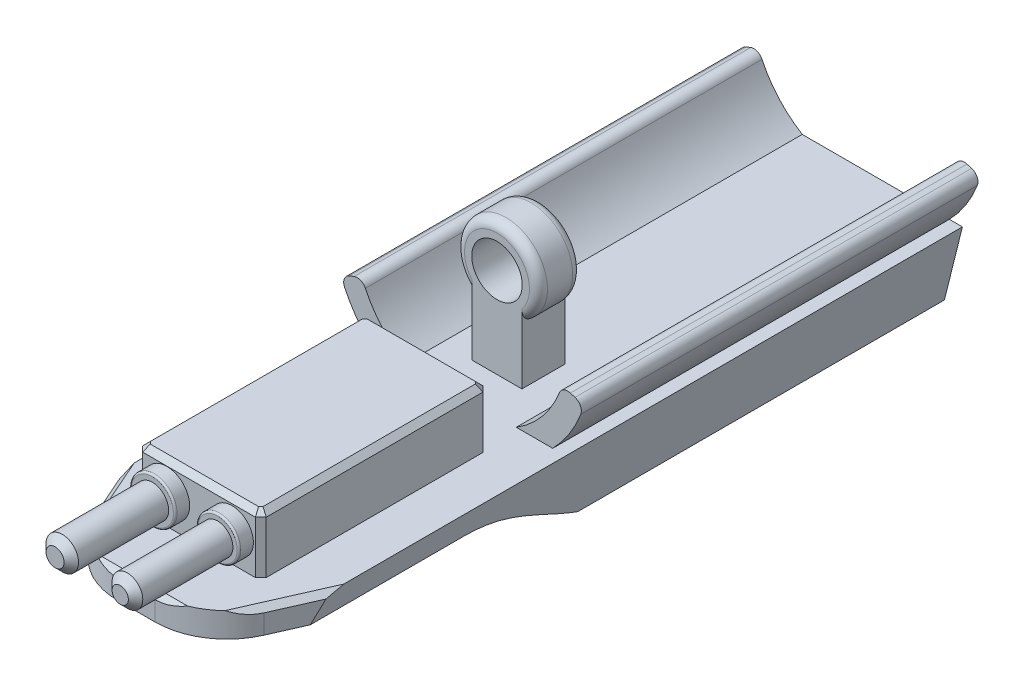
ISO-10303-21;
HEADER;
FILE_DESCRIPTION(('STEP AP214'),'2;1');
FILE_NAME('part.step','',(''),(''),'','','');
FILE_SCHEMA(('AUTOMOTIVE_DESIGN { 1 0 10303 214 1 1 1 1 }'));
ENDSEC;
DATA;
#1=APPLICATION_CONTEXT('core data for automotive mechanical design processes');
#2=APPLICATION_PROTOCOL_DEFINITION('international standard','automotive_design',2000,#1);
#3=PRODUCT_CONTEXT('',#1,'mechanical');
#4=PRODUCT('Part','Part','',(#3));
#5=PRODUCT_RELATED_PRODUCT_CATEGORY('part','',(#4));
#6=PRODUCT_DEFINITION_FORMATION('','',#4);
#7=PRODUCT_DEFINITION_CONTEXT('part definition',#1,'design');
#8=PRODUCT_DEFINITION('design','',#6,#7);
#9=PRODUCT_DEFINITION_SHAPE('','',#8);
#10=(LENGTH_UNIT() NAMED_UNIT(*) SI_UNIT(.MILLI.,.METRE.));
#11=(NAMED_UNIT(*) PLANE_ANGLE_UNIT() SI_UNIT($,.RADIAN.));
#12=(NAMED_UNIT(*) SI_UNIT($,.STERADIAN.) SOLID_ANGLE_UNIT());
#13=UNCERTAINTY_MEASURE_WITH_UNIT(LENGTH_MEASURE(1.E-05),#10,'distance_accuracy_value','');
#14=(GEOMETRIC_REPRESENTATION_CONTEXT(3) GLOBAL_UNCERTAINTY_ASSIGNED_CONTEXT((#13)) GLOBAL_UNIT_ASSIGNED_CONTEXT((#10,
#11,#12)) REPRESENTATION_CONTEXT('',''));
#15=CARTESIAN_POINT('',(0.,0.,0.));
#16=DIRECTION('',(0.,0.,1.));
#17=DIRECTION('',(1.,0.,0.));
#18=AXIS2_PLACEMENT_3D('',#15,#16,#17);
#19=CARTESIAN_POINT('',(0.,-24.9859479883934,0.));
#20=DIRECTION('',(0.,-1.,0.));
#21=DIRECTION('',(0.,0.,-1.));
#22=AXIS2_PLACEMENT_3D('',#19,#20,#21);
#23=PLANE('',#22);
#24=DIRECTION('',(0.,0.,1.));
#25=VECTOR('',#24,1.);
#26=CARTESIAN_POINT('',(-17.506493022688,-24.9859479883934,94.2764883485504));
#27=LINE('',#26,#25);
#28=CARTESIAN_POINT('',(-17.506493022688,-24.9859479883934,32.6640284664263));
#29=VERTEX_POINT('',#28);
#30=CARTESIAN_POINT('',(-17.506493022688,-24.9859479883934,92.7764883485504));
#31=VERTEX_POINT('',#30);
#32=EDGE_CURVE('E590',#29,#31,#27,.T.);
#33=ORIENTED_EDGE('',*,*,#32,.F.);
#34=DIRECTION('',(-0.707106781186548,0.,0.707106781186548));
#35=VECTOR('',#34,1.);
#36=CARTESIAN_POINT('',(7.57876772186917,-24.9859479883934,7.57876772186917));
#37=LINE('',#36,#35);
#38=CARTESIAN_POINT('',(-16.006493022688,-24.9859479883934,31.1640284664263));
#39=VERTEX_POINT('',#38);
#40=EDGE_CURVE('E1151',#29,#39,#37,.F.);
#41=ORIENTED_EDGE('',*,*,#40,.T.);
#42=DIRECTION('',(-1.,0.,0.));
#43=VECTOR('',#42,1.);
#44=CARTESIAN_POINT('',(-17.506493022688,-24.9859479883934,31.1640284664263));
#45=LINE('',#44,#43);
#46=CARTESIAN_POINT('',(15.2664984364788,-24.9859479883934,31.1640284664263));
#47=VERTEX_POINT('',#46);
#48=EDGE_CURVE('E600',#47,#39,#45,.T.);
#49=ORIENTED_EDGE('',*,*,#48,.F.);
#50=DIRECTION('',(-0.707106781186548,0.,-0.707106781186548));
#51=VECTOR('',#50,1.);
#52=CARTESIAN_POINT('',(-7.94876501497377,-24.9859479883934,7.94876501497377));
#53=LINE('',#52,#51);
#54=CARTESIAN_POINT('',(16.7664984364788,-24.9859479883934,32.6640284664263));
#55=VERTEX_POINT('',#54);
#56=EDGE_CURVE('E1153',#47,#55,#53,.F.);
#57=ORIENTED_EDGE('',*,*,#56,.T.);
#58=DIRECTION('',(0.,0.,-1.));
#59=VECTOR('',#58,1.);
#60=CARTESIAN_POINT('',(16.7664984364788,-24.9859479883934,31.1640284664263));
#61=LINE('',#60,#59);
#62=CARTESIAN_POINT('',(16.7664984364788,-24.9859479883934,92.7764883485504));
#63=VERTEX_POINT('',#62);
#64=EDGE_CURVE('E597',#63,#55,#61,.T.);
#65=ORIENTED_EDGE('',*,*,#64,.F.);
#66=DIRECTION('',(0.707106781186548,0.,-0.707106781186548));
#67=VECTOR('',#66,1.);
#68=CARTESIAN_POINT('',(54.7714933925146,-24.9859479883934,54.7714933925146));
#69=LINE('',#68,#67);
#70=CARTESIAN_POINT('',(15.2664984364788,-24.9859479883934,94.2764883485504));
#71=VERTEX_POINT('',#70);
#72=EDGE_CURVE('E1157',#63,#71,#69,.F.);
#73=ORIENTED_EDGE('',*,*,#72,.T.);
#74=DIRECTION('',(1.,0.,0.));
#75=VECTOR('',#74,1.);
#76=CARTESIAN_POINT('',(16.7664984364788,-24.9859479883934,94.2764883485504));
#77=LINE('',#76,#75);
#78=CARTESIAN_POINT('',(-16.006493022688,-24.9859479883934,94.2764883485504));
#79=VERTEX_POINT('',#78);
#80=EDGE_CURVE('E593',#79,#71,#77,.T.);
#81=ORIENTED_EDGE('',*,*,#80,.F.);
#82=DIRECTION('',(0.707106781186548,0.,0.707106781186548));
#83=VECTOR('',#82,1.);
#84=CARTESIAN_POINT('',(-55.1414906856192,-24.9859479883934,55.1414906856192));
#85=LINE('',#84,#83);
#86=EDGE_CURVE('E1155',#79,#31,#85,.F.);
#87=ORIENTED_EDGE('',*,*,#86,.T.);
#88=EDGE_LOOP('',(#33,#41,#49,#57,#65,#73,#81,#87));
#89=FACE_BOUND('',#88,.T.);
#90=DIRECTION('',(1.,0.,0.));
#91=VECTOR('',#90,1.);
#92=CARTESIAN_POINT('',(-6.91987595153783,-24.9859479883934,0.));
#93=LINE('',#92,#91);
#94=CARTESIAN_POINT('',(-6.91987595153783,-24.9859479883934,0.));
#95=VERTEX_POINT('',#94);
#96=CARTESIAN_POINT('',(6.91987595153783,-24.9859479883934,0.));
#97=VERTEX_POINT('',#96);
#98=EDGE_CURVE('E775',#95,#97,#93,.T.);
#99=ORIENTED_EDGE('',*,*,#98,.T.);
#100=DIRECTION('',(0.,0.,-1.));
#101=VECTOR('',#100,1.);
#102=CARTESIAN_POINT('',(6.91987595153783,-24.9859479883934,12.));
#103=LINE('',#102,#101);
#104=CARTESIAN_POINT('',(6.91987595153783,-24.9859479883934,12.));
#105=VERTEX_POINT('',#104);
#106=EDGE_CURVE('E801',#105,#97,#103,.T.);
#107=ORIENTED_EDGE('',*,*,#106,.F.);
#108=DIRECTION('',(1.,0.,0.));
#109=VECTOR('',#108,1.);
#110=CARTESIAN_POINT('',(-6.91987595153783,-24.9859479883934,12.));
#111=LINE('',#110,#109);
#112=CARTESIAN_POINT('',(-6.91987595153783,-24.9859479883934,12.));
#113=VERTEX_POINT('',#112);
#114=EDGE_CURVE('E778',#113,#105,#111,.T.);
#115=ORIENTED_EDGE('',*,*,#114,.F.);
#116=DIRECTION('',(0.,0.,-1.));
#117=VECTOR('',#116,1.);
#118=CARTESIAN_POINT('',(-6.91987595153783,-24.9859479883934,12.));
#119=LINE('',#118,#117);
#120=EDGE_CURVE('E786',#113,#95,#119,.T.);
#121=ORIENTED_EDGE('',*,*,#120,.T.);
#122=EDGE_LOOP('',(#99,#107,#115,#121));
#123=FACE_BOUND('',#122,.T.);
#124=DIRECTION('',(0.,0.,-1.));
#125=VECTOR('',#124,1.);
#126=CARTESIAN_POINT('',(29.0742269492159,-24.9859479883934,122.));
#127=LINE('',#126,#125);
#128=CARTESIAN_POINT('',(29.0742269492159,-24.9859479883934,83.5609065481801));
#129=VERTEX_POINT('',#128);
#130=CARTESIAN_POINT('',(29.0742269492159,-24.9859479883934,-88.));
#131=VERTEX_POINT('',#130);
#132=EDGE_CURVE('E543',#129,#131,#127,.T.);
#133=ORIENTED_EDGE('',*,*,#132,.T.);
#134=DIRECTION('',(1.,0.,0.));
#135=VECTOR('',#134,1.);
#136=CARTESIAN_POINT('',(0.,-24.9859479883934,-88.));
#137=LINE('',#136,#135);
#138=CARTESIAN_POINT('',(25.4457131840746,-24.9859479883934,-88.));
#139=VERTEX_POINT('',#138);
#140=EDGE_CURVE('E764',#139,#131,#137,.T.);
#141=ORIENTED_EDGE('',*,*,#140,.F.);
#142=DIRECTION('',(0.,0.,-1.));
#143=VECTOR('',#142,1.);
#144=CARTESIAN_POINT('',(25.4457131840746,-24.9859479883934,22.));
#145=LINE('',#144,#143);
#146=CARTESIAN_POINT('',(25.4457131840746,-24.9859479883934,22.));
#147=VERTEX_POINT('',#146);
#148=EDGE_CURVE('E741',#147,#139,#145,.T.);
#149=ORIENTED_EDGE('',*,*,#148,.F.);
#150=DIRECTION('',(1.,0.,0.));
#151=VECTOR('',#150,1.);
#152=CARTESIAN_POINT('',(0.,-24.9859479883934,22.));
#153=LINE('',#152,#151);
#154=CARTESIAN_POINT('',(15.342637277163,-24.9859479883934,22.));
#155=VERTEX_POINT('',#154);
#156=EDGE_CURVE('E736',#155,#147,#153,.T.);
#157=ORIENTED_EDGE('',*,*,#156,.F.);
#158=DIRECTION('',(0.,0.,-1.));
#159=VECTOR('',#158,1.);
#160=CARTESIAN_POINT('',(15.342637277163,-24.9859479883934,22.));
#161=LINE('',#160,#159);
#162=CARTESIAN_POINT('',(15.342637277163,-24.9859479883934,-88.));
#163=VERTEX_POINT('',#162);
#164=EDGE_CURVE('E747',#155,#163,#161,.T.);
#165=ORIENTED_EDGE('',*,*,#164,.T.);
#166=CARTESIAN_POINT('',(-15.342637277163,-24.9859479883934,-88.));
#167=VERTEX_POINT('',#166);
#168=EDGE_CURVE('E771',#167,#163,#137,.T.);
#169=ORIENTED_EDGE('',*,*,#168,.F.);
#170=DIRECTION('',(0.,0.,-1.));
#171=VECTOR('',#170,1.);
#172=CARTESIAN_POINT('',(-15.342637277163,-24.9859479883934,22.));
#173=LINE('',#172,#171);
#174=CARTESIAN_POINT('',(-15.342637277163,-24.9859479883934,22.));
#175=VERTEX_POINT('',#174);
#176=EDGE_CURVE('E725',#175,#167,#173,.T.);
#177=ORIENTED_EDGE('',*,*,#176,.F.);
#178=DIRECTION('',(1.,0.,0.));
#179=VECTOR('',#178,1.);
#180=CARTESIAN_POINT('',(0.,-24.9859479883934,22.));
#181=LINE('',#180,#179);
#182=CARTESIAN_POINT('',(-25.4457131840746,-24.9859479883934,22.));
#183=VERTEX_POINT('',#182);
#184=EDGE_CURVE('E704',#183,#175,#181,.T.);
#185=ORIENTED_EDGE('',*,*,#184,.F.);
#186=DIRECTION('',(0.,0.,-1.));
#187=VECTOR('',#186,1.);
#188=CARTESIAN_POINT('',(-25.4457131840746,-24.9859479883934,22.));
#189=LINE('',#188,#187);
#190=CARTESIAN_POINT('',(-25.4457131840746,-24.9859479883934,-88.));
#191=VERTEX_POINT('',#190);
#192=EDGE_CURVE('E717',#183,#191,#189,.T.);
#193=ORIENTED_EDGE('',*,*,#192,.T.);
#194=CARTESIAN_POINT('',(-29.0742269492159,-24.9859479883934,-88.));
#195=VERTEX_POINT('',#194);
#196=EDGE_CURVE('E769',#195,#191,#137,.T.);
#197=ORIENTED_EDGE('',*,*,#196,.F.);
#198=DIRECTION('',(0.,0.,-1.));
#199=VECTOR('',#198,1.);
#200=CARTESIAN_POINT('',(-29.0742269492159,-24.9859479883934,122.));
#201=LINE('',#200,#199);
#202=CARTESIAN_POINT('',(-29.0742269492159,-24.9859479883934,83.5609065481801));
#203=VERTEX_POINT('',#202);
#204=EDGE_CURVE('E1525',#203,#195,#201,.T.);
#205=ORIENTED_EDGE('',*,*,#204,.F.);
#206=DIRECTION('',(0.403695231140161,0.,0.914893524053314));
#207=VECTOR('',#206,1.);
#208=CARTESIAN_POINT('',(-16.7927194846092,-24.9859479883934,111.39445715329));
#209=LINE('',#208,#207);
#210=CARTESIAN_POINT('',(-18.9872708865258,-24.9859479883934,106.42095062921));
#211=VERTEX_POINT('',#210);
#212=EDGE_CURVE('E1368',#203,#211,#209,.T.);
#213=ORIENTED_EDGE('',*,*,#212,.T.);
#214=CARTESIAN_POINT('',(-5.1295588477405,-24.9859479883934,92.));
#215=DIRECTION('',(0.,-1.,0.));
#216=DIRECTION('',(0.,0.,-1.));
#217=AXIS2_PLACEMENT_3D('',#214,#215,#216);
#218=CIRCLE('',#217,20.);
#219=CARTESIAN_POINT('',(-12.7289009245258,-24.9859479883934,110.5));
#220=VERTEX_POINT('',#219);
#221=EDGE_CURVE('E1395',#211,#220,#218,.F.);
#222=ORIENTED_EDGE('',*,*,#221,.T.);
#223=DIRECTION('',(1.,0.,0.));
#224=VECTOR('',#223,1.);
#225=CARTESIAN_POINT('',(18.1650597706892,-24.9859479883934,110.5));
#226=LINE('',#225,#224);
#227=CARTESIAN_POINT('',(12.7289009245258,-24.9859479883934,110.5));
#228=VERTEX_POINT('',#227);
#229=EDGE_CURVE('E1365',#220,#228,#226,.T.);
#230=ORIENTED_EDGE('',*,*,#229,.T.);
#231=CARTESIAN_POINT('',(5.12955884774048,-24.9859479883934,92.));
#232=DIRECTION('',(0.,-1.,0.));
#233=DIRECTION('',(0.,0.,-1.));
#234=AXIS2_PLACEMENT_3D('',#231,#232,#233);
#235=CIRCLE('',#234,20.);
#236=CARTESIAN_POINT('',(18.9872708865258,-24.9859479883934,106.42095062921));
#237=VERTEX_POINT('',#236);
#238=EDGE_CURVE('E1393',#228,#237,#235,.F.);
#239=ORIENTED_EDGE('',*,*,#238,.T.);
#240=DIRECTION('',(0.403695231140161,0.,-0.914893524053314));
#241=VECTOR('',#240,1.);
#242=CARTESIAN_POINT('',(55.1982357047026,-24.9859479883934,24.3561288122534));
#243=LINE('',#242,#241);
#244=EDGE_CURVE('E1328',#237,#129,#243,.T.);
#245=ORIENTED_EDGE('',*,*,#244,.T.);
#246=EDGE_LOOP('',(#133,#141,#149,#157,#165,#169,#177,#185,#193,#197,#205,#213,#222,#230,#239,#245));
#247=FACE_BOUND('',#246,.T.);
#248=ADVANCED_FACE('F36',(#89,#123,#247),#23,.F.);
#249=CARTESIAN_POINT('',(-73.1797224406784,-31.8503508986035,112.));
#250=DIRECTION('',(0.,1.,0.));
#251=DIRECTION('',(0.,0.,1.));
#252=AXIS2_PLACEMENT_3D('',#249,#250,#251);
#253=PLANE('',#252);
#254=DIRECTION('',(0.,0.,-1.));
#255=VECTOR('',#254,1.);
#256=CARTESIAN_POINT('',(27.3652031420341,-31.8503508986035,112.));
#257=LINE('',#256,#255);
#258=CARTESIAN_POINT('',(27.3652031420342,-31.8503508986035,91.1497373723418));
#259=VERTEX_POINT('',#258);
#260=CARTESIAN_POINT('',(27.3652031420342,-31.8503508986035,48.3986713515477));
#261=VERTEX_POINT('',#260);
#262=EDGE_CURVE('E548',#259,#261,#257,.T.);
#263=ORIENTED_EDGE('',*,*,#262,.F.);
#264=DIRECTION('',(-0.403695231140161,0.,0.914893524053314));
#265=VECTOR('',#264,1.);
#266=CARTESIAN_POINT('',(3.27861526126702,-31.8503508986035,145.737113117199));
#267=LINE('',#266,#265);
#268=CARTESIAN_POINT('',(23.4274293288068,-31.8503508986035,100.073904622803));
#269=VERTEX_POINT('',#268);
#270=EDGE_CURVE('E750',#259,#269,#267,.T.);
#271=ORIENTED_EDGE('',*,*,#270,.T.);
#272=CARTESIAN_POINT('',(5.12955884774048,-31.8503508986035,92.));
#273=DIRECTION('',(0.,1.,0.));
#274=DIRECTION('',(0.,0.,1.));
#275=AXIS2_PLACEMENT_3D('',#272,#273,#274);
#276=CIRCLE('',#275,20.);
#277=CARTESIAN_POINT('',(5.12955884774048,-31.8503508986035,112.));
#278=VERTEX_POINT('',#277);
#279=EDGE_CURVE('E1380',#269,#278,#276,.F.);
#280=ORIENTED_EDGE('',*,*,#279,.T.);
#281=DIRECTION('',(1.,0.,0.));
#282=VECTOR('',#281,1.);
#283=CARTESIAN_POINT('',(-73.1797224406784,-31.8503508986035,112.));
#284=LINE('',#283,#282);
#285=CARTESIAN_POINT('',(-5.12955884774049,-31.8503508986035,112.));
#286=VERTEX_POINT('',#285);
#287=EDGE_CURVE('E758',#286,#278,#284,.T.);
#288=ORIENTED_EDGE('',*,*,#287,.F.);
#289=CARTESIAN_POINT('',(-5.1295588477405,-31.8503508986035,92.));
#290=DIRECTION('',(0.,1.,0.));
#291=DIRECTION('',(0.,0.,1.));
#292=AXIS2_PLACEMENT_3D('',#289,#290,#291);
#293=CIRCLE('',#292,20.);
#294=CARTESIAN_POINT('',(-23.4274293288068,-31.8503508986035,100.073904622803));
#295=VERTEX_POINT('',#294);
#296=EDGE_CURVE('E1382',#286,#295,#293,.F.);
#297=ORIENTED_EDGE('',*,*,#296,.T.);
#298=DIRECTION('',(0.403695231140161,0.,0.914893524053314));
#299=VECTOR('',#298,1.);
#300=CARTESIAN_POINT('',(-27.1307905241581,-31.8503508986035,91.6809861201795));
#301=LINE('',#300,#299);
#302=CARTESIAN_POINT('',(-27.3652031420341,-31.8503508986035,91.1497373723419));
#303=VERTEX_POINT('',#302);
#304=EDGE_CURVE('E865',#303,#295,#301,.T.);
#305=ORIENTED_EDGE('',*,*,#304,.F.);
#306=DIRECTION('',(0.,0.,-1.));
#307=VECTOR('',#306,1.);
#308=CARTESIAN_POINT('',(-27.3652031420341,-31.8503508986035,112.));
#309=LINE('',#308,#307);
#310=CARTESIAN_POINT('',(-27.3652031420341,-31.8503508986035,48.3986713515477));
#311=VERTEX_POINT('',#310);
#312=EDGE_CURVE('E588',#303,#311,#309,.T.);
#313=ORIENTED_EDGE('',*,*,#312,.T.);
#314=DIRECTION('',(1.,0.,0.));
#315=VECTOR('',#314,1.);
#316=CARTESIAN_POINT('',(-73.1797224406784,-31.8503508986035,48.3986713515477));
#317=LINE('',#316,#315);
#318=EDGE_CURVE('E753',#311,#261,#317,.T.);
#319=ORIENTED_EDGE('',*,*,#318,.T.);
#320=EDGE_LOOP('',(#263,#271,#280,#288,#297,#305,#313,#319));
#321=FACE_BOUND('',#320,.T.);
#322=ADVANCED_FACE('F1273',(#321),#253,.F.);
#323=CARTESIAN_POINT('',(0.,-46.9859479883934,-88.));
#324=DIRECTION('',(0.,0.,1.));
#325=DIRECTION('',(1.,0.,0.));
#326=AXIS2_PLACEMENT_3D('',#323,#324,#325);
#327=PLANE('',#326);
#328=DIRECTION('',(1.,0.,0.));
#329=VECTOR('',#328,1.);
#330=CARTESIAN_POINT('',(0.,-46.9859479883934,-88.));
#331=LINE('',#330,#329);
#332=CARTESIAN_POINT('',(-21.5969080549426,-46.9859479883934,-88.));
#333=VERTEX_POINT('',#332);
#334=CARTESIAN_POINT('',(-15.7069017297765,-46.9859479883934,-88.));
#335=VERTEX_POINT('',#334);
#336=EDGE_CURVE('E765',#333,#335,#331,.T.);
#337=ORIENTED_EDGE('',*,*,#336,.F.);
#338=DIRECTION('',(-0.707106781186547,0.707106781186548,0.));
#339=VECTOR('',#338,1.);
#340=CARTESIAN_POINT('',(-24.2599141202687,-44.3229419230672,-88.));
#341=LINE('',#340,#339);
#342=CARTESIAN_POINT('',(-24.2599141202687,-44.3229419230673,-88.));
#343=VERTEX_POINT('',#342);
#344=EDGE_CURVE('E45',#333,#343,#341,.T.);
#345=ORIENTED_EDGE('',*,*,#344,.T.);
#346=DIRECTION('',(0.2415939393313,-0.970377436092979,0.));
#347=VECTOR('',#346,1.);
#348=CARTESIAN_POINT('',(-33.234871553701,-8.27445408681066,-88.));
#349=LINE('',#348,#347);
#350=EDGE_CURVE('E557',#195,#343,#349,.T.);
#351=ORIENTED_EDGE('',*,*,#350,.F.);
#352=ORIENTED_EDGE('',*,*,#196,.T.);
#353=CARTESIAN_POINT('',(0.,0.,-88.));
#354=DIRECTION('',(0.,0.,-1.));
#355=DIRECTION('',(-1.,0.,0.));
#356=AXIS2_PLACEMENT_3D('',#353,#354,#355);
#357=CIRCLE('',#356,35.6620514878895);
#358=CARTESIAN_POINT('',(-32.2870812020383,-15.1435234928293,-88.));
#359=VERTEX_POINT('',#358);
#360=EDGE_CURVE('E703',#191,#359,#357,.T.);
#361=ORIENTED_EDGE('',*,*,#360,.T.);
#362=CARTESIAN_POINT('',(-30.023675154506,-14.0819241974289,-88.));
#363=DIRECTION('',(0.,0.,1.));
#364=DIRECTION('',(1.,0.,0.));
#365=AXIS2_PLACEMENT_3D('',#362,#363,#364);
#366=CIRCLE('',#365,2.5);
#367=CARTESIAN_POINT('',(-30.9116212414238,-11.744927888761,-88.));
#368=VERTEX_POINT('',#367);
#369=EDGE_CURVE('E1605',#359,#368,#366,.F.);
#370=ORIENTED_EDGE('',*,*,#369,.T.);
#371=DIRECTION('',(-0.934798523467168,-0.355178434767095,0.));
#372=VECTOR('',#371,1.);
#373=CARTESIAN_POINT('',(0.,0.,-88.));
#374=LINE('',#373,#372);
#375=CARTESIAN_POINT('',(-29.6538487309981,-11.2670348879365,-88.));
#376=VERTEX_POINT('',#375);
#377=EDGE_CURVE('E720',#376,#368,#374,.T.);
#378=ORIENTED_EDGE('',*,*,#377,.F.);
#379=CARTESIAN_POINT('',(-28.7659026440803,-13.6040311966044,-88.));
#380=DIRECTION('',(0.,0.,1.));
#381=DIRECTION('',(1.,0.,0.));
#382=AXIS2_PLACEMENT_3D('',#379,#380,#381);
#383=CIRCLE('',#382,2.5);
#384=CARTESIAN_POINT('',(-26.5058921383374,-12.5352222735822,-88.));
#385=VERTEX_POINT('',#384);
#386=EDGE_CURVE('E1603',#376,#385,#383,.F.);
#387=ORIENTED_EDGE('',*,*,#386,.T.);
#388=CARTESIAN_POINT('',(0.,0.,-88.));
#389=DIRECTION('',(0.,0.,-1.));
#390=DIRECTION('',(-1.,0.,0.));
#391=AXIS2_PLACEMENT_3D('',#388,#389,#390);
#392=CIRCLE('',#391,29.3205408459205);
#393=EDGE_CURVE('E708',#167,#385,#392,.T.);
#394=ORIENTED_EDGE('',*,*,#393,.F.);
#395=ORIENTED_EDGE('',*,*,#168,.T.);
#396=CARTESIAN_POINT('',(0.,0.,-88.));
#397=DIRECTION('',(0.,0.,-1.));
#398=DIRECTION('',(-1.,0.,0.));
#399=AXIS2_PLACEMENT_3D('',#396,#397,#398);
#400=CIRCLE('',#399,29.3205408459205);
#401=CARTESIAN_POINT('',(27.2831518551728,-10.7388891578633,-88.));
#402=VERTEX_POINT('',#401);
#403=EDGE_CURVE('E734',#402,#163,#400,.T.);
#404=ORIENTED_EDGE('',*,*,#403,.F.);
#405=CARTESIAN_POINT('',(29.609434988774,-11.6545347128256,-88.));
#406=DIRECTION('',(0.,0.,1.));
#407=DIRECTION('',(1.,0.,0.));
#408=AXIS2_PLACEMENT_3D('',#405,#406,#407);
#409=CIRCLE('',#408,2.5);
#410=CARTESIAN_POINT('',(30.3394843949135,-9.26350400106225,-88.));
#411=VERTEX_POINT('',#410);
#412=EDGE_CURVE('E1599',#402,#411,#409,.F.);
#413=ORIENTED_EDGE('',*,*,#412,.T.);
#414=DIRECTION('',(-0.956412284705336,0.292019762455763,0.));
#415=VECTOR('',#414,1.);
#416=CARTESIAN_POINT('',(0.,0.,-88.));
#417=LINE('',#416,#415);
#418=CARTESIAN_POINT('',(31.6263382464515,-9.65641693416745,-88.));
#419=VERTEX_POINT('',#418);
#420=EDGE_CURVE('E727',#419,#411,#417,.T.);
#421=ORIENTED_EDGE('',*,*,#420,.F.);
#422=CARTESIAN_POINT('',(30.8962888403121,-12.0474476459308,-88.));
#423=DIRECTION('',(0.,0.,1.));
#424=DIRECTION('',(1.,0.,0.));
#425=AXIS2_PLACEMENT_3D('',#422,#423,#424);
#426=CIRCLE('',#425,2.5);
#427=CARTESIAN_POINT('',(33.2254789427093,-12.955673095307,-88.));
#428=VERTEX_POINT('',#427);
#429=EDGE_CURVE('E1598',#419,#428,#426,.F.);
#430=ORIENTED_EDGE('',*,*,#429,.T.);
#431=CARTESIAN_POINT('',(0.,0.,-88.));
#432=DIRECTION('',(0.,0.,-1.));
#433=DIRECTION('',(-1.,0.,0.));
#434=AXIS2_PLACEMENT_3D('',#431,#432,#433);
#435=CIRCLE('',#434,35.6620514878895);
#436=EDGE_CURVE('E744',#428,#139,#435,.T.);
#437=ORIENTED_EDGE('',*,*,#436,.T.);
#438=ORIENTED_EDGE('',*,*,#140,.T.);
#439=DIRECTION('',(-0.241593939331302,-0.970377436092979,0.));
#440=VECTOR('',#439,1.);
#441=CARTESIAN_POINT('',(33.2348715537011,-8.27445408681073,-88.));
#442=LINE('',#441,#440);
#443=CARTESIAN_POINT('',(24.0800959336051,-45.0451931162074,-88.));
#444=VERTEX_POINT('',#443);
#445=EDGE_CURVE('E538',#131,#444,#442,.T.);
#446=ORIENTED_EDGE('',*,*,#445,.T.);
#447=DIRECTION('',(0.856993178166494,0.51532775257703,0.));
#448=VECTOR('',#447,1.);
#449=CARTESIAN_POINT('',(20.8526088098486,-46.9859479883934,-88.));
#450=LINE('',#449,#448);
#451=CARTESIAN_POINT('',(20.8526088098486,-46.9859479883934,-88.));
#452=VERTEX_POINT('',#451);
#453=EDGE_CURVE('E1534',#444,#452,#450,.F.);
#454=ORIENTED_EDGE('',*,*,#453,.T.);
#455=CARTESIAN_POINT('',(15.7069017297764,-46.9859479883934,-88.));
#456=VERTEX_POINT('',#455);
#457=EDGE_CURVE('E768',#456,#452,#331,.T.);
#458=ORIENTED_EDGE('',*,*,#457,.F.);
#459=DIRECTION('',(0.,1.,0.));
#460=VECTOR('',#459,1.);
#461=CARTESIAN_POINT('',(15.7069017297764,-46.9859479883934,-88.));
#462=LINE('',#461,#460);
#463=CARTESIAN_POINT('',(15.7069017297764,-43.9859479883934,-88.));
#464=VERTEX_POINT('',#463);
#465=EDGE_CURVE('E1089',#456,#464,#462,.T.);
#466=ORIENTED_EDGE('',*,*,#465,.T.);
#467=DIRECTION('',(-1.,0.,0.));
#468=VECTOR('',#467,1.);
#469=CARTESIAN_POINT('',(0.,-43.9859479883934,-88.));
#470=LINE('',#469,#468);
#471=CARTESIAN_POINT('',(-15.7069017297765,-43.9859479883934,-88.));
#472=VERTEX_POINT('',#471);
#473=EDGE_CURVE('E1086',#464,#472,#470,.T.);
#474=ORIENTED_EDGE('',*,*,#473,.T.);
#475=DIRECTION('',(0.,-1.,0.));
#476=VECTOR('',#475,1.);
#477=CARTESIAN_POINT('',(-15.7069017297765,-46.9859479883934,-88.));
#478=LINE('',#477,#476);
#479=EDGE_CURVE('E1092',#472,#335,#478,.T.);
#480=ORIENTED_EDGE('',*,*,#479,.T.);
#481=EDGE_LOOP('',(#337,#345,#351,#352,#361,#370,#378,#387,#394,#395,#404,#413,#421,#430,#437,
#438,#446,#454,#458,#466,#474,#480));
#482=FACE_BOUND('',#481,.T.);
#483=ADVANCED_FACE('F1279',(#482),#327,.F.);
#484=CARTESIAN_POINT('',(-73.1797224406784,-46.9859479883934,8.40553373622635));
#485=CARTESIAN_POINT('',(-73.1797224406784,-42.8466638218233,22.0653812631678));
#486=CARTESIAN_POINT('',(-73.1797224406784,-31.8497862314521,33.3914822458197));
#487=CARTESIAN_POINT('',(-73.1797224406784,-31.8503508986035,48.3986713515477));
#488=B_SPLINE_CURVE_WITH_KNOTS('',3,(#484,#485,#486,#487),.UNSPECIFIED.,.F.,.F.,(4,4),(0.,1.),.UNSPECIFIED.);
#489=DIRECTION('',(1.,0.,0.));
#490=VECTOR('',#489,1.);
#491=SURFACE_OF_LINEAR_EXTRUSION('',#488,#490);
#492=CARTESIAN_POINT('',(11.7467436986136,-46.9859479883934,8.40553373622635));
#493=CARTESIAN_POINT('',(11.7467436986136,-42.8466638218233,22.0653812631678));
#494=CARTESIAN_POINT('',(11.7467436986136,-31.8497862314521,33.3914822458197));
#495=CARTESIAN_POINT('',(11.7467436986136,-31.8503508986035,48.3986713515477));
#496=B_SPLINE_CURVE_WITH_KNOTS('',3,(#492,#493,#494,#495),.UNSPECIFIED.,.F.,.F.,(4,4),(0.,1.),.UNSPECIFIED.);
#497=CARTESIAN_POINT('',(11.7467436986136,-36.805234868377,30.02969305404));
#498=VERTEX_POINT('',#497);
#499=CARTESIAN_POINT('',(11.7467436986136,-41.615702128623,20.7602749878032));
#500=VERTEX_POINT('',#499);
#501=EDGE_CURVE('E1410',#498,#500,#496,.F.);
#502=ORIENTED_EDGE('',*,*,#501,.T.);
#503=CARTESIAN_POINT('',(11.7467436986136,-41.6157021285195,20.760274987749));
#504=CARTESIAN_POINT('',(11.6392610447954,-41.7231847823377,20.5546694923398));
#505=CARTESIAN_POINT('',(11.5320261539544,-41.8304196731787,20.3488038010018));
#506=CARTESIAN_POINT('',(11.3181837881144,-42.0442620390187,19.9364572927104));
#507=CARTESIAN_POINT('',(11.211576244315,-42.1508695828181,19.7299765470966));
#508=CARTESIAN_POINT('',(10.9991062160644,-42.3633396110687,19.3162784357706));
#509=CARTESIAN_POINT('',(10.893243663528,-42.469202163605,19.1090611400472));
#510=CARTESIAN_POINT('',(10.6823844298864,-42.6800613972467,18.6937660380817));
#511=CARTESIAN_POINT('',(10.5773876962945,-42.7850581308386,18.4856882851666));
#512=CARTESIAN_POINT('',(10.3683773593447,-42.9940684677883,18.0685333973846));
#513=CARTESIAN_POINT('',(10.2643637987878,-43.0980820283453,17.8594562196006));
#514=CARTESIAN_POINT('',(10.0574550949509,-43.3049907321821,17.4401891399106));
#515=CARTESIAN_POINT('',(9.95455998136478,-43.4078858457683,17.2299992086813));
#516=CARTESIAN_POINT('',(9.75002052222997,-43.6124253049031,16.8083777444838));
#517=CARTESIAN_POINT('',(9.64837628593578,-43.7140695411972,16.5969461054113));
#518=CARTESIAN_POINT('',(9.44647690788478,-43.9159689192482,16.1727087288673));
#519=CARTESIAN_POINT('',(9.34622200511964,-44.0162238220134,15.9599027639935));
#520=CARTESIAN_POINT('',(9.2467436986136,-44.1157021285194,15.746370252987));
#521=B_SPLINE_CURVE_WITH_KNOTS('',3,(#503,#504,#505,#506,#507,#508,#509,#510,#511,#512,#513,
#514,#515,#516,#517,#518,#519,#520),.UNSPECIFIED.,.F.,.F.,(4,2,2,2,2,2,2,2,4),(0.,
0.76707856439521,1.53407137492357,2.30099315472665,3.06786809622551,3.83477627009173,
4.60170475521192,5.36869975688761,6.13582509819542),.UNSPECIFIED.);
#522=CARTESIAN_POINT('',(9.2467436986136,-44.1157021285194,15.746370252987));
#523=VERTEX_POINT('',#522);
#524=EDGE_CURVE('E1022',#500,#523,#521,.T.);
#525=ORIENTED_EDGE('',*,*,#524,.T.);
#526=DIRECTION('',(1.,0.,0.));
#527=VECTOR('',#526,1.);
#528=CARTESIAN_POINT('',(0.,-44.1157021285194,15.746370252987));
#529=LINE('',#528,#527);
#530=CARTESIAN_POINT('',(-9.24674369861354,-44.1157021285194,15.746370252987));
#531=VERTEX_POINT('',#530);
#532=EDGE_CURVE('E1415',#523,#531,#529,.F.);
#533=ORIENTED_EDGE('',*,*,#532,.T.);
#534=CARTESIAN_POINT('',(-9.24674369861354,-44.1157021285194,15.746370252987));
#535=CARTESIAN_POINT('',(-9.34622200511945,-44.0162238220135,15.9599027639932));
#536=CARTESIAN_POINT('',(-9.44647690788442,-43.9159689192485,16.1727087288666));
#537=CARTESIAN_POINT('',(-9.64837628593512,-43.7140695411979,16.5969461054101));
#538=CARTESIAN_POINT('',(-9.75002052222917,-43.6124253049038,16.8083777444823));
#539=CARTESIAN_POINT('',(-9.95455998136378,-43.4078858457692,17.2299992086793));
#540=CARTESIAN_POINT('',(-10.0574550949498,-43.3049907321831,17.4401891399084));
#541=CARTESIAN_POINT('',(-10.2643637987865,-43.0980820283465,17.8594562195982));
#542=CARTESIAN_POINT('',(-10.3683773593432,-42.9940684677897,18.0685333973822));
#543=CARTESIAN_POINT('',(-10.5773876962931,-42.7850581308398,18.4856882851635));
#544=CARTESIAN_POINT('',(-10.6823844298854,-42.6800613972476,18.6937660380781));
#545=CARTESIAN_POINT('',(-10.8932436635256,-42.4692021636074,19.1090611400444));
#546=CARTESIAN_POINT('',(-10.9991062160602,-42.3633396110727,19.3162784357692));
#547=CARTESIAN_POINT('',(-11.211576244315,-42.150869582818,19.7299765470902));
#548=CARTESIAN_POINT('',(-11.3181837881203,-42.0442620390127,19.9364572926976));
#549=CARTESIAN_POINT('',(-11.5320261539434,-41.8304196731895,20.3488038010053));
#550=CARTESIAN_POINT('',(-11.6392610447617,-41.7231847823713,20.5546694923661));
#551=CARTESIAN_POINT('',(-11.746743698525,-41.615702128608,20.7602749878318));
#552=B_SPLINE_CURVE_WITH_KNOTS('',3,(#534,#535,#536,#537,#538,#539,#540,#541,#542,#543,#544,
#545,#546,#547,#548,#549,#550,#551),.UNSPECIFIED.,.F.,.F.,(4,2,2,2,2,2,2,2,4),(0.,
0.767125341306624,1.53412034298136,2.30104882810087,3.06795700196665,3.83483194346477,
4.60175372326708,5.36874653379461,6.13582509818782),.UNSPECIFIED.);
#553=CARTESIAN_POINT('',(-11.7467436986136,-41.6157021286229,20.7602749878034));
#554=VERTEX_POINT('',#553);
#555=EDGE_CURVE('E1015',#531,#554,#552,.T.);
#556=ORIENTED_EDGE('',*,*,#555,.T.);
#557=CARTESIAN_POINT('',(-11.7467436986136,-46.9859479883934,8.40553373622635));
#558=CARTESIAN_POINT('',(-11.7467436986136,-42.8466638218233,22.0653812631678));
#559=CARTESIAN_POINT('',(-11.7467436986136,-31.8497862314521,33.3914822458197));
#560=CARTESIAN_POINT('',(-11.7467436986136,-31.8503508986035,48.3986713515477));
#561=B_SPLINE_CURVE_WITH_KNOTS('',3,(#557,#558,#559,#560),.UNSPECIFIED.,.F.,.F.,(4,4),(0.,1.),.UNSPECIFIED.);
#562=CARTESIAN_POINT('',(-11.7467436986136,-36.8052348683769,30.0296930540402));
#563=VERTEX_POINT('',#562);
#564=EDGE_CURVE('E1421',#554,#563,#561,.T.);
#565=ORIENTED_EDGE('',*,*,#564,.T.);
#566=CARTESIAN_POINT('',(-11.7467436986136,-36.8052348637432,30.0296930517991));
#567=CARTESIAN_POINT('',(-11.6564792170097,-36.7149703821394,30.2163254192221));
#568=CARTESIAN_POINT('',(-11.5667166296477,-36.6252077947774,30.4034450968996));
#569=CARTESIAN_POINT('',(-11.3883399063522,-36.4468310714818,30.7786542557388));
#570=CARTESIAN_POINT('',(-11.2997252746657,-36.3582164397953,30.9667432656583));
#571=CARTESIAN_POINT('',(-11.1237414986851,-36.1822326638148,31.3439816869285));
#572=CARTESIAN_POINT('',(-11.0363718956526,-36.0948630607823,31.5331306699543));
#573=CARTESIAN_POINT('',(-10.8629792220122,-35.9214703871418,31.9125820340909));
#574=CARTESIAN_POINT('',(-10.7769557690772,-35.8354469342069,32.1028840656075));
#575=CARTESIAN_POINT('',(-10.606359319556,-35.6648504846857,32.4847375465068));
#576=CARTESIAN_POINT('',(-10.5217860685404,-35.5802772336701,32.6762887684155));
#577=CARTESIAN_POINT('',(-10.3541815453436,-35.4126727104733,33.0607765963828));
#578=CARTESIAN_POINT('',(-10.2711505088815,-35.3296416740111,33.253713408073));
#579=CARTESIAN_POINT('',(-10.1067620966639,-35.1652532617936,33.6410304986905));
#580=CARTESIAN_POINT('',(-10.0254048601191,-35.0838960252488,33.8354108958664));
#581=CARTESIAN_POINT('',(-9.8644836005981,-34.9229747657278,34.2257120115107));
#582=CARTESIAN_POINT('',(-9.78491999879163,-34.8434111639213,34.4216330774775));
#583=CARTESIAN_POINT('',(-9.62770954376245,-34.6862007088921,34.8151164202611));
#584=CARTESIAN_POINT('',(-9.55006350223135,-34.608554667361,35.0126793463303));
#585=CARTESIAN_POINT('',(-9.39681813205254,-34.4553092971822,35.4095496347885));
#586=CARTESIAN_POINT('',(-9.32122014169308,-34.3797113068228,35.6088580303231));
#587=CARTESIAN_POINT('',(-9.2467436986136,-34.3052348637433,35.8090049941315));
#588=B_SPLINE_CURVE_WITH_KNOTS('',3,(#566,#567,#568,#569,#570,#571,#572,#573,#574,#575,#576,
#577,#578,#579,#580,#581,#582,#583,#584,#585,#586,#587),.UNSPECIFIED.,.F.,.F.,(4,2,2,2,2,2,2,2,
2,2,4),(0.,0.678338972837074,1.35637451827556,2.03415341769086,2.7117361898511,3.38919884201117,
4.06676420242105,4.74438569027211,5.42216466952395,6.10022579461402,6.77871980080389),.UNSPECIFIED.);
#589=CARTESIAN_POINT('',(-9.2467436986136,-34.3052348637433,35.8090049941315));
#590=VERTEX_POINT('',#589);
#591=EDGE_CURVE('E1457',#563,#590,#588,.T.);
#592=ORIENTED_EDGE('',*,*,#591,.T.);
#593=DIRECTION('',(1.,0.,0.));
#594=VECTOR('',#593,1.);
#595=CARTESIAN_POINT('',(0.,-34.3052348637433,35.8090049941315));
#596=LINE('',#595,#594);
#597=CARTESIAN_POINT('',(9.24674369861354,-34.3052348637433,35.8090049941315));
#598=VERTEX_POINT('',#597);
#599=EDGE_CURVE('E1407',#590,#598,#596,.T.);
#600=ORIENTED_EDGE('',*,*,#599,.T.);
#601=CARTESIAN_POINT('',(9.24674369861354,-34.3052348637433,35.8090049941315));
#602=CARTESIAN_POINT('',(9.32122014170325,-34.379711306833,35.6088580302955));
#603=CARTESIAN_POINT('',(9.3968181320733,-34.4553092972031,35.4095496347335));
#604=CARTESIAN_POINT('',(9.5500635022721,-34.6085546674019,35.0126793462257));
#605=CARTESIAN_POINT('',(9.62770954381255,-34.6862007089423,34.8151164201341));
#606=CARTESIAN_POINT('',(9.78491999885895,-34.8434111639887,34.4216330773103));
#607=CARTESIAN_POINT('',(9.86448360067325,-34.922974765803,34.2257120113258));
#608=CARTESIAN_POINT('',(10.0254048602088,-35.0838960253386,33.8354108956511));
#609=CARTESIAN_POINT('',(10.1067620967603,-35.1652532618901,33.6410304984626));
#610=CARTESIAN_POINT('',(10.2711505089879,-35.3296416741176,33.2537134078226));
#611=CARTESIAN_POINT('',(10.3541815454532,-35.412672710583,33.0607765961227));
#612=CARTESIAN_POINT('',(10.5217860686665,-35.5802772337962,32.6762887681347));
#613=CARTESIAN_POINT('',(10.6063593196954,-35.6648504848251,32.4847375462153));
#614=CARTESIAN_POINT('',(10.7769557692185,-35.8354469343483,32.1028840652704));
#615=CARTESIAN_POINT('',(10.8629792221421,-35.9214703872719,31.9125820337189));
#616=CARTESIAN_POINT('',(11.0363718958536,-36.0948630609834,31.5331306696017));
#617=CARTESIAN_POINT('',(11.1237414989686,-36.1822326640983,31.3439816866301));
#618=CARTESIAN_POINT('',(11.2997252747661,-36.3582164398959,30.9667432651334));
#619=CARTESIAN_POINT('',(11.3883399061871,-36.4468310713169,30.7786542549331));
#620=CARTESIAN_POINT('',(11.5667166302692,-36.625207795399,30.4034450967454));
#621=CARTESIAN_POINT('',(11.6564792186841,-36.7149703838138,30.216325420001));
#622=CARTESIAN_POINT('',(11.7467437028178,-36.8052348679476,30.0296930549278));
#623=B_SPLINE_CURVE_WITH_KNOTS('',3,(#601,#602,#603,#604,#605,#606,#607,#608,#609,#610,#611,
#612,#613,#614,#615,#616,#617,#618,#619,#620,#621,#622),.UNSPECIFIED.,.F.,.F.,(4,2,2,2,2,2,2,2,
2,2,4),(0.,0.678494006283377,1.35655513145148,2.03433411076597,2.7119555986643,3.38952095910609,
4.06698361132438,4.74456638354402,5.42234528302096,6.10038082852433,6.77871980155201),.UNSPECIFIED.);
#624=EDGE_CURVE('E1462',#598,#498,#623,.T.);
#625=ORIENTED_EDGE('',*,*,#624,.T.);
#626=EDGE_LOOP('',(#502,#525,#533,#556,#565,#592,#600,#625));
#627=FACE_BOUND('',#626,.T.);
#628=CARTESIAN_POINT('',(-27.3652031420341,-31.8503508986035,48.3986713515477));
#629=CARTESIAN_POINT('',(-27.3652062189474,-31.8503385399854,48.1429721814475));
#630=CARTESIAN_POINT('',(-27.364412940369,-31.853524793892,47.8872847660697));
#631=CARTESIAN_POINT('',(-27.3612445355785,-31.8662508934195,47.3760832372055));
#632=CARTESIAN_POINT('',(-27.358869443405,-31.875790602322,47.1205691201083));
#633=CARTESIAN_POINT('',(-27.3493896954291,-31.9138666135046,46.3546569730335));
#634=CARTESIAN_POINT('',(-27.3399305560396,-31.9518598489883,45.8447266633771));
#635=CARTESIAN_POINT('',(-27.3149473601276,-32.052206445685,44.8289189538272));
#636=CARTESIAN_POINT('',(-27.2994405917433,-32.1144903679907,44.3230341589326));
#637=CARTESIAN_POINT('',(-27.2626270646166,-32.2623542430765,43.3148788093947));
#638=CARTESIAN_POINT('',(-27.2413200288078,-32.3479353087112,42.8126084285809));
#639=CARTESIAN_POINT('',(-27.1937637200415,-32.538948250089,41.8233586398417));
#640=CARTESIAN_POINT('',(-27.1676307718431,-32.6439129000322,41.3362828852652));
#641=CARTESIAN_POINT('',(-27.1105038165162,-32.8733669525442,40.3670007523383));
#642=CARTESIAN_POINT('',(-27.0795092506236,-32.9978585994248,39.8847949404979));
#643=CARTESIAN_POINT('',(-27.0130471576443,-33.2648078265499,38.9254364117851));
#644=CARTESIAN_POINT('',(-26.9775772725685,-33.4072748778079,38.4482865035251));
#645=CARTESIAN_POINT('',(-26.9025992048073,-33.708429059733,37.499435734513));
#646=CARTESIAN_POINT('',(-26.8630906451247,-33.8671177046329,37.0277353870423));
#647=CARTESIAN_POINT('',(-26.7400671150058,-34.3612495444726,35.6311998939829));
#648=CARTESIAN_POINT('',(-26.651295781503,-34.7178052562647,34.7142683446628));
#649=CARTESIAN_POINT('',(-26.4629538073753,-35.4742927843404,32.9001590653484));
#650=CARTESIAN_POINT('',(-26.3633852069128,-35.8742164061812,32.0029776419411));
#651=CARTESIAN_POINT('',(-26.1555630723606,-36.7089472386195,30.216257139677));
#652=CARTESIAN_POINT('',(-26.047239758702,-37.1440347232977,29.3268584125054));
#653=CARTESIAN_POINT('',(-25.8255644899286,-38.034407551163,27.5587141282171));
#654=CARTESIAN_POINT('',(-25.7122113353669,-38.4896977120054,26.6799711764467));
#655=CARTESIAN_POINT('',(-25.4116126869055,-39.6970713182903,24.3799628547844));
#656=CARTESIAN_POINT('',(-25.2224745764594,-40.4567565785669,22.9629743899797));
#657=CARTESIAN_POINT('',(-24.9426451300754,-41.5807093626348,20.8295400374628));
#658=CARTESIAN_POINT('',(-24.8500550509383,-41.9526033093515,20.1173868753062));
#659=CARTESIAN_POINT('',(-24.6675534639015,-42.6856325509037,18.6871257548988));
#660=CARTESIAN_POINT('',(-24.5776421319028,-43.0467671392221,17.9690174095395));
#661=CARTESIAN_POINT('',(-24.4031866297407,-43.7474787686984,16.5338247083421));
#662=CARTESIAN_POINT('',(-24.3185862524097,-44.0872815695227,15.8168582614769));
#663=CARTESIAN_POINT('',(-24.1549961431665,-44.7443516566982,14.3722010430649));
#664=CARTESIAN_POINT('',(-24.0760049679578,-45.0616247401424,13.6445130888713));
#665=CARTESIAN_POINT('',(-23.9249416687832,-45.6683800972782,12.1734866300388));
#666=CARTESIAN_POINT('',(-23.8528972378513,-45.9577511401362,11.4300988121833));
#667=CARTESIAN_POINT('',(-23.7177399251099,-46.5006190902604,9.92878162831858));
#668=CARTESIAN_POINT('',(-23.6546357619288,-46.7540809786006,9.17083887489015));
#669=CARTESIAN_POINT('',(-23.5969080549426,-46.9859479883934,8.40553373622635));
#670=B_SPLINE_CURVE_WITH_KNOTS('',3,(#628,#629,#630,#631,#632,#633,#634,#635,#636,#637,#638,
#639,#640,#641,#642,#643,#644,#645,#646,#647,#648,#649,#650,#651,#652,#653,#654,#655,#656,#657,
#658,#659,#660,#661,#662,#663,#664,#665,#666,#667,#668,#669),.UNSPECIFIED.,.F.,.F.,(4,2,2,2,2,2,
2,2,2,2,2,2,2,2,2,2,2,2,2,2,4),(0.,0.76705306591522,1.53408962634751,3.06767587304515,
4.59690987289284,6.12621693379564,7.62258712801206,9.11912943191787,10.6164635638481,
12.1139375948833,15.075608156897,18.0367200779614,21.024344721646,24.0126856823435,
28.86924733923,31.2953818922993,33.7216754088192,36.1151008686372,38.5079082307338,
40.9098909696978,43.3142002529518),.UNSPECIFIED.);
#671=CARTESIAN_POINT('',(-24.2599141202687,-44.3229419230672,15.2979355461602));
#672=VERTEX_POINT('',#671);
#673=EDGE_CURVE('E580',#311,#672,#670,.T.);
#674=ORIENTED_EDGE('',*,*,#673,.T.);
#675=CARTESIAN_POINT('',(-24.2599141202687,-44.3229419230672,15.2979355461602));
#676=CARTESIAN_POINT('',(-24.1589479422,-44.423908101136,15.0776531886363));
#677=CARTESIAN_POINT('',(-24.0588576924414,-44.5239983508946,14.8565633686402));
#678=CARTESIAN_POINT('',(-23.8607109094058,-44.7221451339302,14.4128696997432));
#679=CARTESIAN_POINT('',(-23.7626524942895,-44.8202035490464,14.1902675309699));
#680=CARTESIAN_POINT('',(-23.5687340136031,-45.0141220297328,13.7434060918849));
#681=CARTESIAN_POINT('',(-23.4728722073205,-45.1099838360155,13.5191483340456));
#682=CARTESIAN_POINT('',(-23.2835200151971,-45.2993360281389,13.0688286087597));
#683=CARTESIAN_POINT('',(-23.190028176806,-45.39282786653,12.8427678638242));
#684=CARTESIAN_POINT('',(-23.0055949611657,-45.5772610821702,12.3886890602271));
#685=CARTESIAN_POINT('',(-22.914652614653,-45.6682034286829,12.1606717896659));
#686=CARTESIAN_POINT('',(-22.7354677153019,-45.8473883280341,11.7024252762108));
#687=CARTESIAN_POINT('',(-22.6472260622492,-45.9356299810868,11.4721953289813));
#688=CARTESIAN_POINT('',(-22.4736853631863,-46.1091706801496,11.0094724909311));
#689=CARTESIAN_POINT('',(-22.3883868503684,-46.1944691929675,10.7769791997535));
#690=CARTESIAN_POINT('',(-22.2209448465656,-46.3619111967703,10.309581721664));
#691=CARTESIAN_POINT('',(-22.1388029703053,-46.4440530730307,10.0746763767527));
#692=CARTESIAN_POINT('',(-21.9778949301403,-46.6049611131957,9.60229911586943));
#693=CARTESIAN_POINT('',(-21.8991318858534,-46.6837241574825,9.36482507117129));
#694=CARTESIAN_POINT('',(-21.7452140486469,-46.8376419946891,8.88715327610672));
#695=CARTESIAN_POINT('',(-21.6700644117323,-46.9127916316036,8.64695220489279));
#696=CARTESIAN_POINT('',(-21.5969080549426,-46.9859479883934,8.40553373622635));
#697=B_SPLINE_CURVE_WITH_KNOTS('',3,(#675,#676,#677,#678,#679,#680,#681,#682,#683,#684,#685,
#686,#687,#688,#689,#690,#691,#692,#693,#694,#695,#696),.UNSPECIFIED.,.F.,.F.,(4,2,2,2,2,2,2,2,
2,2,4),(0.,0.787538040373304,1.57431075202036,2.36043676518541,3.14606870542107,3.9313977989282,
4.71698575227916,5.50271528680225,6.28884153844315,7.07567863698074,7.86360704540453),.UNSPECIFIED.);
#698=CARTESIAN_POINT('',(-21.5969080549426,-46.9859479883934,8.40553373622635));
#699=VERTEX_POINT('',#698);
#700=EDGE_CURVE('E886',#672,#699,#697,.T.);
#701=ORIENTED_EDGE('',*,*,#700,.T.);
#702=DIRECTION('',(1.,0.,0.));
#703=VECTOR('',#702,1.);
#704=CARTESIAN_POINT('',(-73.1797224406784,-46.9859479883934,8.40553373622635));
#705=LINE('',#704,#703);
#706=CARTESIAN_POINT('',(20.8526088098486,-46.9859479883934,8.40553373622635));
#707=VERTEX_POINT('',#706);
#708=EDGE_CURVE('E862',#699,#707,#705,.T.);
#709=ORIENTED_EDGE('',*,*,#708,.T.);
#710=CARTESIAN_POINT('',(20.8526088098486,-46.9859479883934,8.40553373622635));
#711=CARTESIAN_POINT('',(20.9466038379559,-46.9294268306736,8.59205268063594));
#712=CARTESIAN_POINT('',(21.042336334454,-46.8718608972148,8.77737232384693));
#713=CARTESIAN_POINT('',(21.236922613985,-46.7548521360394,9.14545473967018));
#714=CARTESIAN_POINT('',(21.3357724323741,-46.6954116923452,9.32822036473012));
#715=CARTESIAN_POINT('',(21.5363901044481,-46.5747761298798,9.69134640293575));
#716=CARTESIAN_POINT('',(21.6381555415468,-46.5135824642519,9.87170863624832));
#717=CARTESIAN_POINT('',(21.8444187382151,-46.3895521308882,10.2301716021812));
#718=CARTESIAN_POINT('',(21.9489152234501,-46.3267162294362,10.4082733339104));
#719=CARTESIAN_POINT('',(22.1604658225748,-46.1995064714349,10.7623491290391));
#720=CARTESIAN_POINT('',(22.2675194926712,-46.1351328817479,10.9383235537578));
#721=CARTESIAN_POINT('',(22.4839856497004,-46.0049672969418,11.2882134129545));
#722=CARTESIAN_POINT('',(22.5933975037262,-45.9391756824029,11.4621293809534));
#723=CARTESIAN_POINT('',(22.8144699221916,-45.8062402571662,11.8080942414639));
#724=CARTESIAN_POINT('',(22.9261312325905,-45.7390959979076,11.9801424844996));
#725=CARTESIAN_POINT('',(23.1515667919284,-45.6035369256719,12.3224955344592));
#726=CARTESIAN_POINT('',(23.2653421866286,-45.5351214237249,12.4927993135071));
#727=CARTESIAN_POINT('',(23.4948774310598,-45.3970971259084,12.831779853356));
#728=CARTESIAN_POINT('',(23.610638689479,-45.3274874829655,13.0004553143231));
#729=CARTESIAN_POINT('',(23.8440268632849,-45.1871463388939,13.3362890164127));
#730=CARTESIAN_POINT('',(23.9616553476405,-45.1164138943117,13.5034457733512));
#731=CARTESIAN_POINT('',(24.0800959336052,-45.0451931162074,13.6698121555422));
#732=B_SPLINE_CURVE_WITH_KNOTS('',3,(#710,#711,#712,#713,#714,#715,#716,#717,#718,#719,#720,
#721,#722,#723,#724,#725,#726,#727,#728,#729,#730,#731),.UNSPECIFIED.,.F.,.F.,(4,2,2,2,2,2,2,2,
2,2,4),(0.,0.649109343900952,1.29742402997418,1.94521608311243,2.59271108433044,
3.24009451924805,3.88730631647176,4.53473639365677,5.18252822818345,5.83080031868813,
6.47964946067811),.UNSPECIFIED.);
#733=CARTESIAN_POINT('',(24.0800959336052,-45.0451931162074,13.6698121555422));
#734=VERTEX_POINT('',#733);
#735=EDGE_CURVE('E881',#707,#734,#732,.T.);
#736=ORIENTED_EDGE('',*,*,#735,.T.);
#737=CARTESIAN_POINT('',(27.3652031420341,-31.8503508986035,48.3986713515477));
#738=CARTESIAN_POINT('',(27.3652062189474,-31.8503385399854,48.1429721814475));
#739=CARTESIAN_POINT('',(27.3644129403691,-31.853524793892,47.8872847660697));
#740=CARTESIAN_POINT('',(27.3612445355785,-31.8662508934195,47.3760832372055));
#741=CARTESIAN_POINT('',(27.358869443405,-31.875790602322,47.1205691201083));
#742=CARTESIAN_POINT('',(27.3493896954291,-31.9138666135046,46.3546569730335));
#743=CARTESIAN_POINT('',(27.3399305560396,-31.9518598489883,45.8447266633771));
#744=CARTESIAN_POINT('',(27.3149473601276,-32.052206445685,44.8289189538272));
#745=CARTESIAN_POINT('',(27.2994405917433,-32.1144903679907,44.3230341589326));
#746=CARTESIAN_POINT('',(27.2626270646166,-32.2623542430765,43.3148788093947));
#747=CARTESIAN_POINT('',(27.2413200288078,-32.3479353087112,42.8126084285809));
#748=CARTESIAN_POINT('',(27.1937637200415,-32.538948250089,41.8233586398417));
#749=CARTESIAN_POINT('',(27.1676307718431,-32.6439129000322,41.3362828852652));
#750=CARTESIAN_POINT('',(27.1105038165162,-32.8733669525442,40.3670007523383));
#751=CARTESIAN_POINT('',(27.0795092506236,-32.9978585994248,39.8847949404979));
#752=CARTESIAN_POINT('',(27.0130471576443,-33.2648078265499,38.9254364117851));
#753=CARTESIAN_POINT('',(26.9775772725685,-33.4072748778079,38.4482865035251));
#754=CARTESIAN_POINT('',(26.9025992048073,-33.708429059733,37.499435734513));
#755=CARTESIAN_POINT('',(26.8630906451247,-33.8671177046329,37.0277353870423));
#756=CARTESIAN_POINT('',(26.7400671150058,-34.3612495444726,35.6311998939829));
#757=CARTESIAN_POINT('',(26.651295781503,-34.7178052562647,34.7142683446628));
#758=CARTESIAN_POINT('',(26.4629538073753,-35.4742927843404,32.9001590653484));
#759=CARTESIAN_POINT('',(26.3633852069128,-35.8742164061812,32.0029776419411));
#760=CARTESIAN_POINT('',(26.1555630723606,-36.7089472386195,30.216257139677));
#761=CARTESIAN_POINT('',(26.047239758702,-37.1440347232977,29.3268584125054));
#762=CARTESIAN_POINT('',(25.8255644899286,-38.034407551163,27.5587141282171));
#763=CARTESIAN_POINT('',(25.7122113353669,-38.4896977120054,26.6799711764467));
#764=CARTESIAN_POINT('',(25.4116126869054,-39.6970713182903,24.3799628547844));
#765=CARTESIAN_POINT('',(25.2224745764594,-40.4567565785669,22.9629743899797));
#766=CARTESIAN_POINT('',(24.9426451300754,-41.5807093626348,20.8295400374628));
#767=CARTESIAN_POINT('',(24.8500550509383,-41.9526033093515,20.1173868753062));
#768=CARTESIAN_POINT('',(24.6675534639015,-42.6856325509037,18.6871257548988));
#769=CARTESIAN_POINT('',(24.5776421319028,-43.0467671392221,17.9690174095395));
#770=CARTESIAN_POINT('',(24.4031866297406,-43.7474787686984,16.5338247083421));
#771=CARTESIAN_POINT('',(24.3185862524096,-44.0872815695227,15.8168582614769));
#772=CARTESIAN_POINT('',(24.1549961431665,-44.7443516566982,14.3722010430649));
#773=CARTESIAN_POINT('',(24.0760049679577,-45.0616247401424,13.6445130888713));
#774=CARTESIAN_POINT('',(23.9249416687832,-45.6683800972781,12.1734866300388));
#775=CARTESIAN_POINT('',(23.8528972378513,-45.9577511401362,11.4300988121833));
#776=CARTESIAN_POINT('',(23.7177399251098,-46.5006190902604,9.92878162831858));
#777=CARTESIAN_POINT('',(23.6546357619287,-46.7540809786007,9.17083887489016));
#778=CARTESIAN_POINT('',(23.5969080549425,-46.9859479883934,8.40553373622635));
#779=B_SPLINE_CURVE_WITH_KNOTS('',3,(#737,#738,#739,#740,#741,#742,#743,#744,#745,#746,#747,
#748,#749,#750,#751,#752,#753,#754,#755,#756,#757,#758,#759,#760,#761,#762,#763,#764,#765,#766,
#767,#768,#769,#770,#771,#772,#773,#774,#775,#776,#777,#778),.UNSPECIFIED.,.F.,.F.,(4,2,2,2,2,2,
2,2,2,2,2,2,2,2,2,2,2,2,2,2,4),(0.,0.76705306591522,1.53408962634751,3.06767587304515,
4.59690987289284,6.12621693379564,7.62258712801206,9.11912943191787,10.6164635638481,
12.1139375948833,15.075608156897,18.0367200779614,21.024344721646,24.0126856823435,
28.86924733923,31.2953818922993,33.7216754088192,36.1151008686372,38.5079082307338,
40.9098909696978,43.3142002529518),.UNSPECIFIED.);
#780=EDGE_CURVE('E550',#261,#734,#779,.T.);
#781=ORIENTED_EDGE('',*,*,#780,.F.);
#782=ORIENTED_EDGE('',*,*,#318,.F.);
#783=EDGE_LOOP('',(#674,#701,#709,#736,#781,#782));
#784=FACE_BOUND('',#783,.T.);
#785=ADVANCED_FACE('F559',(#627,#784),#491,.F.);
#786=CARTESIAN_POINT('',(56.5705759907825,172.014052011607,24.9616716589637));
#787=DIRECTION('',(-0.914893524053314,0.,-0.403695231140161));
#788=DIRECTION('',(-0.403695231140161,0.,0.914893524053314));
#789=AXIS2_PLACEMENT_3D('',#786,#787,#788);
#790=PLANE('',#789);
#791=DIRECTION('',(-0.211909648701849,-0.851148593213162,0.480250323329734));
#792=VECTOR('',#791,1.);
#793=CARTESIAN_POINT('',(72.1829580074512,148.163014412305,-10.4206318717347));
#794=LINE('',#793,#792);
#795=CARTESIAN_POINT('',(28.7007733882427,-26.4859479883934,88.1229377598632));
#796=VERTEX_POINT('',#795);
#797=EDGE_CURVE('E546',#796,#259,#794,.T.);
#798=ORIENTED_EDGE('',*,*,#797,.F.);
#799=DIRECTION('',(-0.403695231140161,0.,0.914893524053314));
#800=VECTOR('',#799,1.);
#801=CARTESIAN_POINT('',(56.5705759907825,-26.4859479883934,24.9616716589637));
#802=LINE('',#801,#800);
#803=CARTESIAN_POINT('',(23.4274293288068,-26.4859479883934,100.073904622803));
#804=VERTEX_POINT('',#803);
#805=EDGE_CURVE('E1376',#796,#804,#802,.T.);
#806=ORIENTED_EDGE('',*,*,#805,.T.);
#807=DIRECTION('',(0.,-1.,0.));
#808=VECTOR('',#807,1.);
#809=CARTESIAN_POINT('',(23.4274293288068,-31.8503508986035,100.073904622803));
#810=LINE('',#809,#808);
#811=EDGE_CURVE('E1401',#804,#269,#810,.T.);
#812=ORIENTED_EDGE('',*,*,#811,.T.);
#813=ORIENTED_EDGE('',*,*,#270,.F.);
#814=EDGE_LOOP('',(#798,#806,#812,#813));
#815=FACE_BOUND('',#814,.T.);
#816=ADVANCED_FACE('F1514',(#815),#790,.F.);
#817=CARTESIAN_POINT('',(55.1982357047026,-24.9859479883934,24.3561288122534));
#818=DIRECTION('',(-0.646927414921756,-0.707106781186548,-0.285455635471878));
#819=DIRECTION('',(0.403695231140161,0.,-0.914893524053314));
#820=AXIS2_PLACEMENT_3D('',#817,#818,#819);
#821=PLANE('',#820);
#822=ORIENTED_EDGE('',*,*,#805,.F.);
#823=DIRECTION('',(-0.0775314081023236,-0.311409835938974,0.947107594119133));
#824=VECTOR('',#823,1.);
#825=CARTESIAN_POINT('',(33.5787029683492,-6.893433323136,28.5351621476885));
#826=LINE('',#825,#824);
#827=EDGE_CURVE('E875',#796,#129,#826,.F.);
#828=ORIENTED_EDGE('',*,*,#827,.T.);
#829=ORIENTED_EDGE('',*,*,#244,.F.);
#830=CARTESIAN_POINT('',(5.12955884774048,-6.48594798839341,92.));
#831=DIRECTION('',(-0.646927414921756,-0.707106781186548,-0.285455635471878));
#832=DIRECTION('',(-0.646927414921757,0.707106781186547,-0.285455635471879));
#833=AXIS2_PLACEMENT_3D('',#830,#831,#832);
#834=ELLIPSE('',#833,28.2842712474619,20.);
#835=EDGE_CURVE('E1404',#237,#804,#834,.F.);
#836=ORIENTED_EDGE('',*,*,#835,.T.);
#837=EDGE_LOOP('',(#822,#828,#829,#836));
#838=FACE_BOUND('',#837,.T.);
#839=ADVANCED_FACE('F1645',(#838),#821,.F.);
#840=CARTESIAN_POINT('',(0.,-46.9859479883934,0.));
#841=DIRECTION('',(0.,-1.,0.));
#842=DIRECTION('',(0.,0.,-1.));
#843=AXIS2_PLACEMENT_3D('',#840,#841,#842);
#844=PLANE('',#843);
#845=ORIENTED_EDGE('',*,*,#708,.F.);
#846=DIRECTION('',(0.,0.,-1.));
#847=VECTOR('',#846,1.);
#848=CARTESIAN_POINT('',(-21.5969080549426,-46.9859479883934,-88.));
#849=LINE('',#848,#847);
#850=EDGE_CURVE('E1532',#699,#333,#849,.T.);
#851=ORIENTED_EDGE('',*,*,#850,.T.);
#852=ORIENTED_EDGE('',*,*,#336,.T.);
#853=DIRECTION('',(0.,0.,-1.));
#854=VECTOR('',#853,1.);
#855=CARTESIAN_POINT('',(-15.7069017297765,-46.9859479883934,-95.7975641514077));
#856=LINE('',#855,#854);
#857=CARTESIAN_POINT('',(-15.7069017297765,-46.9859479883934,-82.7024358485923));
#858=VERTEX_POINT('',#857);
#859=EDGE_CURVE('E603',#858,#335,#856,.T.);
#860=ORIENTED_EDGE('',*,*,#859,.F.);
#861=CARTESIAN_POINT('',(-13.2069017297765,-46.9859479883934,-82.7024358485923));
#862=DIRECTION('',(0.,-1.,0.));
#863=DIRECTION('',(0.,0.,1.));
#864=AXIS2_PLACEMENT_3D('',#861,#862,#863);
#865=CIRCLE('',#864,2.5);
#866=CARTESIAN_POINT('',(-13.2069017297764,-46.9859479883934,-80.2024358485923));
#867=VERTEX_POINT('',#866);
#868=EDGE_CURVE('E607',#867,#858,#865,.T.);
#869=ORIENTED_EDGE('',*,*,#868,.F.);
#870=DIRECTION('',(-1.,0.,0.));
#871=VECTOR('',#870,1.);
#872=CARTESIAN_POINT('',(-13.2069017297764,-46.9859479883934,-80.2024358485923));
#873=LINE('',#872,#871);
#874=CARTESIAN_POINT('',(13.2069017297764,-46.9859479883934,-80.2024358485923));
#875=VERTEX_POINT('',#874);
#876=EDGE_CURVE('E626',#875,#867,#873,.T.);
#877=ORIENTED_EDGE('',*,*,#876,.F.);
#878=CARTESIAN_POINT('',(13.2069017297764,-46.9859479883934,-82.7024358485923));
#879=DIRECTION('',(0.,-1.,0.));
#880=DIRECTION('',(0.,0.,-1.));
#881=AXIS2_PLACEMENT_3D('',#878,#879,#880);
#882=CIRCLE('',#881,2.5);
#883=CARTESIAN_POINT('',(15.7069017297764,-46.9859479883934,-82.7024358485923));
#884=VERTEX_POINT('',#883);
#885=EDGE_CURVE('E623',#884,#875,#882,.T.);
#886=ORIENTED_EDGE('',*,*,#885,.F.);
#887=DIRECTION('',(0.,0.,1.));
#888=VECTOR('',#887,1.);
#889=CARTESIAN_POINT('',(15.7069017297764,-46.9859479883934,-95.7975641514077));
#890=LINE('',#889,#888);
#891=EDGE_CURVE('E621',#456,#884,#890,.T.);
#892=ORIENTED_EDGE('',*,*,#891,.F.);
#893=ORIENTED_EDGE('',*,*,#457,.T.);
#894=DIRECTION('',(0.,0.,1.));
#895=VECTOR('',#894,1.);
#896=CARTESIAN_POINT('',(20.8526088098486,-46.9859479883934,0.));
#897=LINE('',#896,#895);
#898=EDGE_CURVE('E891',#452,#707,#897,.T.);
#899=ORIENTED_EDGE('',*,*,#898,.T.);
#900=EDGE_LOOP('',(#845,#851,#852,#860,#869,#877,#886,#892,#893,#899));
#901=FACE_BOUND('',#900,.T.);
#902=CARTESIAN_POINT('',(-10.6796218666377,-46.9859479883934,-65.2847366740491));
#903=DIRECTION('',(0.,-1.,0.));
#904=DIRECTION('',(0.,0.,-1.));
#905=AXIS2_PLACEMENT_3D('',#902,#903,#904);
#906=CIRCLE('',#905,4.88151898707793);
#907=CARTESIAN_POINT('',(-10.6796218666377,-46.9859479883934,-70.1662556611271));
#908=VERTEX_POINT('',#907);
#909=EDGE_CURVE('E633',#908,#908,#906,.T.);
#910=ORIENTED_EDGE('',*,*,#909,.F.);
#911=EDGE_LOOP('',(#910));
#912=FACE_BOUND('',#911,.T.);
#913=CARTESIAN_POINT('',(6.11658206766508,-46.9859479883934,-65.2847366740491));
#914=DIRECTION('',(0.,-1.,0.));
#915=DIRECTION('',(0.,0.,-1.));
#916=AXIS2_PLACEMENT_3D('',#913,#914,#915);
#917=CIRCLE('',#916,8.50689633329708);
#918=CARTESIAN_POINT('',(6.11658206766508,-46.9859479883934,-73.7916330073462));
#919=VERTEX_POINT('',#918);
#920=EDGE_CURVE('E642',#919,#919,#917,.T.);
#921=ORIENTED_EDGE('',*,*,#920,.F.);
#922=EDGE_LOOP('',(#921));
#923=FACE_BOUND('',#922,.T.);
#924=DIRECTION('',(-1.,0.,0.));
#925=VECTOR('',#924,1.);
#926=CARTESIAN_POINT('',(-19.3615600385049,-46.9859479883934,4.28916713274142));
#927=LINE('',#926,#925);
#928=CARTESIAN_POINT('',(19.3615600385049,-46.9859479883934,4.28916713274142));
#929=VERTEX_POINT('',#928);
#930=CARTESIAN_POINT('',(-19.3615600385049,-46.9859479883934,4.28916713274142));
#931=VERTEX_POINT('',#930);
#932=EDGE_CURVE('E649',#929,#931,#927,.T.);
#933=ORIENTED_EDGE('',*,*,#932,.F.);
#934=DIRECTION('',(0.,0.,1.));
#935=VECTOR('',#934,1.);
#936=CARTESIAN_POINT('',(19.3615600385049,-46.9859479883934,-53.4051079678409));
#937=LINE('',#936,#935);
#938=CARTESIAN_POINT('',(19.3615600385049,-46.9859479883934,-53.4051079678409));
#939=VERTEX_POINT('',#938);
#940=EDGE_CURVE('E646',#939,#929,#937,.T.);
#941=ORIENTED_EDGE('',*,*,#940,.F.);
#942=DIRECTION('',(1.,0.,0.));
#943=VECTOR('',#942,1.);
#944=CARTESIAN_POINT('',(-19.3615600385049,-46.9859479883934,-53.4051079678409));
#945=LINE('',#944,#943);
#946=CARTESIAN_POINT('',(-19.3615600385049,-46.9859479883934,-53.4051079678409));
#947=VERTEX_POINT('',#946);
#948=EDGE_CURVE('E656',#947,#939,#945,.T.);
#949=ORIENTED_EDGE('',*,*,#948,.F.);
#950=DIRECTION('',(0.,0.,-1.));
#951=VECTOR('',#950,1.);
#952=CARTESIAN_POINT('',(-19.3615600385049,-46.9859479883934,-53.4051079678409));
#953=LINE('',#952,#951);
#954=EDGE_CURVE('E653',#931,#947,#953,.T.);
#955=ORIENTED_EDGE('',*,*,#954,.F.);
#956=EDGE_LOOP('',(#933,#941,#949,#955));
#957=FACE_BOUND('',#956,.T.);
#958=ADVANCED_FACE('F1282',(#901,#912,#923,#957),#844,.T.);
#959=CARTESIAN_POINT('',(0.,-46.9859479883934,112.));
#960=DIRECTION('',(0.,0.,1.));
#961=DIRECTION('',(1.,0.,0.));
#962=AXIS2_PLACEMENT_3D('',#959,#960,#961);
#963=PLANE('',#962);
#964=DIRECTION('',(-1.,0.,0.));
#965=VECTOR('',#964,1.);
#966=CARTESIAN_POINT('',(-18.1650597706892,-26.4859479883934,112.));
#967=LINE('',#966,#965);
#968=CARTESIAN_POINT('',(5.12955884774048,-26.4859479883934,112.));
#969=VERTEX_POINT('',#968);
#970=CARTESIAN_POINT('',(-5.1295588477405,-26.4859479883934,112.));
#971=VERTEX_POINT('',#970);
#972=EDGE_CURVE('E1373',#969,#971,#967,.T.);
#973=ORIENTED_EDGE('',*,*,#972,.T.);
#974=DIRECTION('',(0.,-1.,0.));
#975=VECTOR('',#974,1.);
#976=CARTESIAN_POINT('',(-5.1295588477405,-46.9859479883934,112.));
#977=LINE('',#976,#975);
#978=EDGE_CURVE('E1390',#971,#286,#977,.T.);
#979=ORIENTED_EDGE('',*,*,#978,.T.);
#980=ORIENTED_EDGE('',*,*,#287,.T.);
#981=DIRECTION('',(0.,-1.,0.));
#982=VECTOR('',#981,1.);
#983=CARTESIAN_POINT('',(5.12955884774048,-26.4859479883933,112.));
#984=LINE('',#983,#982);
#985=EDGE_CURVE('E1388',#278,#969,#984,.F.);
#986=ORIENTED_EDGE('',*,*,#985,.T.);
#987=EDGE_LOOP('',(#973,#979,#980,#986));
#988=FACE_BOUND('',#987,.T.);
#989=ADVANCED_FACE('F1286',(#988),#963,.T.);
#990=CARTESIAN_POINT('',(0.,0.,12.));
#991=DIRECTION('',(0.,0.,1.));
#992=DIRECTION('',(1.,0.,0.));
#993=AXIS2_PLACEMENT_3D('',#990,#991,#992);
#994=PLANE('',#993);
#995=CARTESIAN_POINT('',(0.,0.,12.));
#996=DIRECTION('',(0.,0.,1.));
#997=DIRECTION('',(1.,0.,0.));
#998=AXIS2_PLACEMENT_3D('',#995,#996,#997);
#999=CIRCLE('',#998,9.);
#1000=CARTESIAN_POINT('',(6.91987595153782,-5.75459093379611,12.));
#1001=VERTEX_POINT('',#1000);
#1002=CARTESIAN_POINT('',(-6.91987595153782,-5.75459093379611,12.));
#1003=VERTEX_POINT('',#1002);
#1004=EDGE_CURVE('E812',#1001,#1003,#999,.T.);
#1005=ORIENTED_EDGE('',*,*,#1004,.T.);
#1006=DIRECTION('',(0.,-1.,0.));
#1007=VECTOR('',#1006,1.);
#1008=CARTESIAN_POINT('',(-6.91987595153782,-9.18505943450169,12.));
#1009=LINE('',#1008,#1007);
#1010=EDGE_CURVE('E784',#1003,#113,#1009,.T.);
#1011=ORIENTED_EDGE('',*,*,#1010,.T.);
#1012=ORIENTED_EDGE('',*,*,#114,.T.);
#1013=DIRECTION('',(0.,1.,0.));
#1014=VECTOR('',#1013,1.);
#1015=CARTESIAN_POINT('',(6.91987595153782,-9.18505943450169,12.));
#1016=LINE('',#1015,#1014);
#1017=EDGE_CURVE('E781',#105,#1001,#1016,.T.);
#1018=ORIENTED_EDGE('',*,*,#1017,.T.);
#1019=EDGE_LOOP('',(#1005,#1011,#1012,#1018));
#1020=FACE_BOUND('',#1019,.T.);
#1021=CARTESIAN_POINT('',(0.,0.,12.));
#1022=DIRECTION('',(0.,0.,1.));
#1023=DIRECTION('',(1.,0.,0.));
#1024=AXIS2_PLACEMENT_3D('',#1021,#1022,#1023);
#1025=CIRCLE('',#1024,7.);
#1026=CARTESIAN_POINT('',(7.,0.,12.));
#1027=VERTEX_POINT('',#1026);
#1028=EDGE_CURVE('E772',#1027,#1027,#1025,.T.);
#1029=ORIENTED_EDGE('',*,*,#1028,.F.);
#1030=EDGE_LOOP('',(#1029));
#1031=FACE_BOUND('',#1030,.T.);
#1032=ADVANCED_FACE('F1289',(#1020,#1031),#994,.T.);
#1033=CARTESIAN_POINT('',(0.,0.,0.));
#1034=DIRECTION('',(0.,0.,1.));
#1035=DIRECTION('',(1.,0.,0.));
#1036=AXIS2_PLACEMENT_3D('',#1033,#1034,#1035);
#1037=PLANE('',#1036);
#1038=DIRECTION('',(0.,-1.,0.));
#1039=VECTOR('',#1038,1.);
#1040=CARTESIAN_POINT('',(-6.91987595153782,-9.18505943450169,0.));
#1041=LINE('',#1040,#1039);
#1042=CARTESIAN_POINT('',(-6.91987595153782,-5.75459093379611,0.));
#1043=VERTEX_POINT('',#1042);
#1044=EDGE_CURVE('E782',#1043,#95,#1041,.T.);
#1045=ORIENTED_EDGE('',*,*,#1044,.F.);
#1046=CARTESIAN_POINT('',(0.,0.,0.));
#1047=DIRECTION('',(0.,0.,1.));
#1048=DIRECTION('',(1.,0.,0.));
#1049=AXIS2_PLACEMENT_3D('',#1046,#1047,#1048);
#1050=CIRCLE('',#1049,9.);
#1051=CARTESIAN_POINT('',(6.91987595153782,-5.75459093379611,0.));
#1052=VERTEX_POINT('',#1051);
#1053=EDGE_CURVE('E809',#1043,#1052,#1050,.F.);
#1054=ORIENTED_EDGE('',*,*,#1053,.T.);
#1055=DIRECTION('',(0.,1.,0.));
#1056=VECTOR('',#1055,1.);
#1057=CARTESIAN_POINT('',(6.91987595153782,-9.18505943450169,0.));
#1058=LINE('',#1057,#1056);
#1059=EDGE_CURVE('E789',#97,#1052,#1058,.T.);
#1060=ORIENTED_EDGE('',*,*,#1059,.F.);
#1061=ORIENTED_EDGE('',*,*,#98,.F.);
#1062=EDGE_LOOP('',(#1045,#1054,#1060,#1061));
#1063=FACE_BOUND('',#1062,.T.);
#1064=CARTESIAN_POINT('',(0.,0.,0.));
#1065=DIRECTION('',(0.,0.,1.));
#1066=DIRECTION('',(1.,0.,0.));
#1067=AXIS2_PLACEMENT_3D('',#1064,#1065,#1066);
#1068=CIRCLE('',#1067,7.);
#1069=CARTESIAN_POINT('',(7.,0.,0.));
#1070=VERTEX_POINT('',#1069);
#1071=EDGE_CURVE('E767',#1070,#1070,#1068,.T.);
#1072=ORIENTED_EDGE('',*,*,#1071,.T.);
#1073=EDGE_LOOP('',(#1072));
#1074=FACE_BOUND('',#1073,.T.);
#1075=ADVANCED_FACE('F1295',(#1063,#1074),#1037,.F.);
#1076=CARTESIAN_POINT('',(6.91987595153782,-9.18505943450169,12.));
#1077=DIRECTION('',(-1.,0.,0.));
#1078=DIRECTION('',(0.,-1.,0.));
#1079=AXIS2_PLACEMENT_3D('',#1076,#1077,#1078);
#1080=PLANE('',#1079);
#1081=ORIENTED_EDGE('',*,*,#1059,.T.);
#1082=CARTESIAN_POINT('',(6.91987595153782,-5.75459093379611,0.));
#1083=CARTESIAN_POINT('',(6.91987595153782,-5.89507063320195,8.53215022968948E-06));
#1084=CARTESIAN_POINT('',(6.91987595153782,-6.03566466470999,0.00484478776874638));
#1085=CARTESIAN_POINT('',(6.91987595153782,-6.31654100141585,0.0255366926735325));
#1086=CARTESIAN_POINT('',(6.91987595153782,-6.45682026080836,0.0414327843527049));
#1087=CARTESIAN_POINT('',(6.91987595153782,-6.73714853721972,0.085892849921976));
#1088=CARTESIAN_POINT('',(6.91987595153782,-6.87717463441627,0.114606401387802));
#1089=CARTESIAN_POINT('',(6.91987595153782,-7.15356092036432,0.186120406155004));
#1090=CARTESIAN_POINT('',(6.91987595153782,-7.28992271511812,0.228914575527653));
#1091=CARTESIAN_POINT('',(6.91987595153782,-7.57819555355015,0.337977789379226));
#1092=CARTESIAN_POINT('',(6.91987595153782,-7.72912693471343,0.406899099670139));
#1093=CARTESIAN_POINT('',(6.91987595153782,-8.0181710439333,0.566823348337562));
#1094=CARTESIAN_POINT('',(6.91987595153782,-8.15633819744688,0.657725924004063));
#1095=CARTESIAN_POINT('',(6.91987595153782,-8.39449491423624,0.84629770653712));
#1096=CARTESIAN_POINT('',(6.91987595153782,-8.49707534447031,0.940682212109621));
#1097=CARTESIAN_POINT('',(6.91987595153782,-8.68549932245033,1.14532373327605));
#1098=CARTESIAN_POINT('',(6.91987595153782,-8.7713310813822,1.25559183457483));
#1099=CARTESIAN_POINT('',(6.91987595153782,-8.88431891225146,1.43170593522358));
#1100=CARTESIAN_POINT('',(6.91987595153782,-8.91948551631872,1.4925150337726));
#1101=CARTESIAN_POINT('',(6.91987595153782,-8.98383848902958,1.61720553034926));
#1102=CARTESIAN_POINT('',(6.91987595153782,-9.01302815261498,1.68108521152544));
#1103=CARTESIAN_POINT('',(6.91987595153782,-9.06489181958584,1.81131531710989));
#1104=CARTESIAN_POINT('',(6.91987595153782,-9.08757658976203,1.87766145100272));
#1105=CARTESIAN_POINT('',(6.91987595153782,-9.1260723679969,2.01228491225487));
#1106=CARTESIAN_POINT('',(6.91987595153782,-9.14188773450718,2.08056098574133));
#1107=CARTESIAN_POINT('',(6.91987595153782,-9.16438901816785,2.20731912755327));
#1108=CARTESIAN_POINT('',(6.91987595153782,-9.17213244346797,2.26561540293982));
#1109=CARTESIAN_POINT('',(6.91987595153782,-9.18247103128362,2.38260471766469));
#1110=CARTESIAN_POINT('',(6.91987595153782,-9.18507119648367,2.44129731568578));
#1111=CARTESIAN_POINT('',(6.91987595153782,-9.18505943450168,2.5));
#1112=B_SPLINE_CURVE_WITH_KNOTS('',3,(#1082,#1083,#1084,#1085,#1086,#1087,#1088,#1089,#1090,
#1091,#1092,#1093,#1094,#1095,#1096,#1097,#1098,#1099,#1100,#1101,#1102,#1103,#1104,#1105,#1106,
#1107,#1108,#1109,#1110,#1111),.UNSPECIFIED.,.F.,.F.,(4,2,2,2,2,2,2,2,2,2,2,2,2,2,4),(0.,
0.421527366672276,0.844604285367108,1.27275303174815,1.70071096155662,2.19678539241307,
2.69063623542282,3.10720902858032,3.52407398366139,3.73454315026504,3.94489597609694,
4.15489859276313,4.36476777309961,4.54097162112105,4.71700399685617),.UNSPECIFIED.);
#1113=CARTESIAN_POINT('',(6.91987595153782,-9.18505943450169,2.5));
#1114=VERTEX_POINT('',#1113);
#1115=EDGE_CURVE('E823',#1052,#1114,#1112,.T.);
#1116=ORIENTED_EDGE('',*,*,#1115,.T.);
#1117=DIRECTION('',(0.,0.,-1.));
#1118=VECTOR('',#1117,1.);
#1119=CARTESIAN_POINT('',(6.91987595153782,-9.18505943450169,12.));
#1120=LINE('',#1119,#1118);
#1121=CARTESIAN_POINT('',(6.91987595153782,-9.18505943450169,9.5));
#1122=VERTEX_POINT('',#1121);
#1123=EDGE_CURVE('E798',#1122,#1114,#1120,.T.);
#1124=ORIENTED_EDGE('',*,*,#1123,.F.);
#1125=CARTESIAN_POINT('',(6.91987595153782,-9.18505943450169,9.5));
#1126=CARTESIAN_POINT('',(6.91987595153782,-9.18507249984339,9.55958748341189));
#1127=CARTESIAN_POINT('',(6.91987595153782,-9.1823924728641,9.61916843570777));
#1128=CARTESIAN_POINT('',(6.91987595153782,-9.17174629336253,9.73783333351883));
#1129=CARTESIAN_POINT('',(6.91987595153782,-9.16378222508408,9.79691746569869));
#1130=CARTESIAN_POINT('',(6.91987595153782,-9.14272231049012,9.91385024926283));
#1131=CARTESIAN_POINT('',(6.91987595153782,-9.12965313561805,9.97170370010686));
#1132=CARTESIAN_POINT('',(6.91987595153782,-9.09857869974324,10.0860551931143));
#1133=CARTESIAN_POINT('',(6.91987595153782,-9.08057317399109,10.142553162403));
#1134=CARTESIAN_POINT('',(6.91987595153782,-9.01953495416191,10.3092925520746));
#1135=CARTESIAN_POINT('',(6.91987595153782,-8.96943499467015,10.4170262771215));
#1136=CARTESIAN_POINT('',(6.91987595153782,-8.85280158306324,10.6231868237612));
#1137=CARTESIAN_POINT('',(6.91987595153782,-8.78624967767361,10.7216030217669));
#1138=CARTESIAN_POINT('',(6.91987595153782,-8.63527086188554,10.9128394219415));
#1139=CARTESIAN_POINT('',(6.91987595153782,-8.55004436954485,11.0050258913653));
#1140=CARTESIAN_POINT('',(6.91987595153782,-8.36752015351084,11.1763310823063));
#1141=CARTESIAN_POINT('',(6.91987595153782,-8.27022452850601,11.2554520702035));
#1142=CARTESIAN_POINT('',(6.91987595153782,-8.01736106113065,11.4354300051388));
#1143=CARTESIAN_POINT('',(6.91987595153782,-7.85623290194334,11.5285008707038));
#1144=CARTESIAN_POINT('',(6.91987595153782,-7.52050983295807,11.6876594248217));
#1145=CARTESIAN_POINT('',(6.91987595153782,-7.34584915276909,11.7536040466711));
#1146=CARTESIAN_POINT('',(6.91987595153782,-6.93765041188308,11.8761781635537));
#1147=CARTESIAN_POINT('',(6.91987595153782,-6.70170898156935,11.9245804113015));
#1148=CARTESIAN_POINT('',(6.91987595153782,-6.22824990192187,11.9862705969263));
#1149=CARTESIAN_POINT('',(6.91987595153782,-5.99079321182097,12.0000094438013));
#1150=CARTESIAN_POINT('',(6.91987595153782,-5.75459093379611,12.));
#1151=B_SPLINE_CURVE_WITH_KNOTS('',3,(#1125,#1126,#1127,#1128,#1129,#1130,#1131,#1132,#1133,
#1134,#1135,#1136,#1137,#1138,#1139,#1140,#1141,#1142,#1143,#1144,#1145,#1146,#1147,#1148,#1149,
#1150),.UNSPECIFIED.,.F.,.F.,(4,2,2,2,2,2,2,2,2,2,2,2,4),(0.,0.178691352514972,
0.357312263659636,0.535012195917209,0.712721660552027,1.06739735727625,1.42247269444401,
1.79768170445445,2.17282556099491,2.72796833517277,3.28600256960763,4.0056309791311,
4.71584888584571),.UNSPECIFIED.);
#1152=EDGE_CURVE('E856',#1122,#1001,#1151,.T.);
#1153=ORIENTED_EDGE('',*,*,#1152,.T.);
#1154=ORIENTED_EDGE('',*,*,#1017,.F.);
#1155=ORIENTED_EDGE('',*,*,#106,.T.);
#1156=EDGE_LOOP('',(#1081,#1116,#1124,#1153,#1154,#1155));
#1157=FACE_BOUND('',#1156,.T.);
#1158=ADVANCED_FACE('F840',(#1157),#1080,.F.);
#1159=CARTESIAN_POINT('',(0.,0.,12.));
#1160=DIRECTION('',(0.,0.,-1.));
#1161=DIRECTION('',(-1.,0.,0.));
#1162=AXIS2_PLACEMENT_3D('',#1159,#1160,#1161);
#1163=CYLINDRICAL_SURFACE('',#1162,11.5);
#1164=ORIENTED_EDGE('',*,*,#1123,.T.);
#1165=CARTESIAN_POINT('',(0.,0.,2.5));
#1166=DIRECTION('',(0.,0.,1.));
#1167=DIRECTION('',(1.,0.,0.));
#1168=AXIS2_PLACEMENT_3D('',#1165,#1166,#1167);
#1169=CIRCLE('',#1168,11.5);
#1170=CARTESIAN_POINT('',(-6.91987595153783,-9.18505943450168,2.5));
#1171=VERTEX_POINT('',#1170);
#1172=EDGE_CURVE('E806',#1114,#1171,#1169,.T.);
#1173=ORIENTED_EDGE('',*,*,#1172,.T.);
#1174=DIRECTION('',(0.,0.,-1.));
#1175=VECTOR('',#1174,1.);
#1176=CARTESIAN_POINT('',(-6.91987595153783,-9.18505943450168,12.));
#1177=LINE('',#1176,#1175);
#1178=CARTESIAN_POINT('',(-6.91987595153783,-9.18505943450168,9.5));
#1179=VERTEX_POINT('',#1178);
#1180=EDGE_CURVE('E795',#1179,#1171,#1177,.T.);
#1181=ORIENTED_EDGE('',*,*,#1180,.F.);
#1182=CARTESIAN_POINT('',(0.,0.,9.5));
#1183=DIRECTION('',(0.,0.,1.));
#1184=DIRECTION('',(1.,0.,0.));
#1185=AXIS2_PLACEMENT_3D('',#1182,#1183,#1184);
#1186=CIRCLE('',#1185,11.5);
#1187=EDGE_CURVE('E804',#1179,#1122,#1186,.F.);
#1188=ORIENTED_EDGE('',*,*,#1187,.T.);
#1189=EDGE_LOOP('',(#1164,#1173,#1181,#1188));
#1190=FACE_BOUND('',#1189,.T.);
#1191=ADVANCED_FACE('F1302',(#1190),#1163,.T.);
#1192=CARTESIAN_POINT('',(-6.91987595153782,-9.18505943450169,12.));
#1193=DIRECTION('',(1.,0.,0.));
#1194=DIRECTION('',(0.,1.,0.));
#1195=AXIS2_PLACEMENT_3D('',#1192,#1193,#1194);
#1196=PLANE('',#1195);
#1197=ORIENTED_EDGE('',*,*,#1044,.T.);
#1198=ORIENTED_EDGE('',*,*,#120,.F.);
#1199=ORIENTED_EDGE('',*,*,#1010,.F.);
#1200=CARTESIAN_POINT('',(-6.91987595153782,-5.75459093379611,12.));
#1201=CARTESIAN_POINT('',(-6.91987595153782,-5.89507063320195,11.9999914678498));
#1202=CARTESIAN_POINT('',(-6.91987595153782,-6.03566466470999,11.9951552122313));
#1203=CARTESIAN_POINT('',(-6.91987595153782,-6.31654100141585,11.9744633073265));
#1204=CARTESIAN_POINT('',(-6.91987595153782,-6.45682026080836,11.9585672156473));
#1205=CARTESIAN_POINT('',(-6.91987595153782,-6.73714853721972,11.914107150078));
#1206=CARTESIAN_POINT('',(-6.91987595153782,-6.87717463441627,11.8853935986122));
#1207=CARTESIAN_POINT('',(-6.91987595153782,-7.15356092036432,11.813879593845));
#1208=CARTESIAN_POINT('',(-6.91987595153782,-7.28992271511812,11.7710854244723));
#1209=CARTESIAN_POINT('',(-6.91987595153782,-7.57819555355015,11.6620222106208));
#1210=CARTESIAN_POINT('',(-6.91987595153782,-7.72912693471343,11.5931009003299));
#1211=CARTESIAN_POINT('',(-6.91987595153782,-8.0181710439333,11.4331766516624));
#1212=CARTESIAN_POINT('',(-6.91987595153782,-8.15633819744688,11.3422740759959));
#1213=CARTESIAN_POINT('',(-6.91987595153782,-8.39449491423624,11.1537022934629));
#1214=CARTESIAN_POINT('',(-6.91987595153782,-8.49707534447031,11.0593177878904));
#1215=CARTESIAN_POINT('',(-6.91987595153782,-8.68549932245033,10.854676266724));
#1216=CARTESIAN_POINT('',(-6.91987595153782,-8.7713310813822,10.7444081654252));
#1217=CARTESIAN_POINT('',(-6.91987595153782,-8.88431891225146,10.5682940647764));
#1218=CARTESIAN_POINT('',(-6.91987595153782,-8.91948551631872,10.5074849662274));
#1219=CARTESIAN_POINT('',(-6.91987595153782,-8.98383848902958,10.3827944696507));
#1220=CARTESIAN_POINT('',(-6.91987595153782,-9.01302815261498,10.3189147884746));
#1221=CARTESIAN_POINT('',(-6.91987595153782,-9.06489181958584,10.1886846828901));
#1222=CARTESIAN_POINT('',(-6.91987595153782,-9.08757658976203,10.1223385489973));
#1223=CARTESIAN_POINT('',(-6.91987595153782,-9.1260723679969,9.98771508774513));
#1224=CARTESIAN_POINT('',(-6.91987595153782,-9.14188773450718,9.91943901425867));
#1225=CARTESIAN_POINT('',(-6.91987595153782,-9.16438901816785,9.79268087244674));
#1226=CARTESIAN_POINT('',(-6.91987595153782,-9.17213244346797,9.73438459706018));
#1227=CARTESIAN_POINT('',(-6.91987595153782,-9.18247103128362,9.61739528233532));
#1228=CARTESIAN_POINT('',(-6.91987595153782,-9.18507119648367,9.55870268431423));
#1229=CARTESIAN_POINT('',(-6.91987595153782,-9.18505943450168,9.5));
#1230=B_SPLINE_CURVE_WITH_KNOTS('',3,(#1200,#1201,#1202,#1203,#1204,#1205,#1206,#1207,#1208,
#1209,#1210,#1211,#1212,#1213,#1214,#1215,#1216,#1217,#1218,#1219,#1220,#1221,#1222,#1223,#1224,
#1225,#1226,#1227,#1228,#1229),.UNSPECIFIED.,.F.,.F.,(4,2,2,2,2,2,2,2,2,2,2,2,2,2,4),(0.,
0.421527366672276,0.844604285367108,1.27275303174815,1.70071096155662,2.19678539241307,
2.69063623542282,3.10720902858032,3.52407398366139,3.73454315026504,3.94489597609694,
4.15489859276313,4.36476777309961,4.54097162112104,4.71700399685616),.UNSPECIFIED.);
#1231=EDGE_CURVE('E851',#1003,#1179,#1230,.T.);
#1232=ORIENTED_EDGE('',*,*,#1231,.T.);
#1233=ORIENTED_EDGE('',*,*,#1180,.T.);
#1234=CARTESIAN_POINT('',(-6.91987595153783,-9.18505943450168,2.5));
#1235=CARTESIAN_POINT('',(-6.91987595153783,-9.18507249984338,2.44041251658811));
#1236=CARTESIAN_POINT('',(-6.91987595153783,-9.1823924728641,2.38083156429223));
#1237=CARTESIAN_POINT('',(-6.91987595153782,-9.17174629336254,2.26216666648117));
#1238=CARTESIAN_POINT('',(-6.91987595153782,-9.16378222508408,2.20308253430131));
#1239=CARTESIAN_POINT('',(-6.91987595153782,-9.14272231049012,2.08614975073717));
#1240=CARTESIAN_POINT('',(-6.91987595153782,-9.12965313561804,2.02829629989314));
#1241=CARTESIAN_POINT('',(-6.91987595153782,-9.09857869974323,1.91394480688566));
#1242=CARTESIAN_POINT('',(-6.91987595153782,-9.08057317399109,1.85744683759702));
#1243=CARTESIAN_POINT('',(-6.91987595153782,-9.01953495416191,1.69070744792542));
#1244=CARTESIAN_POINT('',(-6.91987595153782,-8.96943499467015,1.58297372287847));
#1245=CARTESIAN_POINT('',(-6.91987595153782,-8.85280158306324,1.37681317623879));
#1246=CARTESIAN_POINT('',(-6.91987595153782,-8.78624967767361,1.2783969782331));
#1247=CARTESIAN_POINT('',(-6.91987595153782,-8.63527086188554,1.08716057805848));
#1248=CARTESIAN_POINT('',(-6.91987595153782,-8.55004436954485,0.994974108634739));
#1249=CARTESIAN_POINT('',(-6.91987595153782,-8.36752015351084,0.823668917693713));
#1250=CARTESIAN_POINT('',(-6.91987595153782,-8.27022452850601,0.744547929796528));
#1251=CARTESIAN_POINT('',(-6.91987595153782,-8.01736106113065,0.564569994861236));
#1252=CARTESIAN_POINT('',(-6.91987595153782,-7.85623290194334,0.471499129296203));
#1253=CARTESIAN_POINT('',(-6.91987595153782,-7.52050983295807,0.31234057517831));
#1254=CARTESIAN_POINT('',(-6.91987595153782,-7.34584915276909,0.246395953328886));
#1255=CARTESIAN_POINT('',(-6.91987595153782,-6.93765041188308,0.123821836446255));
#1256=CARTESIAN_POINT('',(-6.91987595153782,-6.70170898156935,0.0754195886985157));
#1257=CARTESIAN_POINT('',(-6.91987595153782,-6.22824990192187,0.0137294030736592));
#1258=CARTESIAN_POINT('',(-6.91987595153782,-5.99079321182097,-9.4438012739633E-06));
#1259=CARTESIAN_POINT('',(-6.91987595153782,-5.75459093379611,0.));
#1260=B_SPLINE_CURVE_WITH_KNOTS('',3,(#1234,#1235,#1236,#1237,#1238,#1239,#1240,#1241,#1242,
#1243,#1244,#1245,#1246,#1247,#1248,#1249,#1250,#1251,#1252,#1253,#1254,#1255,#1256,#1257,#1258,
#1259),.UNSPECIFIED.,.F.,.F.,(4,2,2,2,2,2,2,2,2,2,2,2,4),(0.,0.178691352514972,
0.357312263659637,0.535012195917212,0.712721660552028,1.06739735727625,1.42247269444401,
1.79768170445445,2.17282556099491,2.72796833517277,3.28600256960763,4.0056309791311,
4.71584888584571),.UNSPECIFIED.);
#1261=EDGE_CURVE('E815',#1171,#1043,#1260,.T.);
#1262=ORIENTED_EDGE('',*,*,#1261,.T.);
#1263=EDGE_LOOP('',(#1197,#1198,#1199,#1232,#1233,#1262));
#1264=FACE_BOUND('',#1263,.T.);
#1265=ADVANCED_FACE('F829',(#1264),#1196,.F.);
#1266=CARTESIAN_POINT('',(0.,0.,12.));
#1267=DIRECTION('',(0.,0.,-1.));
#1268=DIRECTION('',(-1.,0.,0.));
#1269=AXIS2_PLACEMENT_3D('',#1266,#1267,#1268);
#1270=CYLINDRICAL_SURFACE('',#1269,7.);
#1271=ORIENTED_EDGE('',*,*,#1028,.T.);
#1272=EDGE_LOOP('',(#1271));
#1273=FACE_BOUND('',#1272,.T.);
#1274=ORIENTED_EDGE('',*,*,#1071,.F.);
#1275=EDGE_LOOP('',(#1274));
#1276=FACE_BOUND('',#1275,.T.);
#1277=ADVANCED_FACE('F838',(#1273,#1276),#1270,.F.);
#1278=CARTESIAN_POINT('',(0.,0.,2.5));
#1279=DIRECTION('',(0.,0.,1.));
#1280=DIRECTION('',(1.,0.,0.));
#1281=AXIS2_PLACEMENT_3D('',#1278,#1279,#1280);
#1282=TOROIDAL_SURFACE('',#1281,9.,2.5);
#1283=ORIENTED_EDGE('',*,*,#1115,.F.);
#1284=ORIENTED_EDGE('',*,*,#1053,.F.);
#1285=ORIENTED_EDGE('',*,*,#1261,.F.);
#1286=ORIENTED_EDGE('',*,*,#1172,.F.);
#1287=EDGE_LOOP('',(#1283,#1284,#1285,#1286));
#1288=FACE_BOUND('',#1287,.T.);
#1289=ADVANCED_FACE('F833',(#1288),#1282,.T.);
#1290=CARTESIAN_POINT('',(0.,0.,9.5));
#1291=DIRECTION('',(0.,0.,1.));
#1292=DIRECTION('',(1.,0.,0.));
#1293=AXIS2_PLACEMENT_3D('',#1290,#1291,#1292);
#1294=TOROIDAL_SURFACE('',#1293,9.,2.5);
#1295=ORIENTED_EDGE('',*,*,#1152,.F.);
#1296=ORIENTED_EDGE('',*,*,#1187,.F.);
#1297=ORIENTED_EDGE('',*,*,#1231,.F.);
#1298=ORIENTED_EDGE('',*,*,#1004,.F.);
#1299=EDGE_LOOP('',(#1295,#1296,#1297,#1298));
#1300=FACE_BOUND('',#1299,.T.);
#1301=ADVANCED_FACE('F837',(#1300),#1294,.T.);
#1302=CARTESIAN_POINT('',(-56.5705759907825,172.014052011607,24.9616716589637));
#1303=DIRECTION('',(-0.914893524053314,0.,0.403695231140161));
#1304=DIRECTION('',(0.403695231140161,0.,0.914893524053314));
#1305=AXIS2_PLACEMENT_3D('',#1302,#1303,#1304);
#1306=PLANE('',#1305);
#1307=DIRECTION('',(-0.211909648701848,0.851148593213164,-0.480250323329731));
#1308=VECTOR('',#1307,1.);
#1309=CARTESIAN_POINT('',(-72.182958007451,148.163014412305,-10.4206318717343));
#1310=LINE('',#1309,#1308);
#1311=CARTESIAN_POINT('',(-28.7007733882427,-26.4859479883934,88.1229377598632));
#1312=VERTEX_POINT('',#1311);
#1313=EDGE_CURVE('E1524',#303,#1312,#1310,.T.);
#1314=ORIENTED_EDGE('',*,*,#1313,.F.);
#1315=ORIENTED_EDGE('',*,*,#304,.T.);
#1316=DIRECTION('',(0.,-1.,0.));
#1317=VECTOR('',#1316,1.);
#1318=CARTESIAN_POINT('',(-23.4274293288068,172.014052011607,100.073904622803));
#1319=LINE('',#1318,#1317);
#1320=CARTESIAN_POINT('',(-23.4274293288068,-26.4859479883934,100.073904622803));
#1321=VERTEX_POINT('',#1320);
#1322=EDGE_CURVE('E1378',#295,#1321,#1319,.F.);
#1323=ORIENTED_EDGE('',*,*,#1322,.T.);
#1324=DIRECTION('',(-0.403695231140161,0.,-0.914893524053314));
#1325=VECTOR('',#1324,1.);
#1326=CARTESIAN_POINT('',(-36.8202775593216,-26.4859479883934,69.7217251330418));
#1327=LINE('',#1326,#1325);
#1328=EDGE_CURVE('E1370',#1321,#1312,#1327,.T.);
#1329=ORIENTED_EDGE('',*,*,#1328,.T.);
#1330=EDGE_LOOP('',(#1314,#1315,#1323,#1329));
#1331=FACE_BOUND('',#1330,.T.);
#1332=ADVANCED_FACE('F846',(#1331),#1306,.T.);
#1333=CARTESIAN_POINT('',(0.,0.,22.));
#1334=DIRECTION('',(-0.292019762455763,-0.956412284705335,0.));
#1335=DIRECTION('',(0.956412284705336,-0.292019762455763,0.));
#1336=AXIS2_PLACEMENT_3D('',#1333,#1334,#1335);
#1337=PLANE('',#1336);
#1338=ORIENTED_EDGE('',*,*,#420,.T.);
#1339=DIRECTION('',(0.,0.,-1.));
#1340=VECTOR('',#1339,1.);
#1341=CARTESIAN_POINT('',(30.3394843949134,-9.26350400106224,22.));
#1342=LINE('',#1341,#1340);
#1343=CARTESIAN_POINT('',(30.3394843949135,-9.26350400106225,22.));
#1344=VERTEX_POINT('',#1343);
#1345=EDGE_CURVE('E1351',#411,#1344,#1342,.F.);
#1346=ORIENTED_EDGE('',*,*,#1345,.T.);
#1347=DIRECTION('',(-0.956412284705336,0.292019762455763,0.));
#1348=VECTOR('',#1347,1.);
#1349=CARTESIAN_POINT('',(0.,0.,22.));
#1350=LINE('',#1349,#1348);
#1351=CARTESIAN_POINT('',(31.6263382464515,-9.65641693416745,22.));
#1352=VERTEX_POINT('',#1351);
#1353=EDGE_CURVE('E730',#1352,#1344,#1350,.T.);
#1354=ORIENTED_EDGE('',*,*,#1353,.F.);
#1355=DIRECTION('',(0.,0.,1.));
#1356=VECTOR('',#1355,1.);
#1357=CARTESIAN_POINT('',(31.6263382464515,-9.65641693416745,-88.));
#1358=LINE('',#1357,#1356);
#1359=EDGE_CURVE('E1347',#1352,#419,#1358,.F.);
#1360=ORIENTED_EDGE('',*,*,#1359,.T.);
#1361=EDGE_LOOP('',(#1338,#1346,#1354,#1360));
#1362=FACE_BOUND('',#1361,.T.);
#1363=ADVANCED_FACE('F1679',(#1362),#1337,.F.);
#1364=CARTESIAN_POINT('',(0.,0.,22.));
#1365=DIRECTION('',(0.,0.,-1.));
#1366=DIRECTION('',(-1.,0.,0.));
#1367=AXIS2_PLACEMENT_3D('',#1364,#1365,#1366);
#1368=CYLINDRICAL_SURFACE('',#1367,29.3205408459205);
#1369=CARTESIAN_POINT('',(0.,0.,22.));
#1370=DIRECTION('',(0.,0.,-1.));
#1371=DIRECTION('',(-1.,0.,0.));
#1372=AXIS2_PLACEMENT_3D('',#1369,#1370,#1371);
#1373=CIRCLE('',#1372,29.3205408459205);
#1374=CARTESIAN_POINT('',(27.2831518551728,-10.7388891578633,22.));
#1375=VERTEX_POINT('',#1374);
#1376=EDGE_CURVE('E739',#1375,#155,#1373,.T.);
#1377=ORIENTED_EDGE('',*,*,#1376,.F.);
#1378=DIRECTION('',(0.,0.,-1.));
#1379=VECTOR('',#1378,1.);
#1380=CARTESIAN_POINT('',(27.2831518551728,-10.7388891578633,22.));
#1381=LINE('',#1380,#1379);
#1382=EDGE_CURVE('E1344',#1375,#402,#1381,.T.);
#1383=ORIENTED_EDGE('',*,*,#1382,.T.);
#1384=ORIENTED_EDGE('',*,*,#403,.T.);
#1385=ORIENTED_EDGE('',*,*,#164,.F.);
#1386=EDGE_LOOP('',(#1377,#1383,#1384,#1385));
#1387=FACE_BOUND('',#1386,.T.);
#1388=ADVANCED_FACE('F1341',(#1387),#1368,.F.);
#1389=CARTESIAN_POINT('',(0.,0.,22.));
#1390=DIRECTION('',(0.,0.,-1.));
#1391=DIRECTION('',(-1.,0.,0.));
#1392=AXIS2_PLACEMENT_3D('',#1389,#1390,#1391);
#1393=CYLINDRICAL_SURFACE('',#1392,35.6620514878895);
#1394=ORIENTED_EDGE('',*,*,#436,.F.);
#1395=DIRECTION('',(0.,0.,-1.));
#1396=VECTOR('',#1395,1.);
#1397=CARTESIAN_POINT('',(33.2254789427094,-12.9556730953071,22.));
#1398=LINE('',#1397,#1396);
#1399=CARTESIAN_POINT('',(33.2254789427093,-12.955673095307,22.));
#1400=VERTEX_POINT('',#1399);
#1401=EDGE_CURVE('E1362',#428,#1400,#1398,.F.);
#1402=ORIENTED_EDGE('',*,*,#1401,.T.);
#1403=CARTESIAN_POINT('',(0.,0.,22.));
#1404=DIRECTION('',(0.,0.,-1.));
#1405=DIRECTION('',(-1.,0.,0.));
#1406=AXIS2_PLACEMENT_3D('',#1403,#1404,#1405);
#1407=CIRCLE('',#1406,35.6620514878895);
#1408=EDGE_CURVE('E733',#1400,#147,#1407,.T.);
#1409=ORIENTED_EDGE('',*,*,#1408,.T.);
#1410=ORIENTED_EDGE('',*,*,#148,.T.);
#1411=EDGE_LOOP('',(#1394,#1402,#1409,#1410));
#1412=FACE_BOUND('',#1411,.T.);
#1413=ADVANCED_FACE('F1675',(#1412),#1393,.T.);
#1414=CARTESIAN_POINT('',(0.,0.,22.));
#1415=DIRECTION('',(0.,0.,-1.));
#1416=DIRECTION('',(-1.,0.,0.));
#1417=AXIS2_PLACEMENT_3D('',#1414,#1415,#1416);
#1418=PLANE('',#1417);
#1419=ORIENTED_EDGE('',*,*,#1353,.T.);
#1420=CARTESIAN_POINT('',(29.609434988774,-11.6545347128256,22.));
#1421=DIRECTION('',(0.,0.,-1.));
#1422=DIRECTION('',(-1.,0.,0.));
#1423=AXIS2_PLACEMENT_3D('',#1420,#1421,#1422);
#1424=CIRCLE('',#1423,2.5);
#1425=EDGE_CURVE('E1360',#1344,#1375,#1424,.F.);
#1426=ORIENTED_EDGE('',*,*,#1425,.T.);
#1427=ORIENTED_EDGE('',*,*,#1376,.T.);
#1428=ORIENTED_EDGE('',*,*,#156,.T.);
#1429=ORIENTED_EDGE('',*,*,#1408,.F.);
#1430=CARTESIAN_POINT('',(30.8962888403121,-12.0474476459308,22.));
#1431=DIRECTION('',(0.,0.,-1.));
#1432=DIRECTION('',(-1.,0.,0.));
#1433=AXIS2_PLACEMENT_3D('',#1430,#1431,#1432);
#1434=CIRCLE('',#1433,2.5);
#1435=EDGE_CURVE('E1358',#1400,#1352,#1434,.F.);
#1436=ORIENTED_EDGE('',*,*,#1435,.T.);
#1437=EDGE_LOOP('',(#1419,#1426,#1427,#1428,#1429,#1436));
#1438=FACE_BOUND('',#1437,.T.);
#1439=ADVANCED_FACE('F1668',(#1438),#1418,.F.);
#1440=CARTESIAN_POINT('',(0.,0.,22.));
#1441=DIRECTION('',(0.,0.,-1.));
#1442=DIRECTION('',(-1.,0.,0.));
#1443=AXIS2_PLACEMENT_3D('',#1440,#1441,#1442);
#1444=CYLINDRICAL_SURFACE('',#1443,29.3205408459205);
#1445=ORIENTED_EDGE('',*,*,#393,.T.);
#1446=DIRECTION('',(0.,0.,-1.));
#1447=VECTOR('',#1446,1.);
#1448=CARTESIAN_POINT('',(-26.5058921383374,-12.5352222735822,22.));
#1449=LINE('',#1448,#1447);
#1450=CARTESIAN_POINT('',(-26.5058921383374,-12.5352222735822,22.));
#1451=VERTEX_POINT('',#1450);
#1452=EDGE_CURVE('E1348',#385,#1451,#1449,.F.);
#1453=ORIENTED_EDGE('',*,*,#1452,.T.);
#1454=CARTESIAN_POINT('',(0.,0.,22.));
#1455=DIRECTION('',(0.,0.,-1.));
#1456=DIRECTION('',(-1.,0.,0.));
#1457=AXIS2_PLACEMENT_3D('',#1454,#1455,#1456);
#1458=CIRCLE('',#1457,29.3205408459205);
#1459=EDGE_CURVE('E714',#175,#1451,#1458,.T.);
#1460=ORIENTED_EDGE('',*,*,#1459,.F.);
#1461=ORIENTED_EDGE('',*,*,#176,.T.);
#1462=EDGE_LOOP('',(#1445,#1453,#1460,#1461));
#1463=FACE_BOUND('',#1462,.T.);
#1464=ADVANCED_FACE('F1624',(#1463),#1444,.F.);
#1465=CARTESIAN_POINT('',(0.,0.,22.));
#1466=DIRECTION('',(0.355178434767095,-0.934798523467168,0.));
#1467=DIRECTION('',(0.934798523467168,0.355178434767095,0.));
#1468=AXIS2_PLACEMENT_3D('',#1465,#1466,#1467);
#1469=PLANE('',#1468);
#1470=ORIENTED_EDGE('',*,*,#377,.T.);
#1471=DIRECTION('',(0.,0.,1.));
#1472=VECTOR('',#1471,1.);
#1473=CARTESIAN_POINT('',(-30.9116212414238,-11.744927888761,22.));
#1474=LINE('',#1473,#1472);
#1475=CARTESIAN_POINT('',(-30.9116212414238,-11.744927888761,22.));
#1476=VERTEX_POINT('',#1475);
#1477=EDGE_CURVE('E1610',#368,#1476,#1474,.T.);
#1478=ORIENTED_EDGE('',*,*,#1477,.T.);
#1479=DIRECTION('',(-0.934798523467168,-0.355178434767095,0.));
#1480=VECTOR('',#1479,1.);
#1481=CARTESIAN_POINT('',(0.,0.,22.));
#1482=LINE('',#1481,#1480);
#1483=CARTESIAN_POINT('',(-29.6538487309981,-11.2670348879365,22.));
#1484=VERTEX_POINT('',#1483);
#1485=EDGE_CURVE('E711',#1484,#1476,#1482,.T.);
#1486=ORIENTED_EDGE('',*,*,#1485,.F.);
#1487=DIRECTION('',(0.,0.,-1.));
#1488=VECTOR('',#1487,1.);
#1489=CARTESIAN_POINT('',(-29.6538487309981,-11.2670348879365,22.));
#1490=LINE('',#1489,#1488);
#1491=EDGE_CURVE('E1607',#1484,#376,#1490,.T.);
#1492=ORIENTED_EDGE('',*,*,#1491,.T.);
#1493=EDGE_LOOP('',(#1470,#1478,#1486,#1492));
#1494=FACE_BOUND('',#1493,.T.);
#1495=ADVANCED_FACE('F1618',(#1494),#1469,.F.);
#1496=CARTESIAN_POINT('',(0.,0.,22.));
#1497=DIRECTION('',(0.,0.,-1.));
#1498=DIRECTION('',(-1.,0.,0.));
#1499=AXIS2_PLACEMENT_3D('',#1496,#1497,#1498);
#1500=CYLINDRICAL_SURFACE('',#1499,35.6620514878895);
#1501=CARTESIAN_POINT('',(0.,0.,22.));
#1502=DIRECTION('',(0.,0.,-1.));
#1503=DIRECTION('',(-1.,0.,0.));
#1504=AXIS2_PLACEMENT_3D('',#1501,#1502,#1503);
#1505=CIRCLE('',#1504,35.6620514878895);
#1506=CARTESIAN_POINT('',(-32.2870812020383,-15.1435234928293,22.));
#1507=VERTEX_POINT('',#1506);
#1508=EDGE_CURVE('E707',#183,#1507,#1505,.T.);
#1509=ORIENTED_EDGE('',*,*,#1508,.T.);
#1510=DIRECTION('',(0.,0.,-1.));
#1511=VECTOR('',#1510,1.);
#1512=CARTESIAN_POINT('',(-32.2870812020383,-15.1435234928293,22.));
#1513=LINE('',#1512,#1511);
#1514=EDGE_CURVE('E1595',#1507,#359,#1513,.T.);
#1515=ORIENTED_EDGE('',*,*,#1514,.T.);
#1516=ORIENTED_EDGE('',*,*,#360,.F.);
#1517=ORIENTED_EDGE('',*,*,#192,.F.);
#1518=EDGE_LOOP('',(#1509,#1515,#1516,#1517));
#1519=FACE_BOUND('',#1518,.T.);
#1520=ADVANCED_FACE('F1592',(#1519),#1500,.T.);
#1521=CARTESIAN_POINT('',(0.,0.,22.));
#1522=DIRECTION('',(0.,0.,-1.));
#1523=DIRECTION('',(-1.,0.,0.));
#1524=AXIS2_PLACEMENT_3D('',#1521,#1522,#1523);
#1525=PLANE('',#1524);
#1526=ORIENTED_EDGE('',*,*,#1485,.T.);
#1527=CARTESIAN_POINT('',(-30.023675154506,-14.0819241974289,22.));
#1528=DIRECTION('',(0.,0.,-1.));
#1529=DIRECTION('',(-1.,0.,0.));
#1530=AXIS2_PLACEMENT_3D('',#1527,#1528,#1529);
#1531=CIRCLE('',#1530,2.5);
#1532=EDGE_CURVE('E1353',#1476,#1507,#1531,.F.);
#1533=ORIENTED_EDGE('',*,*,#1532,.T.);
#1534=ORIENTED_EDGE('',*,*,#1508,.F.);
#1535=ORIENTED_EDGE('',*,*,#184,.T.);
#1536=ORIENTED_EDGE('',*,*,#1459,.T.);
#1537=CARTESIAN_POINT('',(-28.7659026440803,-13.6040311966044,22.));
#1538=DIRECTION('',(0.,0.,-1.));
#1539=DIRECTION('',(-1.,0.,0.));
#1540=AXIS2_PLACEMENT_3D('',#1537,#1538,#1539);
#1541=CIRCLE('',#1540,2.5);
#1542=EDGE_CURVE('E1612',#1451,#1484,#1541,.F.);
#1543=ORIENTED_EDGE('',*,*,#1542,.T.);
#1544=EDGE_LOOP('',(#1526,#1533,#1534,#1535,#1536,#1543));
#1545=FACE_BOUND('',#1544,.T.);
#1546=ADVANCED_FACE('F1614',(#1545),#1525,.F.);
#1547=CARTESIAN_POINT('',(-30.023675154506,-14.0819241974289,22.));
#1548=DIRECTION('',(0.,0.,-1.));
#1549=DIRECTION('',(-1.,0.,0.));
#1550=AXIS2_PLACEMENT_3D('',#1547,#1548,#1549);
#1551=CYLINDRICAL_SURFACE('',#1550,2.5);
#1552=ORIENTED_EDGE('',*,*,#1532,.F.);
#1553=ORIENTED_EDGE('',*,*,#1477,.F.);
#1554=ORIENTED_EDGE('',*,*,#369,.F.);
#1555=ORIENTED_EDGE('',*,*,#1514,.F.);
#1556=EDGE_LOOP('',(#1552,#1553,#1554,#1555));
#1557=FACE_BOUND('',#1556,.T.);
#1558=ADVANCED_FACE('F848',(#1557),#1551,.T.);
#1559=CARTESIAN_POINT('',(-28.7659026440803,-13.6040311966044,22.));
#1560=DIRECTION('',(0.,0.,-1.));
#1561=DIRECTION('',(-1.,0.,0.));
#1562=AXIS2_PLACEMENT_3D('',#1559,#1560,#1561);
#1563=CYLINDRICAL_SURFACE('',#1562,2.5);
#1564=ORIENTED_EDGE('',*,*,#1542,.F.);
#1565=ORIENTED_EDGE('',*,*,#1452,.F.);
#1566=ORIENTED_EDGE('',*,*,#386,.F.);
#1567=ORIENTED_EDGE('',*,*,#1491,.F.);
#1568=EDGE_LOOP('',(#1564,#1565,#1566,#1567));
#1569=FACE_BOUND('',#1568,.T.);
#1570=ADVANCED_FACE('F1626',(#1569),#1563,.T.);
#1571=CARTESIAN_POINT('',(29.609434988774,-11.6545347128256,22.));
#1572=DIRECTION('',(0.,0.,-1.));
#1573=DIRECTION('',(-1.,0.,0.));
#1574=AXIS2_PLACEMENT_3D('',#1571,#1572,#1573);
#1575=CYLINDRICAL_SURFACE('',#1574,2.5);
#1576=ORIENTED_EDGE('',*,*,#1425,.F.);
#1577=ORIENTED_EDGE('',*,*,#1345,.F.);
#1578=ORIENTED_EDGE('',*,*,#412,.F.);
#1579=ORIENTED_EDGE('',*,*,#1382,.F.);
#1580=EDGE_LOOP('',(#1576,#1577,#1578,#1579));
#1581=FACE_BOUND('',#1580,.T.);
#1582=ADVANCED_FACE('F1628',(#1581),#1575,.T.);
#1583=CARTESIAN_POINT('',(30.8962888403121,-12.0474476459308,22.));
#1584=DIRECTION('',(0.,0.,-1.));
#1585=DIRECTION('',(-1.,0.,0.));
#1586=AXIS2_PLACEMENT_3D('',#1583,#1584,#1585);
#1587=CYLINDRICAL_SURFACE('',#1586,2.5);
#1588=ORIENTED_EDGE('',*,*,#1435,.F.);
#1589=ORIENTED_EDGE('',*,*,#1401,.F.);
#1590=ORIENTED_EDGE('',*,*,#429,.F.);
#1591=ORIENTED_EDGE('',*,*,#1359,.F.);
#1592=EDGE_LOOP('',(#1588,#1589,#1590,#1591));
#1593=FACE_BOUND('',#1592,.T.);
#1594=ADVANCED_FACE('F1633',(#1593),#1587,.T.);
#1595=CARTESIAN_POINT('',(0.,-24.9859479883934,110.5));
#1596=DIRECTION('',(0.,0.707106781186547,0.707106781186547));
#1597=DIRECTION('',(-1.,0.,0.));
#1598=AXIS2_PLACEMENT_3D('',#1595,#1596,#1597);
#1599=PLANE('',#1598);
#1600=ORIENTED_EDGE('',*,*,#229,.F.);
#1601=CARTESIAN_POINT('',(-5.1295588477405,-6.48594798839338,92.));
#1602=DIRECTION('',(0.,0.707106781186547,0.707106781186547));
#1603=DIRECTION('',(0.,-0.707106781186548,0.707106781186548));
#1604=AXIS2_PLACEMENT_3D('',#1601,#1602,#1603);
#1605=ELLIPSE('',#1604,28.2842712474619,20.);
#1606=EDGE_CURVE('E1399',#220,#971,#1605,.T.);
#1607=ORIENTED_EDGE('',*,*,#1606,.T.);
#1608=ORIENTED_EDGE('',*,*,#972,.F.);
#1609=CARTESIAN_POINT('',(5.12955884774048,-6.48594798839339,92.));
#1610=DIRECTION('',(0.,0.707106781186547,0.707106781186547));
#1611=DIRECTION('',(0.,0.707106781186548,-0.707106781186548));
#1612=AXIS2_PLACEMENT_3D('',#1609,#1610,#1611);
#1613=ELLIPSE('',#1612,28.2842712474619,20.);
#1614=EDGE_CURVE('E1397',#969,#228,#1613,.T.);
#1615=ORIENTED_EDGE('',*,*,#1614,.T.);
#1616=EDGE_LOOP('',(#1600,#1607,#1608,#1615));
#1617=FACE_BOUND('',#1616,.T.);
#1618=ADVANCED_FACE('F1638',(#1617),#1599,.T.);
#1619=CARTESIAN_POINT('',(-56.5705759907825,-26.4859479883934,24.9616716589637));
#1620=DIRECTION('',(-0.646927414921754,0.707106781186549,0.285455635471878));
#1621=DIRECTION('',(0.403695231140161,0.,0.914893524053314));
#1622=AXIS2_PLACEMENT_3D('',#1619,#1620,#1621);
#1623=PLANE('',#1622);
#1624=DIRECTION('',(-0.077531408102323,0.311409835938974,-0.947107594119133));
#1625=VECTOR('',#1624,1.);
#1626=CARTESIAN_POINT('',(-33.5062708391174,-7.18436158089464,29.4199780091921));
#1627=LINE('',#1626,#1625);
#1628=EDGE_CURVE('E873',#1312,#203,#1627,.T.);
#1629=ORIENTED_EDGE('',*,*,#1628,.F.);
#1630=ORIENTED_EDGE('',*,*,#1328,.F.);
#1631=CARTESIAN_POINT('',(-5.1295588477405,-6.48594798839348,92.));
#1632=DIRECTION('',(-0.646927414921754,0.707106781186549,0.285455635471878));
#1633=DIRECTION('',(-0.646927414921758,-0.707106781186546,0.285455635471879));
#1634=AXIS2_PLACEMENT_3D('',#1631,#1632,#1633);
#1635=ELLIPSE('',#1634,28.2842712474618,20.);
#1636=EDGE_CURVE('E1385',#1321,#211,#1635,.T.);
#1637=ORIENTED_EDGE('',*,*,#1636,.T.);
#1638=ORIENTED_EDGE('',*,*,#212,.F.);
#1639=EDGE_LOOP('',(#1629,#1630,#1637,#1638));
#1640=FACE_BOUND('',#1639,.T.);
#1641=ADVANCED_FACE('F1586',(#1640),#1623,.T.);
#1642=CARTESIAN_POINT('',(-5.1295588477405,-46.9859479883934,92.));
#1643=DIRECTION('',(0.,-1.,0.));
#1644=DIRECTION('',(0.,0.,-1.));
#1645=AXIS2_PLACEMENT_3D('',#1642,#1643,#1644);
#1646=CYLINDRICAL_SURFACE('',#1645,20.);
#1647=ORIENTED_EDGE('',*,*,#1636,.F.);
#1648=ORIENTED_EDGE('',*,*,#1322,.F.);
#1649=ORIENTED_EDGE('',*,*,#296,.F.);
#1650=ORIENTED_EDGE('',*,*,#978,.F.);
#1651=ORIENTED_EDGE('',*,*,#1606,.F.);
#1652=ORIENTED_EDGE('',*,*,#221,.F.);
#1653=EDGE_LOOP('',(#1647,#1648,#1649,#1650,#1651,#1652));
#1654=FACE_BOUND('',#1653,.T.);
#1655=ADVANCED_FACE('F1580',(#1654),#1646,.T.);
#1656=CARTESIAN_POINT('',(5.12955884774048,172.014052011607,92.));
#1657=DIRECTION('',(0.,1.,0.));
#1658=DIRECTION('',(0.,0.,1.));
#1659=AXIS2_PLACEMENT_3D('',#1656,#1657,#1658);
#1660=CYLINDRICAL_SURFACE('',#1659,20.);
#1661=ORIENTED_EDGE('',*,*,#1614,.F.);
#1662=ORIENTED_EDGE('',*,*,#985,.F.);
#1663=ORIENTED_EDGE('',*,*,#279,.F.);
#1664=ORIENTED_EDGE('',*,*,#811,.F.);
#1665=ORIENTED_EDGE('',*,*,#835,.F.);
#1666=ORIENTED_EDGE('',*,*,#238,.F.);
#1667=EDGE_LOOP('',(#1661,#1662,#1663,#1664,#1665,#1666));
#1668=FACE_BOUND('',#1667,.T.);
#1669=ADVANCED_FACE('F1473',(#1668),#1660,.T.);
#1670=CARTESIAN_POINT('',(-11.7467436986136,-44.1157021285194,61.));
#1671=DIRECTION('',(-1.,0.,0.));
#1672=DIRECTION('',(0.,0.,1.));
#1673=AXIS2_PLACEMENT_3D('',#1670,#1671,#1672);
#1674=PLANE('',#1673);
#1675=DIRECTION('',(0.,1.,0.));
#1676=VECTOR('',#1675,1.);
#1677=CARTESIAN_POINT('',(-11.7467436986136,-44.1157021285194,61.));
#1678=LINE('',#1677,#1676);
#1679=CARTESIAN_POINT('',(-11.7467436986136,-41.6157021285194,61.));
#1680=VERTEX_POINT('',#1679);
#1681=CARTESIAN_POINT('',(-11.7467436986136,-36.8052348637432,61.));
#1682=VERTEX_POINT('',#1681);
#1683=EDGE_CURVE('E683',#1680,#1682,#1678,.T.);
#1684=ORIENTED_EDGE('',*,*,#1683,.T.);
#1685=DIRECTION('',(0.,0.,-1.));
#1686=VECTOR('',#1685,1.);
#1687=CARTESIAN_POINT('',(-11.7467436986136,-36.8052348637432,61.));
#1688=LINE('',#1687,#1686);
#1689=EDGE_CURVE('E1431',#1682,#563,#1688,.T.);
#1690=ORIENTED_EDGE('',*,*,#1689,.T.);
#1691=ORIENTED_EDGE('',*,*,#564,.F.);
#1692=DIRECTION('',(0.,0.,1.));
#1693=VECTOR('',#1692,1.);
#1694=CARTESIAN_POINT('',(-11.7467436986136,-41.6157021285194,61.));
#1695=LINE('',#1694,#1693);
#1696=EDGE_CURVE('E1426',#554,#1680,#1695,.T.);
#1697=ORIENTED_EDGE('',*,*,#1696,.T.);
#1698=EDGE_LOOP('',(#1684,#1690,#1691,#1697));
#1699=FACE_BOUND('',#1698,.T.);
#1700=ADVANCED_FACE('F1497',(#1699),#1674,.T.);
#1701=CARTESIAN_POINT('',(11.7467436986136,-44.1157021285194,61.));
#1702=DIRECTION('',(0.,-1.,0.));
#1703=DIRECTION('',(0.,0.,-1.));
#1704=AXIS2_PLACEMENT_3D('',#1701,#1702,#1703);
#1705=PLANE('',#1704);
#1706=ORIENTED_EDGE('',*,*,#532,.F.);
#1707=DIRECTION('',(0.,0.,1.));
#1708=VECTOR('',#1707,1.);
#1709=CARTESIAN_POINT('',(9.2467436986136,-44.1157021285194,61.));
#1710=LINE('',#1709,#1708);
#1711=CARTESIAN_POINT('',(9.2467436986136,-44.1157021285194,61.));
#1712=VERTEX_POINT('',#1711);
#1713=EDGE_CURVE('E1455',#523,#1712,#1710,.T.);
#1714=ORIENTED_EDGE('',*,*,#1713,.T.);
#1715=DIRECTION('',(-1.,0.,0.));
#1716=VECTOR('',#1715,1.);
#1717=CARTESIAN_POINT('',(11.7467436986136,-44.1157021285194,61.));
#1718=LINE('',#1717,#1716);
#1719=CARTESIAN_POINT('',(-9.24674369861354,-44.1157021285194,61.));
#1720=VERTEX_POINT('',#1719);
#1721=EDGE_CURVE('E700',#1712,#1720,#1718,.T.);
#1722=ORIENTED_EDGE('',*,*,#1721,.T.);
#1723=DIRECTION('',(0.,0.,-1.));
#1724=VECTOR('',#1723,1.);
#1725=CARTESIAN_POINT('',(-9.24674369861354,-44.1157021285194,61.));
#1726=LINE('',#1725,#1724);
#1727=EDGE_CURVE('E1452',#1720,#531,#1726,.T.);
#1728=ORIENTED_EDGE('',*,*,#1727,.T.);
#1729=EDGE_LOOP('',(#1706,#1714,#1722,#1728));
#1730=FACE_BOUND('',#1729,.T.);
#1731=ADVANCED_FACE('F1505',(#1730),#1705,.T.);
#1732=CARTESIAN_POINT('',(11.7467436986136,-44.1157021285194,61.));
#1733=DIRECTION('',(1.,0.,0.));
#1734=DIRECTION('',(0.,0.,-1.));
#1735=AXIS2_PLACEMENT_3D('',#1732,#1733,#1734);
#1736=PLANE('',#1735);
#1737=ORIENTED_EDGE('',*,*,#501,.F.);
#1738=DIRECTION('',(0.,0.,1.));
#1739=VECTOR('',#1738,1.);
#1740=CARTESIAN_POINT('',(11.7467436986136,-36.8052348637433,61.));
#1741=LINE('',#1740,#1739);
#1742=CARTESIAN_POINT('',(11.7467436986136,-36.8052348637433,61.));
#1743=VERTEX_POINT('',#1742);
#1744=EDGE_CURVE('E1450',#498,#1743,#1741,.T.);
#1745=ORIENTED_EDGE('',*,*,#1744,.T.);
#1746=DIRECTION('',(0.,-1.,0.));
#1747=VECTOR('',#1746,1.);
#1748=CARTESIAN_POINT('',(11.7467436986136,-44.1157021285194,61.));
#1749=LINE('',#1748,#1747);
#1750=CARTESIAN_POINT('',(11.7467436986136,-41.6157021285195,61.));
#1751=VERTEX_POINT('',#1750);
#1752=EDGE_CURVE('E697',#1743,#1751,#1749,.T.);
#1753=ORIENTED_EDGE('',*,*,#1752,.T.);
#1754=DIRECTION('',(0.,0.,-1.));
#1755=VECTOR('',#1754,1.);
#1756=CARTESIAN_POINT('',(11.7467436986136,-41.6157021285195,61.));
#1757=LINE('',#1756,#1755);
#1758=EDGE_CURVE('E1447',#1751,#500,#1757,.T.);
#1759=ORIENTED_EDGE('',*,*,#1758,.T.);
#1760=EDGE_LOOP('',(#1737,#1745,#1753,#1759));
#1761=FACE_BOUND('',#1760,.T.);
#1762=ADVANCED_FACE('F1510',(#1761),#1736,.T.);
#1763=CARTESIAN_POINT('',(11.7467436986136,-34.3052348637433,61.));
#1764=DIRECTION('',(0.,1.,0.));
#1765=DIRECTION('',(0.,0.,1.));
#1766=AXIS2_PLACEMENT_3D('',#1763,#1764,#1765);
#1767=PLANE('',#1766);
#1768=ORIENTED_EDGE('',*,*,#599,.F.);
#1769=DIRECTION('',(0.,0.,1.));
#1770=VECTOR('',#1769,1.);
#1771=CARTESIAN_POINT('',(-9.2467436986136,-34.3052348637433,61.));
#1772=LINE('',#1771,#1770);
#1773=CARTESIAN_POINT('',(-9.2467436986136,-34.3052348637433,61.));
#1774=VERTEX_POINT('',#1773);
#1775=EDGE_CURVE('E1437',#590,#1774,#1772,.T.);
#1776=ORIENTED_EDGE('',*,*,#1775,.T.);
#1777=DIRECTION('',(1.,0.,0.));
#1778=VECTOR('',#1777,1.);
#1779=CARTESIAN_POINT('',(11.7467436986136,-34.3052348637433,61.));
#1780=LINE('',#1779,#1778);
#1781=CARTESIAN_POINT('',(9.24674369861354,-34.3052348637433,61.));
#1782=VERTEX_POINT('',#1781);
#1783=EDGE_CURVE('E694',#1774,#1782,#1780,.T.);
#1784=ORIENTED_EDGE('',*,*,#1783,.T.);
#1785=DIRECTION('',(0.,0.,-1.));
#1786=VECTOR('',#1785,1.);
#1787=CARTESIAN_POINT('',(9.24674369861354,-34.3052348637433,61.));
#1788=LINE('',#1787,#1786);
#1789=EDGE_CURVE('E1434',#1782,#598,#1788,.T.);
#1790=ORIENTED_EDGE('',*,*,#1789,.T.);
#1791=EDGE_LOOP('',(#1768,#1776,#1784,#1790));
#1792=FACE_BOUND('',#1791,.T.);
#1793=ADVANCED_FACE('F1491',(#1792),#1767,.T.);
#1794=CARTESIAN_POINT('',(0.,0.,61.));
#1795=DIRECTION('',(0.,0.,1.));
#1796=DIRECTION('',(1.,0.,0.));
#1797=AXIS2_PLACEMENT_3D('',#1794,#1795,#1796);
#1798=PLANE('',#1797);
#1799=DIRECTION('',(0.,1.,0.));
#1800=VECTOR('',#1799,1.);
#1801=CARTESIAN_POINT('',(8.5,-42.7104684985,61.));
#1802=LINE('',#1801,#1800);
#1803=CARTESIAN_POINT('',(8.5,-42.7104684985,61.));
#1804=VERTEX_POINT('',#1803);
#1805=CARTESIAN_POINT('',(8.5,-35.7104684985,61.));
#1806=VERTEX_POINT('',#1805);
#1807=EDGE_CURVE('E52',#1804,#1806,#1802,.T.);
#1808=ORIENTED_EDGE('',*,*,#1807,.F.);
#1809=DIRECTION('',(1.,0.,0.));
#1810=VECTOR('',#1809,1.);
#1811=CARTESIAN_POINT('',(-8.5,-42.7104684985,61.));
#1812=LINE('',#1811,#1810);
#1813=CARTESIAN_POINT('',(-8.5,-42.7104684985,61.));
#1814=VERTEX_POINT('',#1813);
#1815=EDGE_CURVE('E523',#1814,#1804,#1812,.T.);
#1816=ORIENTED_EDGE('',*,*,#1815,.F.);
#1817=DIRECTION('',(0.,-1.,0.));
#1818=VECTOR('',#1817,1.);
#1819=CARTESIAN_POINT('',(-8.5,-42.7104684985,61.));
#1820=LINE('',#1819,#1818);
#1821=CARTESIAN_POINT('',(-8.5,-35.7104684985,61.));
#1822=VERTEX_POINT('',#1821);
#1823=EDGE_CURVE('E526',#1822,#1814,#1820,.T.);
#1824=ORIENTED_EDGE('',*,*,#1823,.F.);
#1825=DIRECTION('',(-1.,0.,0.));
#1826=VECTOR('',#1825,1.);
#1827=CARTESIAN_POINT('',(-8.5,-35.7104684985,61.));
#1828=LINE('',#1827,#1826);
#1829=EDGE_CURVE('E532',#1806,#1822,#1828,.T.);
#1830=ORIENTED_EDGE('',*,*,#1829,.F.);
#1831=EDGE_LOOP('',(#1808,#1816,#1824,#1830));
#1832=FACE_BOUND('',#1831,.T.);
#1833=ORIENTED_EDGE('',*,*,#1783,.F.);
#1834=DIRECTION('',(0.707106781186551,0.707106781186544,0.));
#1835=VECTOR('',#1834,1.);
#1836=CARTESIAN_POINT('',(12.5292455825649,-12.529245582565,61.));
#1837=LINE('',#1836,#1835);
#1838=EDGE_CURVE('E1445',#1774,#1682,#1837,.F.);
#1839=ORIENTED_EDGE('',*,*,#1838,.T.);
#1840=ORIENTED_EDGE('',*,*,#1683,.F.);
#1841=DIRECTION('',(-0.707106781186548,0.707106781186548,0.));
#1842=VECTOR('',#1841,1.);
#1843=CARTESIAN_POINT('',(-26.6812229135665,-26.6812229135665,61.));
#1844=LINE('',#1843,#1842);
#1845=EDGE_CURVE('E1439',#1680,#1720,#1844,.F.);
#1846=ORIENTED_EDGE('',*,*,#1845,.T.);
#1847=ORIENTED_EDGE('',*,*,#1721,.F.);
#1848=DIRECTION('',(-0.707106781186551,-0.707106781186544,0.));
#1849=VECTOR('',#1848,1.);
#1850=CARTESIAN_POINT('',(26.6812229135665,-26.6812229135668,61.));
#1851=LINE('',#1850,#1849);
#1852=EDGE_CURVE('E1441',#1712,#1751,#1851,.F.);
#1853=ORIENTED_EDGE('',*,*,#1852,.T.);
#1854=ORIENTED_EDGE('',*,*,#1752,.F.);
#1855=DIRECTION('',(0.707106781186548,-0.707106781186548,0.));
#1856=VECTOR('',#1855,1.);
#1857=CARTESIAN_POINT('',(-12.5292455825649,-12.5292455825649,61.));
#1858=LINE('',#1857,#1856);
#1859=EDGE_CURVE('E1443',#1743,#1782,#1858,.F.);
#1860=ORIENTED_EDGE('',*,*,#1859,.T.);
#1861=EDGE_LOOP('',(#1833,#1839,#1840,#1846,#1847,#1853,#1854,#1860));
#1862=FACE_BOUND('',#1861,.T.);
#1863=ADVANCED_FACE('F1471',(#1832,#1862),#1798,.T.);
#1864=CARTESIAN_POINT('',(-11.7467436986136,-36.8052348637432,61.));
#1865=DIRECTION('',(0.707106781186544,-0.707106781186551,0.));
#1866=DIRECTION('',(0.,0.,-1.));
#1867=AXIS2_PLACEMENT_3D('',#1864,#1865,#1866);
#1868=PLANE('',#1867);
#1869=ORIENTED_EDGE('',*,*,#1838,.F.);
#1870=ORIENTED_EDGE('',*,*,#1775,.F.);
#1871=ORIENTED_EDGE('',*,*,#591,.F.);
#1872=ORIENTED_EDGE('',*,*,#1689,.F.);
#1873=EDGE_LOOP('',(#1869,#1870,#1871,#1872));
#1874=FACE_BOUND('',#1873,.T.);
#1875=ADVANCED_FACE('F1466',(#1874),#1868,.F.);
#1876=CARTESIAN_POINT('',(9.24674369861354,-34.3052348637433,61.));
#1877=DIRECTION('',(-0.707106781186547,-0.707106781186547,0.));
#1878=DIRECTION('',(0.,0.,-1.));
#1879=AXIS2_PLACEMENT_3D('',#1876,#1877,#1878);
#1880=PLANE('',#1879);
#1881=ORIENTED_EDGE('',*,*,#1859,.F.);
#1882=ORIENTED_EDGE('',*,*,#1744,.F.);
#1883=ORIENTED_EDGE('',*,*,#624,.F.);
#1884=ORIENTED_EDGE('',*,*,#1789,.F.);
#1885=EDGE_LOOP('',(#1881,#1882,#1883,#1884));
#1886=FACE_BOUND('',#1885,.T.);
#1887=ADVANCED_FACE('F1470',(#1886),#1880,.F.);
#1888=CARTESIAN_POINT('',(11.7467436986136,-41.6157021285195,61.));
#1889=DIRECTION('',(-0.707106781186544,0.707106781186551,0.));
#1890=DIRECTION('',(0.,0.,-1.));
#1891=AXIS2_PLACEMENT_3D('',#1888,#1889,#1890);
#1892=PLANE('',#1891);
#1893=ORIENTED_EDGE('',*,*,#1852,.F.);
#1894=ORIENTED_EDGE('',*,*,#1713,.F.);
#1895=ORIENTED_EDGE('',*,*,#524,.F.);
#1896=ORIENTED_EDGE('',*,*,#1758,.F.);
#1897=EDGE_LOOP('',(#1893,#1894,#1895,#1896));
#1898=FACE_BOUND('',#1897,.T.);
#1899=ADVANCED_FACE('F1010',(#1898),#1892,.F.);
#1900=CARTESIAN_POINT('',(-9.24674369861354,-44.1157021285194,61.));
#1901=DIRECTION('',(0.707106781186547,0.707106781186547,0.));
#1902=DIRECTION('',(0.,0.,-1.));
#1903=AXIS2_PLACEMENT_3D('',#1900,#1901,#1902);
#1904=PLANE('',#1903);
#1905=ORIENTED_EDGE('',*,*,#1845,.F.);
#1906=ORIENTED_EDGE('',*,*,#1696,.F.);
#1907=ORIENTED_EDGE('',*,*,#555,.F.);
#1908=ORIENTED_EDGE('',*,*,#1727,.F.);
#1909=EDGE_LOOP('',(#1905,#1906,#1907,#1908));
#1910=FACE_BOUND('',#1909,.T.);
#1911=ADVANCED_FACE('F1005',(#1910),#1904,.F.);
#1912=CARTESIAN_POINT('',(0.,-48.9859479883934,0.));
#1913=DIRECTION('',(0.,1.,0.));
#1914=DIRECTION('',(0.,0.,1.));
#1915=AXIS2_PLACEMENT_3D('',#1912,#1913,#1914);
#1916=PLANE('',#1915);
#1917=DIRECTION('',(1.,0.,0.));
#1918=VECTOR('',#1917,1.);
#1919=CARTESIAN_POINT('',(0.,-48.9859479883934,-52.2450163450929));
#1920=LINE('',#1919,#1918);
#1921=CARTESIAN_POINT('',(17.9886137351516,-48.9859479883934,-52.2450163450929));
#1922=VERTEX_POINT('',#1921);
#1923=CARTESIAN_POINT('',(-17.9886137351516,-48.9859479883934,-52.2450163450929));
#1924=VERTEX_POINT('',#1923);
#1925=EDGE_CURVE('E1042',#1922,#1924,#1920,.F.);
#1926=ORIENTED_EDGE('',*,*,#1925,.T.);
#1927=DIRECTION('',(0.,0.,-1.));
#1928=VECTOR('',#1927,1.);
#1929=CARTESIAN_POINT('',(-17.9886137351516,-48.9859479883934,0.));
#1930=LINE('',#1929,#1928);
#1931=CARTESIAN_POINT('',(-17.9886137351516,-48.9859479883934,3.12907550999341));
#1932=VERTEX_POINT('',#1931);
#1933=EDGE_CURVE('E1044',#1924,#1932,#1930,.F.);
#1934=ORIENTED_EDGE('',*,*,#1933,.T.);
#1935=DIRECTION('',(-1.,0.,0.));
#1936=VECTOR('',#1935,1.);
#1937=CARTESIAN_POINT('',(0.,-48.9859479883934,3.12907550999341));
#1938=LINE('',#1937,#1936);
#1939=CARTESIAN_POINT('',(17.9886137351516,-48.9859479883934,3.12907550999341));
#1940=VERTEX_POINT('',#1939);
#1941=EDGE_CURVE('E1038',#1932,#1940,#1938,.F.);
#1942=ORIENTED_EDGE('',*,*,#1941,.T.);
#1943=DIRECTION('',(0.,0.,1.));
#1944=VECTOR('',#1943,1.);
#1945=CARTESIAN_POINT('',(17.9886137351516,-48.9859479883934,0.));
#1946=LINE('',#1945,#1944);
#1947=EDGE_CURVE('E1040',#1940,#1922,#1946,.F.);
#1948=ORIENTED_EDGE('',*,*,#1947,.T.);
#1949=EDGE_LOOP('',(#1926,#1934,#1942,#1948));
#1950=FACE_BOUND('',#1949,.T.);
#1951=DIRECTION('',(0.,0.,-1.));
#1952=VECTOR('',#1951,1.);
#1953=CARTESIAN_POINT('',(-18.8615600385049,-48.9859479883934,0.));
#1954=LINE('',#1953,#1952);
#1955=CARTESIAN_POINT('',(-18.8615600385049,-48.9859479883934,3.78916713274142));
#1956=VERTEX_POINT('',#1955);
#1957=CARTESIAN_POINT('',(-18.8615600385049,-48.9859479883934,-52.9051079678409));
#1958=VERTEX_POINT('',#1957);
#1959=EDGE_CURVE('E1033',#1956,#1958,#1954,.T.);
#1960=ORIENTED_EDGE('',*,*,#1959,.T.);
#1961=DIRECTION('',(1.,0.,0.));
#1962=VECTOR('',#1961,1.);
#1963=CARTESIAN_POINT('',(0.,-48.9859479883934,-52.9051079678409));
#1964=LINE('',#1963,#1962);
#1965=CARTESIAN_POINT('',(18.8615600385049,-48.9859479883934,-52.9051079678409));
#1966=VERTEX_POINT('',#1965);
#1967=EDGE_CURVE('E1035',#1958,#1966,#1964,.T.);
#1968=ORIENTED_EDGE('',*,*,#1967,.T.);
#1969=DIRECTION('',(0.,0.,1.));
#1970=VECTOR('',#1969,1.);
#1971=CARTESIAN_POINT('',(18.8615600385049,-48.9859479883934,0.));
#1972=LINE('',#1971,#1970);
#1973=CARTESIAN_POINT('',(18.8615600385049,-48.9859479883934,3.78916713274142));
#1974=VERTEX_POINT('',#1973);
#1975=EDGE_CURVE('E1029',#1966,#1974,#1972,.T.);
#1976=ORIENTED_EDGE('',*,*,#1975,.T.);
#1977=DIRECTION('',(-1.,0.,0.));
#1978=VECTOR('',#1977,1.);
#1979=CARTESIAN_POINT('',(0.,-48.9859479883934,3.78916713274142));
#1980=LINE('',#1979,#1978);
#1981=EDGE_CURVE('E1031',#1974,#1956,#1980,.T.);
#1982=ORIENTED_EDGE('',*,*,#1981,.T.);
#1983=EDGE_LOOP('',(#1960,#1968,#1976,#1982));
#1984=FACE_BOUND('',#1983,.T.);
#1985=ADVANCED_FACE('F1009',(#1950,#1984),#1916,.F.);
#1986=CARTESIAN_POINT('',(19.3615600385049,-48.9859479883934,-53.4051079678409));
#1987=DIRECTION('',(-1.,0.,0.));
#1988=DIRECTION('',(0.,0.,1.));
#1989=AXIS2_PLACEMENT_3D('',#1986,#1987,#1988);
#1990=PLANE('',#1989);
#1991=DIRECTION('',(0.,1.,0.));
#1992=VECTOR('',#1991,1.);
#1993=CARTESIAN_POINT('',(19.3615600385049,-48.9859479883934,4.28916713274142));
#1994=LINE('',#1993,#1992);
#1995=CARTESIAN_POINT('',(19.3615600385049,-48.4859479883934,4.28916713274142));
#1996=VERTEX_POINT('',#1995);
#1997=EDGE_CURVE('E665',#1996,#929,#1994,.T.);
#1998=ORIENTED_EDGE('',*,*,#1997,.F.);
#1999=DIRECTION('',(0.,0.,1.));
#2000=VECTOR('',#1999,1.);
#2001=CARTESIAN_POINT('',(19.3615600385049,-48.4859479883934,-53.4051079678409));
#2002=LINE('',#2001,#2000);
#2003=CARTESIAN_POINT('',(19.3615600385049,-48.4859479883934,-53.4051079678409));
#2004=VERTEX_POINT('',#2003);
#2005=EDGE_CURVE('E1060',#1996,#2004,#2002,.F.);
#2006=ORIENTED_EDGE('',*,*,#2005,.T.);
#2007=DIRECTION('',(0.,1.,0.));
#2008=VECTOR('',#2007,1.);
#2009=CARTESIAN_POINT('',(19.3615600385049,-48.9859479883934,-53.4051079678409));
#2010=LINE('',#2009,#2008);
#2011=EDGE_CURVE('E659',#2004,#939,#2010,.T.);
#2012=ORIENTED_EDGE('',*,*,#2011,.T.);
#2013=ORIENTED_EDGE('',*,*,#940,.T.);
#2014=EDGE_LOOP('',(#1998,#2006,#2012,#2013));
#2015=FACE_BOUND('',#2014,.T.);
#2016=ADVANCED_FACE('F1846',(#2015),#1990,.F.);
#2017=CARTESIAN_POINT('',(-19.3615600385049,-48.9859479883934,4.28916713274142));
#2018=DIRECTION('',(0.,0.,-1.));
#2019=DIRECTION('',(-1.,0.,0.));
#2020=AXIS2_PLACEMENT_3D('',#2017,#2018,#2019);
#2021=PLANE('',#2020);
#2022=DIRECTION('',(0.,1.,0.));
#2023=VECTOR('',#2022,1.);
#2024=CARTESIAN_POINT('',(-19.3615600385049,-48.9859479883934,4.28916713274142));
#2025=LINE('',#2024,#2023);
#2026=CARTESIAN_POINT('',(-19.3615600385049,-48.4859479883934,4.28916713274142));
#2027=VERTEX_POINT('',#2026);
#2028=EDGE_CURVE('E663',#2027,#931,#2025,.T.);
#2029=ORIENTED_EDGE('',*,*,#2028,.F.);
#2030=DIRECTION('',(-1.,0.,0.));
#2031=VECTOR('',#2030,1.);
#2032=CARTESIAN_POINT('',(-19.3615600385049,-48.4859479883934,4.28916713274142));
#2033=LINE('',#2032,#2031);
#2034=EDGE_CURVE('E1058',#2027,#1996,#2033,.F.);
#2035=ORIENTED_EDGE('',*,*,#2034,.T.);
#2036=ORIENTED_EDGE('',*,*,#1997,.T.);
#2037=ORIENTED_EDGE('',*,*,#932,.T.);
#2038=EDGE_LOOP('',(#2029,#2035,#2036,#2037));
#2039=FACE_BOUND('',#2038,.T.);
#2040=ADVANCED_FACE('F1856',(#2039),#2021,.F.);
#2041=CARTESIAN_POINT('',(-19.3615600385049,-48.9859479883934,-53.4051079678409));
#2042=DIRECTION('',(1.,0.,0.));
#2043=DIRECTION('',(0.,0.,-1.));
#2044=AXIS2_PLACEMENT_3D('',#2041,#2042,#2043);
#2045=PLANE('',#2044);
#2046=DIRECTION('',(0.,1.,0.));
#2047=VECTOR('',#2046,1.);
#2048=CARTESIAN_POINT('',(-19.3615600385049,-48.9859479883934,-53.4051079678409));
#2049=LINE('',#2048,#2047);
#2050=CARTESIAN_POINT('',(-19.3615600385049,-48.4859479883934,-53.4051079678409));
#2051=VERTEX_POINT('',#2050);
#2052=EDGE_CURVE('E661',#2051,#947,#2049,.T.);
#2053=ORIENTED_EDGE('',*,*,#2052,.F.);
#2054=DIRECTION('',(0.,0.,-1.));
#2055=VECTOR('',#2054,1.);
#2056=CARTESIAN_POINT('',(-19.3615600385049,-48.4859479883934,-53.4051079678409));
#2057=LINE('',#2056,#2055);
#2058=EDGE_CURVE('E1056',#2051,#2027,#2057,.F.);
#2059=ORIENTED_EDGE('',*,*,#2058,.T.);
#2060=ORIENTED_EDGE('',*,*,#2028,.T.);
#2061=ORIENTED_EDGE('',*,*,#954,.T.);
#2062=EDGE_LOOP('',(#2053,#2059,#2060,#2061));
#2063=FACE_BOUND('',#2062,.T.);
#2064=ADVANCED_FACE('F1866',(#2063),#2045,.F.);
#2065=CARTESIAN_POINT('',(-19.3615600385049,-48.9859479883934,-53.4051079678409));
#2066=DIRECTION('',(0.,0.,1.));
#2067=DIRECTION('',(1.,0.,0.));
#2068=AXIS2_PLACEMENT_3D('',#2065,#2066,#2067);
#2069=PLANE('',#2068);
#2070=ORIENTED_EDGE('',*,*,#2011,.F.);
#2071=DIRECTION('',(1.,0.,0.));
#2072=VECTOR('',#2071,1.);
#2073=CARTESIAN_POINT('',(-19.3615600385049,-48.4859479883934,-53.4051079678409));
#2074=LINE('',#2073,#2072);
#2075=EDGE_CURVE('E1053',#2004,#2051,#2074,.F.);
#2076=ORIENTED_EDGE('',*,*,#2075,.T.);
#2077=ORIENTED_EDGE('',*,*,#2052,.T.);
#2078=ORIENTED_EDGE('',*,*,#948,.T.);
#2079=EDGE_LOOP('',(#2070,#2076,#2077,#2078));
#2080=FACE_BOUND('',#2079,.T.);
#2081=ADVANCED_FACE('F1834',(#2080),#2069,.F.);
#2082=CARTESIAN_POINT('',(0.,-43.9859479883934,0.));
#2083=DIRECTION('',(0.,1.,0.));
#2084=DIRECTION('',(0.,0.,1.));
#2085=AXIS2_PLACEMENT_3D('',#2082,#2083,#2084);
#2086=PLANE('',#2085);
#2087=DIRECTION('',(0.,0.,1.));
#2088=VECTOR('',#2087,1.);
#2089=CARTESIAN_POINT('',(17.4886137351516,-43.9859479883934,-51.7450163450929));
#2090=LINE('',#2089,#2088);
#2091=CARTESIAN_POINT('',(17.4886137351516,-43.9859479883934,-51.7450163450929));
#2092=VERTEX_POINT('',#2091);
#2093=CARTESIAN_POINT('',(17.4886137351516,-43.9859479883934,2.62907550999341));
#2094=VERTEX_POINT('',#2093);
#2095=EDGE_CURVE('E667',#2092,#2094,#2090,.T.);
#2096=ORIENTED_EDGE('',*,*,#2095,.T.);
#2097=DIRECTION('',(-1.,0.,0.));
#2098=VECTOR('',#2097,1.);
#2099=CARTESIAN_POINT('',(-17.4886137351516,-43.9859479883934,2.62907550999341));
#2100=LINE('',#2099,#2098);
#2101=CARTESIAN_POINT('',(-17.4886137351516,-43.9859479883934,2.62907550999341));
#2102=VERTEX_POINT('',#2101);
#2103=EDGE_CURVE('E670',#2094,#2102,#2100,.T.);
#2104=ORIENTED_EDGE('',*,*,#2103,.T.);
#2105=DIRECTION('',(0.,0.,-1.));
#2106=VECTOR('',#2105,1.);
#2107=CARTESIAN_POINT('',(-17.4886137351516,-43.9859479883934,-51.7450163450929));
#2108=LINE('',#2107,#2106);
#2109=CARTESIAN_POINT('',(-17.4886137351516,-43.9859479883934,-51.7450163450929));
#2110=VERTEX_POINT('',#2109);
#2111=EDGE_CURVE('E673',#2102,#2110,#2108,.T.);
#2112=ORIENTED_EDGE('',*,*,#2111,.T.);
#2113=DIRECTION('',(1.,0.,0.));
#2114=VECTOR('',#2113,1.);
#2115=CARTESIAN_POINT('',(-17.4886137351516,-43.9859479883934,-51.7450163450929));
#2116=LINE('',#2115,#2114);
#2117=EDGE_CURVE('E676',#2110,#2092,#2116,.T.);
#2118=ORIENTED_EDGE('',*,*,#2117,.T.);
#2119=EDGE_LOOP('',(#2096,#2104,#2112,#2118));
#2120=FACE_BOUND('',#2119,.T.);
#2121=ADVANCED_FACE('F1829',(#2120),#2086,.F.);
#2122=CARTESIAN_POINT('',(-17.4886137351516,-43.9859479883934,2.62907550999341));
#2123=DIRECTION('',(0.,0.,1.));
#2124=DIRECTION('',(1.,0.,0.));
#2125=AXIS2_PLACEMENT_3D('',#2122,#2123,#2124);
#2126=PLANE('',#2125);
#2127=DIRECTION('',(0.,-1.,0.));
#2128=VECTOR('',#2127,1.);
#2129=CARTESIAN_POINT('',(17.4886137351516,-43.9859479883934,2.62907550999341));
#2130=LINE('',#2129,#2128);
#2131=CARTESIAN_POINT('',(17.4886137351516,-48.4859479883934,2.62907550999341));
#2132=VERTEX_POINT('',#2131);
#2133=EDGE_CURVE('E679',#2094,#2132,#2130,.T.);
#2134=ORIENTED_EDGE('',*,*,#2133,.T.);
#2135=DIRECTION('',(-1.,0.,0.));
#2136=VECTOR('',#2135,1.);
#2137=CARTESIAN_POINT('',(-17.4886137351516,-48.4859479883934,2.62907550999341));
#2138=LINE('',#2137,#2136);
#2139=CARTESIAN_POINT('',(-17.4886137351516,-48.4859479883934,2.62907550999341));
#2140=VERTEX_POINT('',#2139);
#2141=EDGE_CURVE('E1051',#2132,#2140,#2138,.T.);
#2142=ORIENTED_EDGE('',*,*,#2141,.T.);
#2143=DIRECTION('',(0.,-1.,0.));
#2144=VECTOR('',#2143,1.);
#2145=CARTESIAN_POINT('',(-17.4886137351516,-43.9859479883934,2.62907550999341));
#2146=LINE('',#2145,#2144);
#2147=EDGE_CURVE('E687',#2102,#2140,#2146,.T.);
#2148=ORIENTED_EDGE('',*,*,#2147,.F.);
#2149=ORIENTED_EDGE('',*,*,#2103,.F.);
#2150=EDGE_LOOP('',(#2134,#2142,#2148,#2149));
#2151=FACE_BOUND('',#2150,.T.);
#2152=ADVANCED_FACE('F1833',(#2151),#2126,.F.);
#2153=CARTESIAN_POINT('',(-17.4886137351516,-43.9859479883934,-51.7450163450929));
#2154=DIRECTION('',(-1.,0.,0.));
#2155=DIRECTION('',(0.,0.,1.));
#2156=AXIS2_PLACEMENT_3D('',#2153,#2154,#2155);
#2157=PLANE('',#2156);
#2158=ORIENTED_EDGE('',*,*,#2147,.T.);
#2159=DIRECTION('',(0.,0.,-1.));
#2160=VECTOR('',#2159,1.);
#2161=CARTESIAN_POINT('',(-17.4886137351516,-48.4859479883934,-51.7450163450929));
#2162=LINE('',#2161,#2160);
#2163=CARTESIAN_POINT('',(-17.4886137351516,-48.4859479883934,-51.7450163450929));
#2164=VERTEX_POINT('',#2163);
#2165=EDGE_CURVE('E1021',#2140,#2164,#2162,.T.);
#2166=ORIENTED_EDGE('',*,*,#2165,.T.);
#2167=DIRECTION('',(0.,-1.,0.));
#2168=VECTOR('',#2167,1.);
#2169=CARTESIAN_POINT('',(-17.4886137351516,-43.9859479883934,-51.7450163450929));
#2170=LINE('',#2169,#2168);
#2171=EDGE_CURVE('E684',#2110,#2164,#2170,.T.);
#2172=ORIENTED_EDGE('',*,*,#2171,.F.);
#2173=ORIENTED_EDGE('',*,*,#2111,.F.);
#2174=EDGE_LOOP('',(#2158,#2166,#2172,#2173));
#2175=FACE_BOUND('',#2174,.T.);
#2176=ADVANCED_FACE('F1892',(#2175),#2157,.F.);
#2177=CARTESIAN_POINT('',(-17.4886137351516,-43.9859479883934,-51.7450163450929));
#2178=DIRECTION('',(0.,0.,-1.));
#2179=DIRECTION('',(-1.,0.,0.));
#2180=AXIS2_PLACEMENT_3D('',#2177,#2178,#2179);
#2181=PLANE('',#2180);
#2182=ORIENTED_EDGE('',*,*,#2171,.T.);
#2183=DIRECTION('',(1.,0.,0.));
#2184=VECTOR('',#2183,1.);
#2185=CARTESIAN_POINT('',(-17.4886137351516,-48.4859479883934,-51.7450163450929));
#2186=LINE('',#2185,#2184);
#2187=CARTESIAN_POINT('',(17.4886137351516,-48.4859479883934,-51.7450163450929));
#2188=VERTEX_POINT('',#2187);
#2189=EDGE_CURVE('E1047',#2164,#2188,#2186,.T.);
#2190=ORIENTED_EDGE('',*,*,#2189,.T.);
#2191=DIRECTION('',(0.,-1.,0.));
#2192=VECTOR('',#2191,1.);
#2193=CARTESIAN_POINT('',(17.4886137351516,-43.9859479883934,-51.7450163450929));
#2194=LINE('',#2193,#2192);
#2195=EDGE_CURVE('E680',#2092,#2188,#2194,.T.);
#2196=ORIENTED_EDGE('',*,*,#2195,.F.);
#2197=ORIENTED_EDGE('',*,*,#2117,.F.);
#2198=EDGE_LOOP('',(#2182,#2190,#2196,#2197));
#2199=FACE_BOUND('',#2198,.T.);
#2200=ADVANCED_FACE('F1902',(#2199),#2181,.F.);
#2201=CARTESIAN_POINT('',(17.4886137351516,-43.9859479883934,-51.7450163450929));
#2202=DIRECTION('',(1.,0.,0.));
#2203=DIRECTION('',(0.,0.,-1.));
#2204=AXIS2_PLACEMENT_3D('',#2201,#2202,#2203);
#2205=PLANE('',#2204);
#2206=ORIENTED_EDGE('',*,*,#2195,.T.);
#2207=DIRECTION('',(0.,0.,1.));
#2208=VECTOR('',#2207,1.);
#2209=CARTESIAN_POINT('',(17.4886137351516,-48.4859479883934,-51.7450163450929));
#2210=LINE('',#2209,#2208);
#2211=EDGE_CURVE('E1049',#2188,#2132,#2210,.T.);
#2212=ORIENTED_EDGE('',*,*,#2211,.T.);
#2213=ORIENTED_EDGE('',*,*,#2133,.F.);
#2214=ORIENTED_EDGE('',*,*,#2095,.F.);
#2215=EDGE_LOOP('',(#2206,#2212,#2213,#2214));
#2216=FACE_BOUND('',#2215,.T.);
#2217=ADVANCED_FACE('F993',(#2216),#2205,.F.);
#2218=CARTESIAN_POINT('',(17.9886137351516,-48.4859479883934,-51.7450163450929));
#2219=DIRECTION('',(0.,0.,1.));
#2220=DIRECTION('',(1.,0.,0.));
#2221=AXIS2_PLACEMENT_3D('',#2218,#2219,#2220);
#2222=CYLINDRICAL_SURFACE('',#2221,0.5);
#2223=CARTESIAN_POINT('',(17.9886137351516,-48.4859479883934,-52.2450163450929));
#2224=DIRECTION('',(0.707106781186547,0.,0.707106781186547));
#2225=DIRECTION('',(0.707106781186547,0.,-0.707106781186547));
#2226=AXIS2_PLACEMENT_3D('',#2223,#2224,#2225);
#2227=ELLIPSE('',#2226,0.707106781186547,0.5);
#2228=EDGE_CURVE('E1068',#1922,#2188,#2227,.F.);
#2229=ORIENTED_EDGE('',*,*,#2228,.F.);
#2230=ORIENTED_EDGE('',*,*,#1947,.F.);
#2231=CARTESIAN_POINT('',(17.9886137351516,-48.4859479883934,3.12907550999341));
#2232=DIRECTION('',(-0.707106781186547,0.,0.707106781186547));
#2233=DIRECTION('',(0.707106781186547,0.,0.707106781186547));
#2234=AXIS2_PLACEMENT_3D('',#2231,#2232,#2233);
#2235=ELLIPSE('',#2234,0.707106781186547,0.5);
#2236=EDGE_CURVE('E650',#2132,#1940,#2235,.T.);
#2237=ORIENTED_EDGE('',*,*,#2236,.F.);
#2238=ORIENTED_EDGE('',*,*,#2211,.F.);
#2239=EDGE_LOOP('',(#2229,#2230,#2237,#2238));
#2240=FACE_BOUND('',#2239,.T.);
#2241=ADVANCED_FACE('F989',(#2240),#2222,.T.);
#2242=CARTESIAN_POINT('',(-17.4886137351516,-48.4859479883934,3.12907550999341));
#2243=DIRECTION('',(-1.,0.,0.));
#2244=DIRECTION('',(0.,0.,1.));
#2245=AXIS2_PLACEMENT_3D('',#2242,#2243,#2244);
#2246=CYLINDRICAL_SURFACE('',#2245,0.5);
#2247=ORIENTED_EDGE('',*,*,#2236,.T.);
#2248=ORIENTED_EDGE('',*,*,#1941,.F.);
#2249=CARTESIAN_POINT('',(-17.9886137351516,-48.4859479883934,3.12907550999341));
#2250=DIRECTION('',(-0.707106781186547,0.,-0.707106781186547));
#2251=DIRECTION('',(0.707106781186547,0.,-0.707106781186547));
#2252=AXIS2_PLACEMENT_3D('',#2249,#2250,#2251);
#2253=ELLIPSE('',#2252,0.707106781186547,0.5);
#2254=EDGE_CURVE('E1065',#2140,#1932,#2253,.T.);
#2255=ORIENTED_EDGE('',*,*,#2254,.F.);
#2256=ORIENTED_EDGE('',*,*,#2141,.F.);
#2257=EDGE_LOOP('',(#2247,#2248,#2255,#2256));
#2258=FACE_BOUND('',#2257,.T.);
#2259=ADVANCED_FACE('F992',(#2258),#2246,.T.);
#2260=CARTESIAN_POINT('',(-17.4886137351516,-48.4859479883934,-52.2450163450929));
#2261=DIRECTION('',(1.,0.,0.));
#2262=DIRECTION('',(0.,0.,-1.));
#2263=AXIS2_PLACEMENT_3D('',#2260,#2261,#2262);
#2264=CYLINDRICAL_SURFACE('',#2263,0.5);
#2265=ORIENTED_EDGE('',*,*,#2228,.T.);
#2266=ORIENTED_EDGE('',*,*,#2189,.F.);
#2267=CARTESIAN_POINT('',(-17.9886137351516,-48.4859479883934,-52.2450163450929));
#2268=DIRECTION('',(0.707106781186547,0.,-0.707106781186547));
#2269=DIRECTION('',(-0.707106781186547,0.,-0.707106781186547));
#2270=AXIS2_PLACEMENT_3D('',#2267,#2268,#2269);
#2271=ELLIPSE('',#2270,0.707106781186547,0.5);
#2272=EDGE_CURVE('E1063',#1924,#2164,#2271,.F.);
#2273=ORIENTED_EDGE('',*,*,#2272,.F.);
#2274=ORIENTED_EDGE('',*,*,#1925,.F.);
#2275=EDGE_LOOP('',(#2265,#2266,#2273,#2274));
#2276=FACE_BOUND('',#2275,.T.);
#2277=ADVANCED_FACE('F997',(#2276),#2264,.T.);
#2278=CARTESIAN_POINT('',(-17.9886137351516,-48.4859479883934,-51.7450163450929));
#2279=DIRECTION('',(0.,0.,-1.));
#2280=DIRECTION('',(-1.,0.,0.));
#2281=AXIS2_PLACEMENT_3D('',#2278,#2279,#2280);
#2282=CYLINDRICAL_SURFACE('',#2281,0.5);
#2283=ORIENTED_EDGE('',*,*,#2254,.T.);
#2284=ORIENTED_EDGE('',*,*,#1933,.F.);
#2285=ORIENTED_EDGE('',*,*,#2272,.T.);
#2286=ORIENTED_EDGE('',*,*,#2165,.F.);
#2287=EDGE_LOOP('',(#2283,#2284,#2285,#2286));
#2288=FACE_BOUND('',#2287,.T.);
#2289=ADVANCED_FACE('F975',(#2288),#2282,.T.);
#2290=CARTESIAN_POINT('',(0.,-48.4859479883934,3.78916713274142));
#2291=DIRECTION('',(-1.,0.,0.));
#2292=DIRECTION('',(0.,0.,1.));
#2293=AXIS2_PLACEMENT_3D('',#2290,#2291,#2292);
#2294=CYLINDRICAL_SURFACE('',#2293,0.5);
#2295=CARTESIAN_POINT('',(18.8615600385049,-48.4859479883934,3.78916713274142));
#2296=DIRECTION('',(-0.707106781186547,0.,0.707106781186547));
#2297=DIRECTION('',(0.707106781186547,0.,0.707106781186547));
#2298=AXIS2_PLACEMENT_3D('',#2295,#2296,#2297);
#2299=ELLIPSE('',#2298,0.707106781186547,0.5);
#2300=EDGE_CURVE('E1076',#1996,#1974,#2299,.F.);
#2301=ORIENTED_EDGE('',*,*,#2300,.F.);
#2302=ORIENTED_EDGE('',*,*,#2034,.F.);
#2303=CARTESIAN_POINT('',(-18.8615600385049,-48.4859479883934,3.78916713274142));
#2304=DIRECTION('',(-0.707106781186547,0.,-0.707106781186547));
#2305=DIRECTION('',(-0.707106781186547,0.,0.707106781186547));
#2306=AXIS2_PLACEMENT_3D('',#2303,#2304,#2305);
#2307=ELLIPSE('',#2306,0.707106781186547,0.5);
#2308=EDGE_CURVE('E1066',#1956,#2027,#2307,.T.);
#2309=ORIENTED_EDGE('',*,*,#2308,.F.);
#2310=ORIENTED_EDGE('',*,*,#1981,.F.);
#2311=EDGE_LOOP('',(#2301,#2302,#2309,#2310));
#2312=FACE_BOUND('',#2311,.T.);
#2313=ADVANCED_FACE('F971',(#2312),#2294,.T.);
#2314=CARTESIAN_POINT('',(-18.8615600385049,-48.4859479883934,0.));
#2315=DIRECTION('',(0.,0.,-1.));
#2316=DIRECTION('',(-1.,0.,0.));
#2317=AXIS2_PLACEMENT_3D('',#2314,#2315,#2316);
#2318=CYLINDRICAL_SURFACE('',#2317,0.5);
#2319=ORIENTED_EDGE('',*,*,#2308,.T.);
#2320=ORIENTED_EDGE('',*,*,#2058,.F.);
#2321=CARTESIAN_POINT('',(-18.8615600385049,-48.4859479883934,-52.9051079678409));
#2322=DIRECTION('',(0.707106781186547,0.,-0.707106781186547));
#2323=DIRECTION('',(-0.707106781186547,0.,-0.707106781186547));
#2324=AXIS2_PLACEMENT_3D('',#2321,#2322,#2323);
#2325=ELLIPSE('',#2324,0.707106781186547,0.5);
#2326=EDGE_CURVE('E1074',#1958,#2051,#2325,.T.);
#2327=ORIENTED_EDGE('',*,*,#2326,.F.);
#2328=ORIENTED_EDGE('',*,*,#1959,.F.);
#2329=EDGE_LOOP('',(#2319,#2320,#2327,#2328));
#2330=FACE_BOUND('',#2329,.T.);
#2331=ADVANCED_FACE('F974',(#2330),#2318,.T.);
#2332=CARTESIAN_POINT('',(18.8615600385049,-48.4859479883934,0.));
#2333=DIRECTION('',(0.,0.,1.));
#2334=DIRECTION('',(1.,0.,0.));
#2335=AXIS2_PLACEMENT_3D('',#2332,#2333,#2334);
#2336=CYLINDRICAL_SURFACE('',#2335,0.5);
#2337=ORIENTED_EDGE('',*,*,#2300,.T.);
#2338=ORIENTED_EDGE('',*,*,#1975,.F.);
#2339=CARTESIAN_POINT('',(18.8615600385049,-48.4859479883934,-52.9051079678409));
#2340=DIRECTION('',(0.707106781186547,0.,0.707106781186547));
#2341=DIRECTION('',(-0.707106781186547,0.,0.707106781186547));
#2342=AXIS2_PLACEMENT_3D('',#2339,#2340,#2341);
#2343=ELLIPSE('',#2342,0.707106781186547,0.5);
#2344=EDGE_CURVE('E645',#2004,#1966,#2343,.F.);
#2345=ORIENTED_EDGE('',*,*,#2344,.F.);
#2346=ORIENTED_EDGE('',*,*,#2005,.F.);
#2347=EDGE_LOOP('',(#2337,#2338,#2345,#2346));
#2348=FACE_BOUND('',#2347,.T.);
#2349=ADVANCED_FACE('F979',(#2348),#2336,.T.);
#2350=CARTESIAN_POINT('',(0.,-48.4859479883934,-52.9051079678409));
#2351=DIRECTION('',(1.,0.,0.));
#2352=DIRECTION('',(0.,0.,-1.));
#2353=AXIS2_PLACEMENT_3D('',#2350,#2351,#2352);
#2354=CYLINDRICAL_SURFACE('',#2353,0.5);
#2355=ORIENTED_EDGE('',*,*,#2326,.T.);
#2356=ORIENTED_EDGE('',*,*,#2075,.F.);
#2357=ORIENTED_EDGE('',*,*,#2344,.T.);
#2358=ORIENTED_EDGE('',*,*,#1967,.F.);
#2359=EDGE_LOOP('',(#2355,#2356,#2357,#2358));
#2360=FACE_BOUND('',#2359,.T.);
#2361=ADVANCED_FACE('F983',(#2360),#2354,.T.);
#2362=CARTESIAN_POINT('',(6.11658206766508,-48.9859479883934,-65.2847366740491));
#2363=DIRECTION('',(0.,-1.,0.));
#2364=DIRECTION('',(0.,0.,-1.));
#2365=AXIS2_PLACEMENT_3D('',#2362,#2363,#2364);
#2366=PLANE('',#2365);
#2367=CARTESIAN_POINT('',(6.11658206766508,-48.9859479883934,-65.2847366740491));
#2368=DIRECTION('',(0.,-1.,0.));
#2369=DIRECTION('',(0.,0.,-1.));
#2370=AXIS2_PLACEMENT_3D('',#2367,#2368,#2369);
#2371=CIRCLE('',#2370,6.50689633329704);
#2372=CARTESIAN_POINT('',(6.11658206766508,-48.9859479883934,-71.7916330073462));
#2373=VERTEX_POINT('',#2372);
#2374=EDGE_CURVE('E1083',#2373,#2373,#2371,.T.);
#2375=ORIENTED_EDGE('',*,*,#2374,.T.);
#2376=EDGE_LOOP('',(#2375));
#2377=FACE_BOUND('',#2376,.T.);
#2378=ADVANCED_FACE('F987',(#2377),#2366,.T.);
#2379=CARTESIAN_POINT('',(-10.6796218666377,-48.9859479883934,-65.2847366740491));
#2380=DIRECTION('',(0.,-1.,0.));
#2381=DIRECTION('',(0.,0.,-1.));
#2382=AXIS2_PLACEMENT_3D('',#2379,#2380,#2381);
#2383=PLANE('',#2382);
#2384=CARTESIAN_POINT('',(-10.6796218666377,-48.9859479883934,-65.2847366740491));
#2385=DIRECTION('',(0.,-1.,0.));
#2386=DIRECTION('',(0.,0.,-1.));
#2387=AXIS2_PLACEMENT_3D('',#2384,#2385,#2386);
#2388=CIRCLE('',#2387,2.88151898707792);
#2389=CARTESIAN_POINT('',(-10.6796218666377,-48.9859479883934,-68.1662556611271));
#2390=VERTEX_POINT('',#2389);
#2391=EDGE_CURVE('E1062',#2390,#2390,#2388,.T.);
#2392=ORIENTED_EDGE('',*,*,#2391,.T.);
#2393=EDGE_LOOP('',(#2392));
#2394=FACE_BOUND('',#2393,.T.);
#2395=ADVANCED_FACE('F969',(#2394),#2383,.T.);
#2396=CARTESIAN_POINT('',(-10.6796218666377,-48.9859479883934,-65.2847366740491));
#2397=DIRECTION('',(0.,1.,0.));
#2398=DIRECTION('',(0.,0.,1.));
#2399=AXIS2_PLACEMENT_3D('',#2396,#2397,#2398);
#2400=CONICAL_SURFACE('',#2399,2.88151898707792,0.785398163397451);
#2401=ORIENTED_EDGE('',*,*,#909,.T.);
#2402=EDGE_LOOP('',(#2401));
#2403=FACE_BOUND('',#2402,.T.);
#2404=ORIENTED_EDGE('',*,*,#2391,.F.);
#2405=EDGE_LOOP('',(#2404));
#2406=FACE_BOUND('',#2405,.T.);
#2407=ADVANCED_FACE('F965',(#2403,#2406),#2400,.T.);
#2408=CARTESIAN_POINT('',(6.11658206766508,-48.9859479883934,-65.2847366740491));
#2409=DIRECTION('',(0.,1.,0.));
#2410=DIRECTION('',(0.,0.,1.));
#2411=AXIS2_PLACEMENT_3D('',#2408,#2409,#2410);
#2412=CONICAL_SURFACE('',#2411,6.50689633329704,0.785398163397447);
#2413=ORIENTED_EDGE('',*,*,#920,.T.);
#2414=EDGE_LOOP('',(#2413));
#2415=FACE_BOUND('',#2414,.T.);
#2416=ORIENTED_EDGE('',*,*,#2374,.F.);
#2417=EDGE_LOOP('',(#2416));
#2418=FACE_BOUND('',#2417,.T.);
#2419=ADVANCED_FACE('F961',(#2415,#2418),#2412,.T.);
#2420=CARTESIAN_POINT('',(-15.7069017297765,-43.9859479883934,-95.7975641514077));
#2421=DIRECTION('',(-1.,0.,0.));
#2422=DIRECTION('',(0.,0.,1.));
#2423=AXIS2_PLACEMENT_3D('',#2420,#2421,#2422);
#2424=PLANE('',#2423);
#2425=DIRECTION('',(0.,0.,-1.));
#2426=VECTOR('',#2425,1.);
#2427=CARTESIAN_POINT('',(-15.7069017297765,-43.9859479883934,-95.7975641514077));
#2428=LINE('',#2427,#2426);
#2429=CARTESIAN_POINT('',(-15.7069017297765,-43.9859479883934,-82.7024358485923));
#2430=VERTEX_POINT('',#2429);
#2431=EDGE_CURVE('E604',#2430,#472,#2428,.T.);
#2432=ORIENTED_EDGE('',*,*,#2431,.F.);
#2433=DIRECTION('',(0.,-1.,0.));
#2434=VECTOR('',#2433,1.);
#2435=CARTESIAN_POINT('',(-15.7069017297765,-43.9859479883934,-82.7024358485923));
#2436=LINE('',#2435,#2434);
#2437=EDGE_CURVE('E631',#2430,#858,#2436,.T.);
#2438=ORIENTED_EDGE('',*,*,#2437,.T.);
#2439=ORIENTED_EDGE('',*,*,#859,.T.);
#2440=ORIENTED_EDGE('',*,*,#479,.F.);
#2441=EDGE_LOOP('',(#2432,#2438,#2439,#2440));
#2442=FACE_BOUND('',#2441,.T.);
#2443=ADVANCED_FACE('F964',(#2442),#2424,.F.);
#2444=CARTESIAN_POINT('',(15.7069017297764,-43.9859479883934,-95.7975641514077));
#2445=DIRECTION('',(1.,0.,0.));
#2446=DIRECTION('',(0.,0.,-1.));
#2447=AXIS2_PLACEMENT_3D('',#2444,#2445,#2446);
#2448=PLANE('',#2447);
#2449=ORIENTED_EDGE('',*,*,#891,.T.);
#2450=DIRECTION('',(0.,-1.,0.));
#2451=VECTOR('',#2450,1.);
#2452=CARTESIAN_POINT('',(15.7069017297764,-43.9859479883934,-82.7024358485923));
#2453=LINE('',#2452,#2451);
#2454=CARTESIAN_POINT('',(15.7069017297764,-43.9859479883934,-82.7024358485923));
#2455=VERTEX_POINT('',#2454);
#2456=EDGE_CURVE('E618',#2455,#884,#2453,.T.);
#2457=ORIENTED_EDGE('',*,*,#2456,.F.);
#2458=DIRECTION('',(0.,0.,1.));
#2459=VECTOR('',#2458,1.);
#2460=CARTESIAN_POINT('',(15.7069017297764,-43.9859479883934,-95.7975641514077));
#2461=LINE('',#2460,#2459);
#2462=EDGE_CURVE('E606',#464,#2455,#2461,.T.);
#2463=ORIENTED_EDGE('',*,*,#2462,.F.);
#2464=ORIENTED_EDGE('',*,*,#465,.F.);
#2465=EDGE_LOOP('',(#2449,#2457,#2463,#2464));
#2466=FACE_BOUND('',#2465,.T.);
#2467=ADVANCED_FACE('F1558',(#2466),#2448,.F.);
#2468=CARTESIAN_POINT('',(-13.2069017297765,-43.9859479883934,-82.7024358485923));
#2469=DIRECTION('',(0.,1.,0.));
#2470=DIRECTION('',(0.,0.,1.));
#2471=AXIS2_PLACEMENT_3D('',#2468,#2469,#2470);
#2472=PLANE('',#2471);
#2473=ORIENTED_EDGE('',*,*,#2462,.T.);
#2474=CARTESIAN_POINT('',(13.2069017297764,-43.9859479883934,-82.7024358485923));
#2475=DIRECTION('',(0.,-1.,0.));
#2476=DIRECTION('',(0.,0.,-1.));
#2477=AXIS2_PLACEMENT_3D('',#2474,#2475,#2476);
#2478=CIRCLE('',#2477,2.5);
#2479=CARTESIAN_POINT('',(13.2069017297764,-43.9859479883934,-80.2024358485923));
#2480=VERTEX_POINT('',#2479);
#2481=EDGE_CURVE('E609',#2455,#2480,#2478,.T.);
#2482=ORIENTED_EDGE('',*,*,#2481,.T.);
#2483=DIRECTION('',(-1.,0.,0.));
#2484=VECTOR('',#2483,1.);
#2485=CARTESIAN_POINT('',(-13.2069017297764,-43.9859479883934,-80.2024358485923));
#2486=LINE('',#2485,#2484);
#2487=CARTESIAN_POINT('',(-13.2069017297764,-43.9859479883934,-80.2024358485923));
#2488=VERTEX_POINT('',#2487);
#2489=EDGE_CURVE('E612',#2480,#2488,#2486,.T.);
#2490=ORIENTED_EDGE('',*,*,#2489,.T.);
#2491=CARTESIAN_POINT('',(-13.2069017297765,-43.9859479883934,-82.7024358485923));
#2492=DIRECTION('',(0.,-1.,0.));
#2493=DIRECTION('',(0.,0.,1.));
#2494=AXIS2_PLACEMENT_3D('',#2491,#2492,#2493);
#2495=CIRCLE('',#2494,2.5);
#2496=EDGE_CURVE('E615',#2488,#2430,#2495,.T.);
#2497=ORIENTED_EDGE('',*,*,#2496,.T.);
#2498=ORIENTED_EDGE('',*,*,#2431,.T.);
#2499=ORIENTED_EDGE('',*,*,#473,.F.);
#2500=EDGE_LOOP('',(#2473,#2482,#2490,#2497,#2498,#2499));
#2501=FACE_BOUND('',#2500,.T.);
#2502=ADVANCED_FACE('F2018',(#2501),#2472,.F.);
#2503=CARTESIAN_POINT('',(-13.2069017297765,-43.9859479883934,-82.7024358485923));
#2504=DIRECTION('',(0.,-1.,0.));
#2505=DIRECTION('',(0.,0.,-1.));
#2506=AXIS2_PLACEMENT_3D('',#2503,#2504,#2505);
#2507=CYLINDRICAL_SURFACE('',#2506,2.5);
#2508=ORIENTED_EDGE('',*,*,#868,.T.);
#2509=ORIENTED_EDGE('',*,*,#2437,.F.);
#2510=ORIENTED_EDGE('',*,*,#2496,.F.);
#2511=DIRECTION('',(0.,-1.,0.));
#2512=VECTOR('',#2511,1.);
#2513=CARTESIAN_POINT('',(-13.2069017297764,-43.9859479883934,-80.2024358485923));
#2514=LINE('',#2513,#2512);
#2515=EDGE_CURVE('E634',#2488,#867,#2514,.T.);
#2516=ORIENTED_EDGE('',*,*,#2515,.T.);
#2517=EDGE_LOOP('',(#2508,#2509,#2510,#2516));
#2518=FACE_BOUND('',#2517,.T.);
#2519=ADVANCED_FACE('F1545',(#2518),#2507,.F.);
#2520=CARTESIAN_POINT('',(-13.2069017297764,-43.9859479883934,-80.2024358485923));
#2521=DIRECTION('',(0.,0.,1.));
#2522=DIRECTION('',(1.,0.,0.));
#2523=AXIS2_PLACEMENT_3D('',#2520,#2521,#2522);
#2524=PLANE('',#2523);
#2525=ORIENTED_EDGE('',*,*,#876,.T.);
#2526=ORIENTED_EDGE('',*,*,#2515,.F.);
#2527=ORIENTED_EDGE('',*,*,#2489,.F.);
#2528=DIRECTION('',(0.,-1.,0.));
#2529=VECTOR('',#2528,1.);
#2530=CARTESIAN_POINT('',(13.2069017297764,-43.9859479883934,-80.2024358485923));
#2531=LINE('',#2530,#2529);
#2532=EDGE_CURVE('E636',#2480,#875,#2531,.T.);
#2533=ORIENTED_EDGE('',*,*,#2532,.T.);
#2534=EDGE_LOOP('',(#2525,#2526,#2527,#2533));
#2535=FACE_BOUND('',#2534,.T.);
#2536=ADVANCED_FACE('F1550',(#2535),#2524,.F.);
#2537=CARTESIAN_POINT('',(13.2069017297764,-43.9859479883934,-82.7024358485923));
#2538=DIRECTION('',(0.,-1.,0.));
#2539=DIRECTION('',(0.,0.,-1.));
#2540=AXIS2_PLACEMENT_3D('',#2537,#2538,#2539);
#2541=CYLINDRICAL_SURFACE('',#2540,2.5);
#2542=ORIENTED_EDGE('',*,*,#885,.T.);
#2543=ORIENTED_EDGE('',*,*,#2532,.F.);
#2544=ORIENTED_EDGE('',*,*,#2481,.F.);
#2545=ORIENTED_EDGE('',*,*,#2456,.T.);
#2546=EDGE_LOOP('',(#2542,#2543,#2544,#2545));
#2547=FACE_BOUND('',#2546,.T.);
#2548=ADVANCED_FACE('F1554',(#2547),#2541,.F.);
#2549=CARTESIAN_POINT('',(-17.506493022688,-8.98594798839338,94.2764883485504));
#2550=DIRECTION('',(1.,0.,0.));
#2551=DIRECTION('',(0.,0.,-1.));
#2552=AXIS2_PLACEMENT_3D('',#2549,#2550,#2551);
#2553=PLANE('',#2552);
#2554=DIRECTION('',(0.,1.,0.));
#2555=VECTOR('',#2554,1.);
#2556=CARTESIAN_POINT('',(-17.506493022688,-8.98594798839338,92.7764883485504));
#2557=LINE('',#2556,#2555);
#2558=CARTESIAN_POINT('',(-17.506493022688,-10.4859479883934,92.7764883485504));
#2559=VERTEX_POINT('',#2558);
#2560=EDGE_CURVE('E1131',#31,#2559,#2557,.T.);
#2561=ORIENTED_EDGE('',*,*,#2560,.T.);
#2562=DIRECTION('',(0.,0.,-1.));
#2563=VECTOR('',#2562,1.);
#2564=CARTESIAN_POINT('',(-17.506493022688,-10.4859479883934,94.2764883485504));
#2565=LINE('',#2564,#2563);
#2566=CARTESIAN_POINT('',(-17.506493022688,-10.4859479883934,32.6640284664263));
#2567=VERTEX_POINT('',#2566);
#2568=EDGE_CURVE('E1187',#2559,#2567,#2565,.T.);
#2569=ORIENTED_EDGE('',*,*,#2568,.T.);
#2570=DIRECTION('',(0.,-1.,0.));
#2571=VECTOR('',#2570,1.);
#2572=CARTESIAN_POINT('',(-17.506493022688,-8.98594798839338,32.6640284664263));
#2573=LINE('',#2572,#2571);
#2574=EDGE_CURVE('E1134',#2567,#29,#2573,.T.);
#2575=ORIENTED_EDGE('',*,*,#2574,.T.);
#2576=ORIENTED_EDGE('',*,*,#32,.T.);
#2577=EDGE_LOOP('',(#2561,#2569,#2575,#2576));
#2578=FACE_BOUND('',#2577,.T.);
#2579=ADVANCED_FACE('F1223',(#2578),#2553,.F.);
#2580=CARTESIAN_POINT('',(16.7664984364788,-8.98594798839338,94.2764883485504));
#2581=DIRECTION('',(0.,0.,-1.));
#2582=DIRECTION('',(-1.,0.,0.));
#2583=AXIS2_PLACEMENT_3D('',#2580,#2581,#2582);
#2584=PLANE('',#2583);
#2585=CARTESIAN_POINT('',(8.77778650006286,-16.8787469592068,94.2764883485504));
#2586=DIRECTION('',(0.,0.,-1.));
#2587=DIRECTION('',(-1.,0.,0.));
#2588=AXIS2_PLACEMENT_3D('',#2585,#2586,#2587);
#2589=CIRCLE('',#2588,5.93791439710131);
#2590=CARTESIAN_POINT('',(2.83987210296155,-16.8787469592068,94.2764883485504));
#2591=VERTEX_POINT('',#2590);
#2592=EDGE_CURVE('E1101',#2591,#2591,#2589,.F.);
#2593=ORIENTED_EDGE('',*,*,#2592,.F.);
#2594=EDGE_LOOP('',(#2593));
#2595=FACE_BOUND('',#2594,.T.);
#2596=CARTESIAN_POINT('',(-9.29412688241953,-16.8787469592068,94.2764883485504));
#2597=DIRECTION('',(0.,0.,-1.));
#2598=DIRECTION('',(-1.,0.,0.));
#2599=AXIS2_PLACEMENT_3D('',#2596,#2597,#2598);
#2600=CIRCLE('',#2599,6.32912003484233);
#2601=CARTESIAN_POINT('',(-15.6232469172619,-16.8787469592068,94.2764883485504));
#2602=VERTEX_POINT('',#2601);
#2603=EDGE_CURVE('E1095',#2602,#2602,#2600,.F.);
#2604=ORIENTED_EDGE('',*,*,#2603,.F.);
#2605=EDGE_LOOP('',(#2604));
#2606=FACE_BOUND('',#2605,.T.);
#2607=DIRECTION('',(0.,1.,0.));
#2608=VECTOR('',#2607,1.);
#2609=CARTESIAN_POINT('',(15.2664984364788,-8.98594798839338,94.2764883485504));
#2610=LINE('',#2609,#2608);
#2611=CARTESIAN_POINT('',(15.2664984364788,-10.4859479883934,94.2764883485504));
#2612=VERTEX_POINT('',#2611);
#2613=EDGE_CURVE('E1146',#71,#2612,#2610,.T.);
#2614=ORIENTED_EDGE('',*,*,#2613,.T.);
#2615=DIRECTION('',(-1.,0.,0.));
#2616=VECTOR('',#2615,1.);
#2617=CARTESIAN_POINT('',(16.7664984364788,-10.4859479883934,94.2764883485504));
#2618=LINE('',#2617,#2616);
#2619=CARTESIAN_POINT('',(-16.006493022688,-10.4859479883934,94.2764883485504));
#2620=VERTEX_POINT('',#2619);
#2621=EDGE_CURVE('E1183',#2612,#2620,#2618,.T.);
#2622=ORIENTED_EDGE('',*,*,#2621,.T.);
#2623=DIRECTION('',(0.,-1.,0.));
#2624=VECTOR('',#2623,1.);
#2625=CARTESIAN_POINT('',(-16.006493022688,-8.98594798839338,94.2764883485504));
#2626=LINE('',#2625,#2624);
#2627=EDGE_CURVE('E1149',#2620,#79,#2626,.T.);
#2628=ORIENTED_EDGE('',*,*,#2627,.T.);
#2629=ORIENTED_EDGE('',*,*,#80,.T.);
#2630=EDGE_LOOP('',(#2614,#2622,#2628,#2629));
#2631=FACE_BOUND('',#2630,.T.);
#2632=ADVANCED_FACE('F1235',(#2595,#2606,#2631),#2584,.F.);
#2633=CARTESIAN_POINT('',(16.7664984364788,-8.98594798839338,31.1640284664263));
#2634=DIRECTION('',(-1.,0.,0.));
#2635=DIRECTION('',(0.,0.,1.));
#2636=AXIS2_PLACEMENT_3D('',#2633,#2634,#2635);
#2637=PLANE('',#2636);
#2638=DIRECTION('',(0.,1.,0.));
#2639=VECTOR('',#2638,1.);
#2640=CARTESIAN_POINT('',(16.7664984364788,-8.98594798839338,32.6640284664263));
#2641=LINE('',#2640,#2639);
#2642=CARTESIAN_POINT('',(16.7664984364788,-10.4859479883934,32.6640284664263));
#2643=VERTEX_POINT('',#2642);
#2644=EDGE_CURVE('E1143',#55,#2643,#2641,.T.);
#2645=ORIENTED_EDGE('',*,*,#2644,.T.);
#2646=DIRECTION('',(0.,0.,1.));
#2647=VECTOR('',#2646,1.);
#2648=CARTESIAN_POINT('',(16.7664984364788,-10.4859479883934,31.1640284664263));
#2649=LINE('',#2648,#2647);
#2650=CARTESIAN_POINT('',(16.7664984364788,-10.4859479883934,92.7764883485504));
#2651=VERTEX_POINT('',#2650);
#2652=EDGE_CURVE('E1179',#2643,#2651,#2649,.T.);
#2653=ORIENTED_EDGE('',*,*,#2652,.T.);
#2654=DIRECTION('',(0.,-1.,0.));
#2655=VECTOR('',#2654,1.);
#2656=CARTESIAN_POINT('',(16.7664984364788,-8.98594798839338,92.7764883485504));
#2657=LINE('',#2656,#2655);
#2658=EDGE_CURVE('E1141',#2651,#63,#2657,.T.);
#2659=ORIENTED_EDGE('',*,*,#2658,.T.);
#2660=ORIENTED_EDGE('',*,*,#64,.T.);
#2661=EDGE_LOOP('',(#2645,#2653,#2659,#2660));
#2662=FACE_BOUND('',#2661,.T.);
#2663=ADVANCED_FACE('F1259',(#2662),#2637,.F.);
#2664=CARTESIAN_POINT('',(-17.506493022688,-8.98594798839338,31.1640284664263));
#2665=DIRECTION('',(0.,0.,1.));
#2666=DIRECTION('',(1.,0.,0.));
#2667=AXIS2_PLACEMENT_3D('',#2664,#2665,#2666);
#2668=PLANE('',#2667);
#2669=DIRECTION('',(0.,1.,0.));
#2670=VECTOR('',#2669,1.);
#2671=CARTESIAN_POINT('',(-16.006493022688,-8.98594798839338,31.1640284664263));
#2672=LINE('',#2671,#2670);
#2673=CARTESIAN_POINT('',(-16.006493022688,-10.4859479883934,31.1640284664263));
#2674=VERTEX_POINT('',#2673);
#2675=EDGE_CURVE('E1138',#39,#2674,#2672,.T.);
#2676=ORIENTED_EDGE('',*,*,#2675,.T.);
#2677=DIRECTION('',(1.,0.,0.));
#2678=VECTOR('',#2677,1.);
#2679=CARTESIAN_POINT('',(-17.506493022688,-10.4859479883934,31.1640284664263));
#2680=LINE('',#2679,#2678);
#2681=CARTESIAN_POINT('',(15.2664984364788,-10.4859479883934,31.1640284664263));
#2682=VERTEX_POINT('',#2681);
#2683=EDGE_CURVE('E1191',#2674,#2682,#2680,.T.);
#2684=ORIENTED_EDGE('',*,*,#2683,.T.);
#2685=DIRECTION('',(0.,-1.,0.));
#2686=VECTOR('',#2685,1.);
#2687=CARTESIAN_POINT('',(15.2664984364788,-8.98594798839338,31.1640284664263));
#2688=LINE('',#2687,#2686);
#2689=EDGE_CURVE('E1136',#2682,#47,#2688,.T.);
#2690=ORIENTED_EDGE('',*,*,#2689,.T.);
#2691=ORIENTED_EDGE('',*,*,#48,.T.);
#2692=EDGE_LOOP('',(#2676,#2684,#2690,#2691));
#2693=FACE_BOUND('',#2692,.T.);
#2694=ADVANCED_FACE('F1254',(#2693),#2668,.F.);
#2695=CARTESIAN_POINT('',(0.,-8.98594798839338,0.));
#2696=DIRECTION('',(0.,-1.,0.));
#2697=DIRECTION('',(0.,0.,-1.));
#2698=AXIS2_PLACEMENT_3D('',#2695,#2696,#2697);
#2699=PLANE('',#2698);
#2700=DIRECTION('',(0.,0.,-1.));
#2701=VECTOR('',#2700,1.);
#2702=CARTESIAN_POINT('',(15.2664984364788,-8.98594798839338,0.));
#2703=LINE('',#2702,#2701);
#2704=CARTESIAN_POINT('',(15.2664984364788,-8.98594798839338,92.1551680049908));
#2705=VERTEX_POINT('',#2704);
#2706=CARTESIAN_POINT('',(15.2664984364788,-8.98594798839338,33.285348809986));
#2707=VERTEX_POINT('',#2706);
#2708=EDGE_CURVE('E1171',#2705,#2707,#2703,.T.);
#2709=ORIENTED_EDGE('',*,*,#2708,.T.);
#2710=DIRECTION('',(-0.707106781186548,0.,-0.707106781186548));
#2711=VECTOR('',#2710,1.);
#2712=CARTESIAN_POINT('',(14.2058382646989,-8.98594798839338,32.2246886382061));
#2713=LINE('',#2712,#2711);
#2714=CARTESIAN_POINT('',(14.6451780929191,-8.98594798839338,32.6640284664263));
#2715=VERTEX_POINT('',#2714);
#2716=EDGE_CURVE('E1173',#2707,#2715,#2713,.T.);
#2717=ORIENTED_EDGE('',*,*,#2716,.T.);
#2718=DIRECTION('',(-1.,0.,0.));
#2719=VECTOR('',#2718,1.);
#2720=CARTESIAN_POINT('',(0.,-8.98594798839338,32.6640284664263));
#2721=LINE('',#2720,#2719);
#2722=CARTESIAN_POINT('',(-15.3851726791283,-8.98594798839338,32.6640284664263));
#2723=VERTEX_POINT('',#2722);
#2724=EDGE_CURVE('E1159',#2715,#2723,#2721,.T.);
#2725=ORIENTED_EDGE('',*,*,#2724,.T.);
#2726=DIRECTION('',(-0.707106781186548,0.,0.707106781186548));
#2727=VECTOR('',#2726,1.);
#2728=CARTESIAN_POINT('',(-16.4458328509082,-8.98594798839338,33.7246886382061));
#2729=LINE('',#2728,#2727);
#2730=CARTESIAN_POINT('',(-16.006493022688,-8.98594798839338,33.285348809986));
#2731=VERTEX_POINT('',#2730);
#2732=EDGE_CURVE('E1161',#2723,#2731,#2729,.T.);
#2733=ORIENTED_EDGE('',*,*,#2732,.T.);
#2734=DIRECTION('',(0.,0.,1.));
#2735=VECTOR('',#2734,1.);
#2736=CARTESIAN_POINT('',(-16.006493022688,-8.98594798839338,0.));
#2737=LINE('',#2736,#2735);
#2738=CARTESIAN_POINT('',(-16.006493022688,-8.98594798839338,92.1551680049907));
#2739=VERTEX_POINT('',#2738);
#2740=EDGE_CURVE('E1163',#2731,#2739,#2737,.T.);
#2741=ORIENTED_EDGE('',*,*,#2740,.T.);
#2742=DIRECTION('',(0.707106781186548,0.,0.707106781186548));
#2743=VECTOR('',#2742,1.);
#2744=CARTESIAN_POINT('',(-14.9458328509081,-8.98594798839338,93.2158281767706));
#2745=LINE('',#2744,#2743);
#2746=CARTESIAN_POINT('',(-15.3851726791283,-8.98594798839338,92.7764883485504));
#2747=VERTEX_POINT('',#2746);
#2748=EDGE_CURVE('E1165',#2739,#2747,#2745,.T.);
#2749=ORIENTED_EDGE('',*,*,#2748,.T.);
#2750=DIRECTION('',(1.,0.,0.));
#2751=VECTOR('',#2750,1.);
#2752=CARTESIAN_POINT('',(0.,-8.98594798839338,92.7764883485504));
#2753=LINE('',#2752,#2751);
#2754=CARTESIAN_POINT('',(14.6451780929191,-8.98594798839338,92.7764883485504));
#2755=VERTEX_POINT('',#2754);
#2756=EDGE_CURVE('E1167',#2747,#2755,#2753,.T.);
#2757=ORIENTED_EDGE('',*,*,#2756,.T.);
#2758=DIRECTION('',(0.707106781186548,0.,-0.707106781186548));
#2759=VECTOR('',#2758,1.);
#2760=CARTESIAN_POINT('',(15.7058382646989,-8.98594798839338,91.7158281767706));
#2761=LINE('',#2760,#2759);
#2762=EDGE_CURVE('E1169',#2755,#2705,#2761,.T.);
#2763=ORIENTED_EDGE('',*,*,#2762,.T.);
#2764=EDGE_LOOP('',(#2709,#2717,#2725,#2733,#2741,#2749,#2757,#2763));
#2765=FACE_BOUND('',#2764,.T.);
#2766=ADVANCED_FACE('F1245',(#2765),#2699,.F.);
#2767=CARTESIAN_POINT('',(-9.29412688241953,-16.8787469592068,98.2764883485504));
#2768=DIRECTION('',(0.,0.,-1.));
#2769=DIRECTION('',(-1.,0.,0.));
#2770=AXIS2_PLACEMENT_3D('',#2767,#2768,#2769);
#2771=CYLINDRICAL_SURFACE('',#2770,6.32912003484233);
#2772=CARTESIAN_POINT('',(-9.29412688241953,-16.8787469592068,97.7764883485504));
#2773=DIRECTION('',(0.,0.,1.));
#2774=DIRECTION('',(1.,0.,0.));
#2775=AXIS2_PLACEMENT_3D('',#2772,#2773,#2774);
#2776=CIRCLE('',#2775,6.32912003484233);
#2777=CARTESIAN_POINT('',(-2.96500684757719,-16.8787469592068,97.7764883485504));
#2778=VERTEX_POINT('',#2777);
#2779=EDGE_CURVE('E1122',#2778,#2778,#2776,.F.);
#2780=ORIENTED_EDGE('',*,*,#2779,.T.);
#2781=EDGE_LOOP('',(#2780));
#2782=FACE_BOUND('',#2781,.T.);
#2783=ORIENTED_EDGE('',*,*,#2603,.T.);
#2784=EDGE_LOOP('',(#2783));
#2785=FACE_BOUND('',#2784,.T.);
#2786=ADVANCED_FACE('F2118',(#2782,#2785),#2771,.T.);
#2787=CARTESIAN_POINT('',(-9.29412688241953,-16.8787469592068,98.2764883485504));
#2788=DIRECTION('',(0.,0.,1.));
#2789=DIRECTION('',(1.,0.,0.));
#2790=AXIS2_PLACEMENT_3D('',#2787,#2788,#2789);
#2791=PLANE('',#2790);
#2792=CARTESIAN_POINT('',(-9.29412688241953,-16.8787469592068,98.2764883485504));
#2793=DIRECTION('',(0.,0.,1.));
#2794=DIRECTION('',(1.,0.,0.));
#2795=AXIS2_PLACEMENT_3D('',#2792,#2793,#2794);
#2796=CIRCLE('',#2795,5.82912003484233);
#2797=CARTESIAN_POINT('',(-3.46500684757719,-16.8787469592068,98.2764883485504));
#2798=VERTEX_POINT('',#2797);
#2799=EDGE_CURVE('E1119',#2798,#2798,#2796,.T.);
#2800=ORIENTED_EDGE('',*,*,#2799,.T.);
#2801=EDGE_LOOP('',(#2800));
#2802=FACE_BOUND('',#2801,.T.);
#2803=CARTESIAN_POINT('',(-9.29412688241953,-16.8787469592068,98.2764883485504));
#2804=DIRECTION('',(0.,0.,1.));
#2805=DIRECTION('',(1.,0.,0.));
#2806=AXIS2_PLACEMENT_3D('',#2803,#2804,#2805);
#2807=CIRCLE('',#2806,4.50874855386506);
#2808=CARTESIAN_POINT('',(-4.78537832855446,-16.8787469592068,98.2764883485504));
#2809=VERTEX_POINT('',#2808);
#2810=EDGE_CURVE('E594',#2809,#2809,#2807,.T.);
#2811=ORIENTED_EDGE('',*,*,#2810,.F.);
#2812=EDGE_LOOP('',(#2811));
#2813=FACE_BOUND('',#2812,.T.);
#2814=ADVANCED_FACE('F2064',(#2802,#2813),#2791,.T.);
#2815=CARTESIAN_POINT('',(-9.29412688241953,-16.8787469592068,125.27648834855));
#2816=DIRECTION('',(0.,0.,1.));
#2817=DIRECTION('',(1.,0.,0.));
#2818=AXIS2_PLACEMENT_3D('',#2815,#2816,#2817);
#2819=PLANE('',#2818);
#2820=CARTESIAN_POINT('',(-9.29412688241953,-16.8787469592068,125.27648834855));
#2821=DIRECTION('',(0.,0.,1.));
#2822=DIRECTION('',(1.,0.,0.));
#2823=AXIS2_PLACEMENT_3D('',#2820,#2821,#2822);
#2824=CIRCLE('',#2823,2.50874855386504);
#2825=CARTESIAN_POINT('',(-6.78537832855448,-16.8787469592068,125.27648834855));
#2826=VERTEX_POINT('',#2825);
#2827=EDGE_CURVE('E1107',#2826,#2826,#2824,.T.);
#2828=ORIENTED_EDGE('',*,*,#2827,.T.);
#2829=EDGE_LOOP('',(#2828));
#2830=FACE_BOUND('',#2829,.T.);
#2831=ADVANCED_FACE('F2058',(#2830),#2819,.T.);
#2832=CARTESIAN_POINT('',(-9.29412688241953,-16.8787469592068,125.27648834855));
#2833=DIRECTION('',(0.,0.,-1.));
#2834=DIRECTION('',(-1.,0.,0.));
#2835=AXIS2_PLACEMENT_3D('',#2832,#2833,#2834);
#2836=CYLINDRICAL_SURFACE('',#2835,4.50874855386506);
#2837=CARTESIAN_POINT('',(-9.29412688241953,-16.8787469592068,123.27648834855));
#2838=DIRECTION('',(0.,0.,1.));
#2839=DIRECTION('',(1.,0.,0.));
#2840=AXIS2_PLACEMENT_3D('',#2837,#2838,#2839);
#2841=CIRCLE('',#2840,4.50874855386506);
#2842=CARTESIAN_POINT('',(-4.78537832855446,-16.8787469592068,123.27648834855));
#2843=VERTEX_POINT('',#2842);
#2844=EDGE_CURVE('E1110',#2843,#2843,#2841,.F.);
#2845=ORIENTED_EDGE('',*,*,#2844,.T.);
#2846=EDGE_LOOP('',(#2845));
#2847=FACE_BOUND('',#2846,.T.);
#2848=ORIENTED_EDGE('',*,*,#2810,.T.);
#2849=EDGE_LOOP('',(#2848));
#2850=FACE_BOUND('',#2849,.T.);
#2851=ADVANCED_FACE('F2063',(#2847,#2850),#2836,.T.);
#2852=CARTESIAN_POINT('',(8.77778650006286,-16.8787469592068,98.2764883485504));
#2853=DIRECTION('',(0.,0.,-1.));
#2854=DIRECTION('',(-1.,0.,0.));
#2855=AXIS2_PLACEMENT_3D('',#2852,#2853,#2854);
#2856=CYLINDRICAL_SURFACE('',#2855,5.93791439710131);
#2857=CARTESIAN_POINT('',(8.77778650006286,-16.8787469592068,97.7764883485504));
#2858=DIRECTION('',(0.,0.,1.));
#2859=DIRECTION('',(1.,0.,0.));
#2860=AXIS2_PLACEMENT_3D('',#2857,#2858,#2859);
#2861=CIRCLE('',#2860,5.93791439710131);
#2862=CARTESIAN_POINT('',(14.7157008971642,-16.8787469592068,97.7764883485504));
#2863=VERTEX_POINT('',#2862);
#2864=EDGE_CURVE('E1128',#2863,#2863,#2861,.F.);
#2865=ORIENTED_EDGE('',*,*,#2864,.T.);
#2866=EDGE_LOOP('',(#2865));
#2867=FACE_BOUND('',#2866,.T.);
#2868=ORIENTED_EDGE('',*,*,#2592,.T.);
#2869=EDGE_LOOP('',(#2868));
#2870=FACE_BOUND('',#2869,.T.);
#2871=ADVANCED_FACE('F2076',(#2867,#2870),#2856,.T.);
#2872=CARTESIAN_POINT('',(8.77778650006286,-16.8787469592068,98.2764883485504));
#2873=DIRECTION('',(0.,0.,1.));
#2874=DIRECTION('',(1.,0.,0.));
#2875=AXIS2_PLACEMENT_3D('',#2872,#2873,#2874);
#2876=PLANE('',#2875);
#2877=CARTESIAN_POINT('',(8.77778650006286,-16.8787469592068,98.2764883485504));
#2878=DIRECTION('',(0.,0.,1.));
#2879=DIRECTION('',(1.,0.,0.));
#2880=AXIS2_PLACEMENT_3D('',#2877,#2878,#2879);
#2881=CIRCLE('',#2880,5.43791439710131);
#2882=CARTESIAN_POINT('',(14.2157008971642,-16.8787469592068,98.2764883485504));
#2883=VERTEX_POINT('',#2882);
#2884=EDGE_CURVE('E1125',#2883,#2883,#2881,.T.);
#2885=ORIENTED_EDGE('',*,*,#2884,.T.);
#2886=EDGE_LOOP('',(#2885));
#2887=FACE_BOUND('',#2886,.T.);
#2888=CARTESIAN_POINT('',(8.77778650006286,-16.8787469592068,98.2764883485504));
#2889=DIRECTION('',(0.,0.,1.));
#2890=DIRECTION('',(1.,0.,0.));
#2891=AXIS2_PLACEMENT_3D('',#2888,#2889,#2890);
#2892=CIRCLE('',#2891,4.25980815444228);
#2893=CARTESIAN_POINT('',(13.0375946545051,-16.8787469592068,98.2764883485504));
#2894=VERTEX_POINT('',#2893);
#2895=EDGE_CURVE('E1098',#2894,#2894,#2892,.T.);
#2896=ORIENTED_EDGE('',*,*,#2895,.F.);
#2897=EDGE_LOOP('',(#2896));
#2898=FACE_BOUND('',#2897,.T.);
#2899=ADVANCED_FACE('F577',(#2887,#2898),#2876,.T.);
#2900=CARTESIAN_POINT('',(8.77778650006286,-16.8787469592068,125.27648834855));
#2901=DIRECTION('',(0.,0.,1.));
#2902=DIRECTION('',(1.,0.,0.));
#2903=AXIS2_PLACEMENT_3D('',#2900,#2901,#2902);
#2904=PLANE('',#2903);
#2905=CARTESIAN_POINT('',(8.77778650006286,-16.8787469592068,125.27648834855));
#2906=DIRECTION('',(0.,0.,1.));
#2907=DIRECTION('',(1.,0.,0.));
#2908=AXIS2_PLACEMENT_3D('',#2905,#2906,#2907);
#2909=CIRCLE('',#2908,2.25980815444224);
#2910=CARTESIAN_POINT('',(11.0375946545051,-16.8787469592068,125.27648834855));
#2911=VERTEX_POINT('',#2910);
#2912=EDGE_CURVE('E1113',#2911,#2911,#2909,.T.);
#2913=ORIENTED_EDGE('',*,*,#2912,.T.);
#2914=EDGE_LOOP('',(#2913));
#2915=FACE_BOUND('',#2914,.T.);
#2916=ADVANCED_FACE('F2084',(#2915),#2904,.T.);
#2917=CARTESIAN_POINT('',(8.77778650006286,-16.8787469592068,125.27648834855));
#2918=DIRECTION('',(0.,0.,-1.));
#2919=DIRECTION('',(-1.,0.,0.));
#2920=AXIS2_PLACEMENT_3D('',#2917,#2918,#2919);
#2921=CYLINDRICAL_SURFACE('',#2920,4.25980815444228);
#2922=CARTESIAN_POINT('',(8.77778650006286,-16.8787469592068,123.27648834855));
#2923=DIRECTION('',(0.,0.,1.));
#2924=DIRECTION('',(1.,0.,0.));
#2925=AXIS2_PLACEMENT_3D('',#2922,#2923,#2924);
#2926=CIRCLE('',#2925,4.25980815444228);
#2927=CARTESIAN_POINT('',(13.0375946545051,-16.8787469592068,123.27648834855));
#2928=VERTEX_POINT('',#2927);
#2929=EDGE_CURVE('E1116',#2928,#2928,#2926,.F.);
#2930=ORIENTED_EDGE('',*,*,#2929,.T.);
#2931=EDGE_LOOP('',(#2930));
#2932=FACE_BOUND('',#2931,.T.);
#2933=ORIENTED_EDGE('',*,*,#2895,.T.);
#2934=EDGE_LOOP('',(#2933));
#2935=FACE_BOUND('',#2934,.T.);
#2936=ADVANCED_FACE('F959',(#2932,#2935),#2921,.T.);
#2937=CARTESIAN_POINT('',(-9.29412688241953,-16.8787469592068,125.27648834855));
#2938=DIRECTION('',(0.,0.,-1.));
#2939=DIRECTION('',(-1.,0.,0.));
#2940=AXIS2_PLACEMENT_3D('',#2937,#2938,#2939);
#2941=CONICAL_SURFACE('',#2940,2.50874855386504,0.785398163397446);
#2942=ORIENTED_EDGE('',*,*,#2844,.F.);
#2943=EDGE_LOOP('',(#2942));
#2944=FACE_BOUND('',#2943,.T.);
#2945=ORIENTED_EDGE('',*,*,#2827,.F.);
#2946=EDGE_LOOP('',(#2945));
#2947=FACE_BOUND('',#2946,.T.);
#2948=ADVANCED_FACE('F955',(#2944,#2947),#2941,.T.);
#2949=CARTESIAN_POINT('',(8.77778650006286,-16.8787469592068,125.27648834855));
#2950=DIRECTION('',(0.,0.,-1.));
#2951=DIRECTION('',(-1.,0.,0.));
#2952=AXIS2_PLACEMENT_3D('',#2949,#2950,#2951);
#2953=CONICAL_SURFACE('',#2952,2.25980815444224,0.785398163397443);
#2954=ORIENTED_EDGE('',*,*,#2929,.F.);
#2955=EDGE_LOOP('',(#2954));
#2956=FACE_BOUND('',#2955,.T.);
#2957=ORIENTED_EDGE('',*,*,#2912,.F.);
#2958=EDGE_LOOP('',(#2957));
#2959=FACE_BOUND('',#2958,.T.);
#2960=ADVANCED_FACE('F951',(#2956,#2959),#2953,.T.);
#2961=CARTESIAN_POINT('',(-9.29412688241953,-16.8787469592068,97.7764883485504));
#2962=DIRECTION('',(0.,0.,1.));
#2963=DIRECTION('',(1.,0.,0.));
#2964=AXIS2_PLACEMENT_3D('',#2961,#2962,#2963);
#2965=TOROIDAL_SURFACE('',#2964,5.82912003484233,0.5);
#2966=ORIENTED_EDGE('',*,*,#2779,.F.);
#2967=EDGE_LOOP('',(#2966));
#2968=FACE_BOUND('',#2967,.T.);
#2969=ORIENTED_EDGE('',*,*,#2799,.F.);
#2970=EDGE_LOOP('',(#2969));
#2971=FACE_BOUND('',#2970,.T.);
#2972=ADVANCED_FACE('F947',(#2968,#2971),#2965,.T.);
#2973=CARTESIAN_POINT('',(8.77778650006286,-16.8787469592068,97.7764883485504));
#2974=DIRECTION('',(0.,0.,1.));
#2975=DIRECTION('',(1.,0.,0.));
#2976=AXIS2_PLACEMENT_3D('',#2973,#2974,#2975);
#2977=TOROIDAL_SURFACE('',#2976,5.43791439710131,0.5);
#2978=ORIENTED_EDGE('',*,*,#2864,.F.);
#2979=EDGE_LOOP('',(#2978));
#2980=FACE_BOUND('',#2979,.T.);
#2981=ORIENTED_EDGE('',*,*,#2884,.F.);
#2982=EDGE_LOOP('',(#2981));
#2983=FACE_BOUND('',#2982,.T.);
#2984=ADVANCED_FACE('F943',(#2980,#2983),#2977,.T.);
#2985=CARTESIAN_POINT('',(-17.506493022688,-8.98594798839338,32.6640284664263));
#2986=DIRECTION('',(0.707106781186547,0.,0.707106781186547));
#2987=DIRECTION('',(0.,-1.,0.));
#2988=AXIS2_PLACEMENT_3D('',#2985,#2986,#2987);
#2989=PLANE('',#2988);
#2990=ORIENTED_EDGE('',*,*,#2574,.F.);
#2991=DIRECTION('',(-0.707106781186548,0.,0.707106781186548));
#2992=VECTOR('',#2991,1.);
#2993=CARTESIAN_POINT('',(-16.006493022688,-10.4859479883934,31.1640284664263));
#2994=LINE('',#2993,#2992);
#2995=EDGE_CURVE('E1189',#2567,#2674,#2994,.F.);
#2996=ORIENTED_EDGE('',*,*,#2995,.T.);
#2997=ORIENTED_EDGE('',*,*,#2675,.F.);
#2998=ORIENTED_EDGE('',*,*,#40,.F.);
#2999=EDGE_LOOP('',(#2990,#2996,#2997,#2998));
#3000=FACE_BOUND('',#2999,.T.);
#3001=ADVANCED_FACE('F939',(#3000),#2989,.F.);
#3002=CARTESIAN_POINT('',(15.2664984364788,-8.98594798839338,31.1640284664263));
#3003=DIRECTION('',(-0.707106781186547,0.,0.707106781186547));
#3004=DIRECTION('',(0.,-1.,0.));
#3005=AXIS2_PLACEMENT_3D('',#3002,#3003,#3004);
#3006=PLANE('',#3005);
#3007=ORIENTED_EDGE('',*,*,#2689,.F.);
#3008=DIRECTION('',(-0.707106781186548,0.,-0.707106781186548));
#3009=VECTOR('',#3008,1.);
#3010=CARTESIAN_POINT('',(16.7664984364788,-10.4859479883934,32.6640284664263));
#3011=LINE('',#3010,#3009);
#3012=EDGE_CURVE('E1176',#2682,#2643,#3011,.F.);
#3013=ORIENTED_EDGE('',*,*,#3012,.T.);
#3014=ORIENTED_EDGE('',*,*,#2644,.F.);
#3015=ORIENTED_EDGE('',*,*,#56,.F.);
#3016=EDGE_LOOP('',(#3007,#3013,#3014,#3015));
#3017=FACE_BOUND('',#3016,.T.);
#3018=ADVANCED_FACE('F935',(#3017),#3006,.F.);
#3019=CARTESIAN_POINT('',(-16.006493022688,-8.98594798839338,94.2764883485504));
#3020=DIRECTION('',(0.707106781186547,0.,-0.707106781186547));
#3021=DIRECTION('',(0.,-1.,0.));
#3022=AXIS2_PLACEMENT_3D('',#3019,#3020,#3021);
#3023=PLANE('',#3022);
#3024=ORIENTED_EDGE('',*,*,#2627,.F.);
#3025=DIRECTION('',(0.707106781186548,0.,0.707106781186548));
#3026=VECTOR('',#3025,1.);
#3027=CARTESIAN_POINT('',(-17.506493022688,-10.4859479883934,92.7764883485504));
#3028=LINE('',#3027,#3026);
#3029=EDGE_CURVE('E1185',#2620,#2559,#3028,.F.);
#3030=ORIENTED_EDGE('',*,*,#3029,.T.);
#3031=ORIENTED_EDGE('',*,*,#2560,.F.);
#3032=ORIENTED_EDGE('',*,*,#86,.F.);
#3033=EDGE_LOOP('',(#3024,#3030,#3031,#3032));
#3034=FACE_BOUND('',#3033,.T.);
#3035=ADVANCED_FACE('F931',(#3034),#3023,.F.);
#3036=CARTESIAN_POINT('',(16.7664984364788,-8.98594798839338,92.7764883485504));
#3037=DIRECTION('',(-0.707106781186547,0.,-0.707106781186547));
#3038=DIRECTION('',(0.,-1.,0.));
#3039=AXIS2_PLACEMENT_3D('',#3036,#3037,#3038);
#3040=PLANE('',#3039);
#3041=ORIENTED_EDGE('',*,*,#2658,.F.);
#3042=DIRECTION('',(0.707106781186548,0.,-0.707106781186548));
#3043=VECTOR('',#3042,1.);
#3044=CARTESIAN_POINT('',(15.2664984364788,-10.4859479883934,94.2764883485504));
#3045=LINE('',#3044,#3043);
#3046=EDGE_CURVE('E1181',#2651,#2612,#3045,.F.);
#3047=ORIENTED_EDGE('',*,*,#3046,.T.);
#3048=ORIENTED_EDGE('',*,*,#2613,.F.);
#3049=ORIENTED_EDGE('',*,*,#72,.F.);
#3050=EDGE_LOOP('',(#3041,#3047,#3048,#3049));
#3051=FACE_BOUND('',#3050,.T.);
#3052=ADVANCED_FACE('F901',(#3051),#3040,.F.);
#3053=CARTESIAN_POINT('',(-54.0808305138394,-8.98594798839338,54.0808305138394));
#3054=DIRECTION('',(0.499999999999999,-0.707106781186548,-0.499999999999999));
#3055=DIRECTION('',(0.707106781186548,0.,0.707106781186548));
#3056=AXIS2_PLACEMENT_3D('',#3053,#3054,#3055);
#3057=PLANE('',#3056);
#3058=DIRECTION('',(0.678598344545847,0.678598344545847,-0.281084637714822));
#3059=VECTOR('',#3058,1.);
#3060=CARTESIAN_POINT('',(1.57151270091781,8.5920577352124,84.8741196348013));
#3061=LINE('',#3060,#3059);
#3062=EDGE_CURVE('E1208',#2559,#2739,#3061,.T.);
#3063=ORIENTED_EDGE('',*,*,#3062,.F.);
#3064=ORIENTED_EDGE('',*,*,#3029,.F.);
#3065=DIRECTION('',(0.281084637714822,0.678598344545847,-0.678598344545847));
#3066=VECTOR('',#3065,1.);
#3067=CARTESIAN_POINT('',(-11.0615134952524,1.45228865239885,82.3382517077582));
#3068=LINE('',#3067,#3066);
#3069=EDGE_CURVE('E1104',#2747,#2620,#3068,.F.);
#3070=ORIENTED_EDGE('',*,*,#3069,.F.);
#3071=ORIENTED_EDGE('',*,*,#2748,.F.);
#3072=EDGE_LOOP('',(#3063,#3064,#3070,#3071));
#3073=FACE_BOUND('',#3072,.T.);
#3074=ADVANCED_FACE('F897',(#3073),#3057,.F.);
#3075=CARTESIAN_POINT('',(0.,-8.98594798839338,92.7764883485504));
#3076=DIRECTION('',(0.,-0.707106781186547,-0.707106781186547));
#3077=DIRECTION('',(1.,0.,0.));
#3078=AXIS2_PLACEMENT_3D('',#3075,#3076,#3077);
#3079=PLANE('',#3078);
#3080=ORIENTED_EDGE('',*,*,#3069,.T.);
#3081=ORIENTED_EDGE('',*,*,#2621,.F.);
#3082=DIRECTION('',(-0.281084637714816,0.678598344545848,-0.678598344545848));
#3083=VECTOR('',#3082,1.);
#3084=CARTESIAN_POINT('',(13.4880834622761,-6.19247443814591,89.9830147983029));
#3085=LINE('',#3084,#3083);
#3086=EDGE_CURVE('E1205',#2755,#2612,#3085,.F.);
#3087=ORIENTED_EDGE('',*,*,#3086,.F.);
#3088=ORIENTED_EDGE('',*,*,#2756,.F.);
#3089=EDGE_LOOP('',(#3080,#3081,#3087,#3088));
#3090=FACE_BOUND('',#3089,.T.);
#3091=ADVANCED_FACE('F900',(#3090),#3079,.F.);
#3092=CARTESIAN_POINT('',(-16.006493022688,-8.98594798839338,0.));
#3093=DIRECTION('',(0.707106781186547,-0.707106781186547,0.));
#3094=DIRECTION('',(0.,0.,1.));
#3095=AXIS2_PLACEMENT_3D('',#3092,#3093,#3094);
#3096=PLANE('',#3095);
#3097=ORIENTED_EDGE('',*,*,#3062,.T.);
#3098=ORIENTED_EDGE('',*,*,#2740,.F.);
#3099=DIRECTION('',(0.678598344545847,0.678598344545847,0.281084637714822));
#3100=VECTOR('',#3099,1.);
#3101=CARTESIAN_POINT('',(-9.35820302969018,-2.33765799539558,36.039160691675));
#3102=LINE('',#3101,#3100);
#3103=EDGE_CURVE('E1202',#2567,#2731,#3102,.T.);
#3104=ORIENTED_EDGE('',*,*,#3103,.F.);
#3105=ORIENTED_EDGE('',*,*,#2568,.F.);
#3106=EDGE_LOOP('',(#3097,#3098,#3104,#3105));
#3107=FACE_BOUND('',#3106,.T.);
#3108=ADVANCED_FACE('F905',(#3107),#3096,.F.);
#3109=CARTESIAN_POINT('',(53.7108332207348,-8.98594798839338,53.7108332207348));
#3110=DIRECTION('',(-0.500000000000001,-0.707106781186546,-0.500000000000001));
#3111=DIRECTION('',(0.707106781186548,0.,-0.707106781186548));
#3112=AXIS2_PLACEMENT_3D('',#3109,#3110,#3111);
#3113=PLANE('',#3112);
#3114=ORIENTED_EDGE('',*,*,#3086,.T.);
#3115=ORIENTED_EDGE('',*,*,#3046,.F.);
#3116=DIRECTION('',(-0.678598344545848,0.678598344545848,-0.281084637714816));
#3117=VECTOR('',#3116,1.);
#3118=CARTESIAN_POINT('',(25.6369401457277,-19.3563896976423,96.4507456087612));
#3119=LINE('',#3118,#3117);
#3120=EDGE_CURVE('E1199',#2705,#2651,#3119,.F.);
#3121=ORIENTED_EDGE('',*,*,#3120,.F.);
#3122=ORIENTED_EDGE('',*,*,#2762,.F.);
#3123=EDGE_LOOP('',(#3114,#3115,#3121,#3122));
#3124=FACE_BOUND('',#3123,.T.);
#3125=ADVANCED_FACE('F909',(#3124),#3113,.F.);
#3126=CARTESIAN_POINT('',(8.63942789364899,-8.98594798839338,8.63942789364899));
#3127=DIRECTION('',(0.499999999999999,-0.707106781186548,0.499999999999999));
#3128=DIRECTION('',(-0.707106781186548,0.,0.707106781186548));
#3129=AXIS2_PLACEMENT_3D('',#3126,#3127,#3128);
#3130=PLANE('',#3129);
#3131=ORIENTED_EDGE('',*,*,#3103,.T.);
#3132=ORIENTED_EDGE('',*,*,#2732,.F.);
#3133=DIRECTION('',(0.281084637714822,0.678598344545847,0.678598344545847));
#3134=VECTOR('',#3133,1.);
#3135=CARTESIAN_POINT('',(-14.1696121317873,-6.05132522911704,35.5986512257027));
#3136=LINE('',#3135,#3134);
#3137=EDGE_CURVE('E1196',#2674,#2723,#3136,.T.);
#3138=ORIENTED_EDGE('',*,*,#3137,.F.);
#3139=ORIENTED_EDGE('',*,*,#2995,.F.);
#3140=EDGE_LOOP('',(#3131,#3132,#3138,#3139));
#3141=FACE_BOUND('',#3140,.T.);
#3142=ADVANCED_FACE('F913',(#3141),#3130,.F.);
#3143=CARTESIAN_POINT('',(15.2664984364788,-8.98594798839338,0.));
#3144=DIRECTION('',(-0.707106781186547,-0.707106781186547,0.));
#3145=DIRECTION('',(0.,0.,-1.));
#3146=AXIS2_PLACEMENT_3D('',#3143,#3144,#3145);
#3147=PLANE('',#3146);
#3148=ORIENTED_EDGE('',*,*,#3120,.T.);
#3149=ORIENTED_EDGE('',*,*,#2652,.F.);
#3150=DIRECTION('',(-0.678598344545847,0.678598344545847,0.281084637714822));
#3151=VECTOR('',#3150,1.);
#3152=CARTESIAN_POINT('',(21.6154646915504,-15.3349142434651,30.6555208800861));
#3153=LINE('',#3152,#3151);
#3154=EDGE_CURVE('E1194',#2707,#2643,#3153,.F.);
#3155=ORIENTED_EDGE('',*,*,#3154,.F.);
#3156=ORIENTED_EDGE('',*,*,#2708,.F.);
#3157=EDGE_LOOP('',(#3148,#3149,#3155,#3156));
#3158=FACE_BOUND('',#3157,.T.);
#3159=ADVANCED_FACE('F917',(#3158),#3147,.F.);
#3160=CARTESIAN_POINT('',(0.,-8.98594798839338,32.6640284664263));
#3161=DIRECTION('',(0.,-0.707106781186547,0.707106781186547));
#3162=DIRECTION('',(-1.,0.,0.));
#3163=AXIS2_PLACEMENT_3D('',#3160,#3161,#3162);
#3164=PLANE('',#3163);
#3165=ORIENTED_EDGE('',*,*,#3137,.T.);
#3166=ORIENTED_EDGE('',*,*,#2724,.F.);
#3167=DIRECTION('',(0.281084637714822,-0.678598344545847,-0.678598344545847));
#3168=VECTOR('',#3167,1.);
#3169=CARTESIAN_POINT('',(13.4880834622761,-6.19247443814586,35.4575020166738));
#3170=LINE('',#3169,#3168);
#3171=EDGE_CURVE('E587',#2682,#2715,#3170,.F.);
#3172=ORIENTED_EDGE('',*,*,#3171,.F.);
#3173=ORIENTED_EDGE('',*,*,#2683,.F.);
#3174=EDGE_LOOP('',(#3165,#3166,#3172,#3173));
#3175=FACE_BOUND('',#3174,.T.);
#3176=ADVANCED_FACE('F921',(#3175),#3164,.F.);
#3177=CARTESIAN_POINT('',(-9.0094251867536,-8.98594798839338,9.0094251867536));
#3178=DIRECTION('',(-0.499999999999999,-0.707106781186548,0.499999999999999));
#3179=DIRECTION('',(-0.707106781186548,0.,-0.707106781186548));
#3180=AXIS2_PLACEMENT_3D('',#3177,#3178,#3179);
#3181=PLANE('',#3180);
#3182=ORIENTED_EDGE('',*,*,#3154,.T.);
#3183=ORIENTED_EDGE('',*,*,#3012,.F.);
#3184=ORIENTED_EDGE('',*,*,#3171,.T.);
#3185=ORIENTED_EDGE('',*,*,#2716,.F.);
#3186=EDGE_LOOP('',(#3182,#3183,#3184,#3185));
#3187=FACE_BOUND('',#3186,.T.);
#3188=ADVANCED_FACE('F575',(#3187),#3181,.F.);
#3189=CARTESIAN_POINT('',(-33.234871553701,-8.27445408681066,122.));
#3190=DIRECTION('',(0.970377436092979,0.2415939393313,0.));
#3191=DIRECTION('',(-0.2415939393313,0.970377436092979,0.));
#3192=AXIS2_PLACEMENT_3D('',#3189,#3190,#3191);
#3193=PLANE('',#3192);
#3194=ORIENTED_EDGE('',*,*,#350,.T.);
#3195=DIRECTION('',(0.,0.,1.));
#3196=VECTOR('',#3195,1.);
#3197=CARTESIAN_POINT('',(-24.2599141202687,-44.3229419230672,8.40553373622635));
#3198=LINE('',#3197,#3196);
#3199=EDGE_CURVE('E878',#343,#672,#3198,.T.);
#3200=ORIENTED_EDGE('',*,*,#3199,.T.);
#3201=ORIENTED_EDGE('',*,*,#673,.F.);
#3202=ORIENTED_EDGE('',*,*,#312,.F.);
#3203=ORIENTED_EDGE('',*,*,#1313,.T.);
#3204=ORIENTED_EDGE('',*,*,#1628,.T.);
#3205=ORIENTED_EDGE('',*,*,#204,.T.);
#3206=EDGE_LOOP('',(#3194,#3200,#3201,#3202,#3203,#3204,#3205));
#3207=FACE_BOUND('',#3206,.T.);
#3208=ADVANCED_FACE('F570',(#3207),#3193,.F.);
#3209=CARTESIAN_POINT('',(33.2348715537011,-8.27445408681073,122.));
#3210=DIRECTION('',(0.970377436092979,-0.241593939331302,0.));
#3211=DIRECTION('',(0.241593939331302,0.970377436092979,0.));
#3212=AXIS2_PLACEMENT_3D('',#3209,#3210,#3211);
#3213=PLANE('',#3212);
#3214=ORIENTED_EDGE('',*,*,#780,.T.);
#3215=DIRECTION('',(0.,0.,-1.));
#3216=VECTOR('',#3215,1.);
#3217=CARTESIAN_POINT('',(24.0800959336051,-45.0451931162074,122.));
#3218=LINE('',#3217,#3216);
#3219=EDGE_CURVE('E11',#734,#444,#3218,.T.);
#3220=ORIENTED_EDGE('',*,*,#3219,.T.);
#3221=ORIENTED_EDGE('',*,*,#445,.F.);
#3222=ORIENTED_EDGE('',*,*,#132,.F.);
#3223=ORIENTED_EDGE('',*,*,#827,.F.);
#3224=ORIENTED_EDGE('',*,*,#797,.T.);
#3225=ORIENTED_EDGE('',*,*,#262,.T.);
#3226=EDGE_LOOP('',(#3214,#3220,#3221,#3222,#3223,#3224,#3225));
#3227=FACE_BOUND('',#3226,.T.);
#3228=ADVANCED_FACE('F564',(#3227),#3213,.T.);
#3229=CARTESIAN_POINT('',(-24.2599141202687,-44.3229419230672,122.));
#3230=DIRECTION('',(-0.707106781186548,-0.707106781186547,0.));
#3231=DIRECTION('',(0.,0.,-1.));
#3232=AXIS2_PLACEMENT_3D('',#3229,#3230,#3231);
#3233=PLANE('',#3232);
#3234=ORIENTED_EDGE('',*,*,#344,.F.);
#3235=ORIENTED_EDGE('',*,*,#850,.F.);
#3236=ORIENTED_EDGE('',*,*,#700,.F.);
#3237=ORIENTED_EDGE('',*,*,#3199,.F.);
#3238=EDGE_LOOP('',(#3234,#3235,#3236,#3237));
#3239=FACE_BOUND('',#3238,.T.);
#3240=ADVANCED_FACE('F569',(#3239),#3233,.T.);
#3241=CARTESIAN_POINT('',(20.8526088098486,-46.9859479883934,0.));
#3242=DIRECTION('',(-0.51532775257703,0.856993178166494,0.));
#3243=DIRECTION('',(0.,0.,1.));
#3244=AXIS2_PLACEMENT_3D('',#3241,#3242,#3243);
#3245=PLANE('',#3244);
#3246=ORIENTED_EDGE('',*,*,#453,.F.);
#3247=ORIENTED_EDGE('',*,*,#3219,.F.);
#3248=ORIENTED_EDGE('',*,*,#735,.F.);
#3249=ORIENTED_EDGE('',*,*,#898,.F.);
#3250=EDGE_LOOP('',(#3246,#3247,#3248,#3249));
#3251=FACE_BOUND('',#3250,.T.);
#3252=ADVANCED_FACE('F38',(#3251),#3245,.F.);
#3253=CARTESIAN_POINT('',(8.5,-42.7104684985,-59.));
#3254=DIRECTION('',(1.,0.,0.));
#3255=DIRECTION('',(0.,0.,-1.));
#3256=AXIS2_PLACEMENT_3D('',#3253,#3254,#3255);
#3257=PLANE('',#3256);
#3258=ORIENTED_EDGE('',*,*,#1807,.T.);
#3259=DIRECTION('',(0.,0.,1.));
#3260=VECTOR('',#3259,1.);
#3261=CARTESIAN_POINT('',(8.5,-35.7104684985,-59.));
#3262=LINE('',#3261,#3260);
#3263=CARTESIAN_POINT('',(8.5,-35.7104684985,-59.));
#3264=VERTEX_POINT('',#3263);
#3265=EDGE_CURVE('E501',#3264,#1806,#3262,.T.);
#3266=ORIENTED_EDGE('',*,*,#3265,.F.);
#3267=DIRECTION('',(0.,1.,0.));
#3268=VECTOR('',#3267,1.);
#3269=CARTESIAN_POINT('',(8.5,-42.7104684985,-59.));
#3270=LINE('',#3269,#3268);
#3271=CARTESIAN_POINT('',(8.5,-42.7104684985,-59.));
#3272=VERTEX_POINT('',#3271);
#3273=EDGE_CURVE('E505',#3272,#3264,#3270,.T.);
#3274=ORIENTED_EDGE('',*,*,#3273,.F.);
#3275=DIRECTION('',(0.,0.,1.));
#3276=VECTOR('',#3275,1.);
#3277=CARTESIAN_POINT('',(8.5,-42.7104684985,-59.));
#3278=LINE('',#3277,#3276);
#3279=EDGE_CURVE('E536',#3272,#1804,#3278,.T.);
#3280=ORIENTED_EDGE('',*,*,#3279,.T.);
#3281=EDGE_LOOP('',(#3258,#3266,#3274,#3280));
#3282=FACE_BOUND('',#3281,.T.);
#3283=ADVANCED_FACE('F503',(#3282),#3257,.F.);
#3284=CARTESIAN_POINT('',(-8.5,-42.7104684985,-59.));
#3285=DIRECTION('',(0.,-1.,0.));
#3286=DIRECTION('',(0.,0.,-1.));
#3287=AXIS2_PLACEMENT_3D('',#3284,#3285,#3286);
#3288=PLANE('',#3287);
#3289=ORIENTED_EDGE('',*,*,#1815,.T.);
#3290=ORIENTED_EDGE('',*,*,#3279,.F.);
#3291=DIRECTION('',(1.,0.,0.));
#3292=VECTOR('',#3291,1.);
#3293=CARTESIAN_POINT('',(-8.5,-42.7104684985,-59.));
#3294=LINE('',#3293,#3292);
#3295=CARTESIAN_POINT('',(-8.5,-42.7104684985,-59.));
#3296=VERTEX_POINT('',#3295);
#3297=EDGE_CURVE('E511',#3296,#3272,#3294,.T.);
#3298=ORIENTED_EDGE('',*,*,#3297,.F.);
#3299=DIRECTION('',(0.,0.,1.));
#3300=VECTOR('',#3299,1.);
#3301=CARTESIAN_POINT('',(-8.5,-42.7104684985,-59.));
#3302=LINE('',#3301,#3300);
#3303=EDGE_CURVE('E539',#3296,#1814,#3302,.T.);
#3304=ORIENTED_EDGE('',*,*,#3303,.T.);
#3305=EDGE_LOOP('',(#3289,#3290,#3298,#3304));
#3306=FACE_BOUND('',#3305,.T.);
#3307=ADVANCED_FACE('F1758',(#3306),#3288,.F.);
#3308=CARTESIAN_POINT('',(-8.5,-42.7104684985,-59.));
#3309=DIRECTION('',(-1.,0.,0.));
#3310=DIRECTION('',(0.,0.,1.));
#3311=AXIS2_PLACEMENT_3D('',#3308,#3309,#3310);
#3312=PLANE('',#3311);
#3313=ORIENTED_EDGE('',*,*,#1823,.T.);
#3314=ORIENTED_EDGE('',*,*,#3303,.F.);
#3315=DIRECTION('',(0.,-1.,0.));
#3316=VECTOR('',#3315,1.);
#3317=CARTESIAN_POINT('',(-8.5,-42.7104684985,-59.));
#3318=LINE('',#3317,#3316);
#3319=CARTESIAN_POINT('',(-8.5,-35.7104684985,-59.));
#3320=VERTEX_POINT('',#3319);
#3321=EDGE_CURVE('E519',#3320,#3296,#3318,.T.);
#3322=ORIENTED_EDGE('',*,*,#3321,.F.);
#3323=DIRECTION('',(0.,0.,1.));
#3324=VECTOR('',#3323,1.);
#3325=CARTESIAN_POINT('',(-8.5,-35.7104684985,-59.));
#3326=LINE('',#3325,#3324);
#3327=EDGE_CURVE('E510',#3320,#1822,#3326,.T.);
#3328=ORIENTED_EDGE('',*,*,#3327,.T.);
#3329=EDGE_LOOP('',(#3313,#3314,#3322,#3328));
#3330=FACE_BOUND('',#3329,.T.);
#3331=ADVANCED_FACE('F1766',(#3330),#3312,.F.);
#3332=CARTESIAN_POINT('',(-8.5,-35.7104684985,-59.));
#3333=DIRECTION('',(0.,1.,0.));
#3334=DIRECTION('',(0.,0.,1.));
#3335=AXIS2_PLACEMENT_3D('',#3332,#3333,#3334);
#3336=PLANE('',#3335);
#3337=ORIENTED_EDGE('',*,*,#1829,.T.);
#3338=ORIENTED_EDGE('',*,*,#3327,.F.);
#3339=DIRECTION('',(-1.,0.,0.));
#3340=VECTOR('',#3339,1.);
#3341=CARTESIAN_POINT('',(-8.5,-35.7104684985,-59.));
#3342=LINE('',#3341,#3340);
#3343=EDGE_CURVE('E514',#3264,#3320,#3342,.T.);
#3344=ORIENTED_EDGE('',*,*,#3343,.F.);
#3345=ORIENTED_EDGE('',*,*,#3265,.T.);
#3346=EDGE_LOOP('',(#3337,#3338,#3344,#3345));
#3347=FACE_BOUND('',#3346,.T.);
#3348=ADVANCED_FACE('F515',(#3347),#3336,.F.);
#3349=CARTESIAN_POINT('',(0.,0.,-59.));
#3350=DIRECTION('',(0.,0.,-1.));
#3351=DIRECTION('',(-1.,0.,0.));
#3352=AXIS2_PLACEMENT_3D('',#3349,#3350,#3351);
#3353=PLANE('',#3352);
#3354=ORIENTED_EDGE('',*,*,#3273,.T.);
#3355=ORIENTED_EDGE('',*,*,#3343,.T.);
#3356=ORIENTED_EDGE('',*,*,#3321,.T.);
#3357=ORIENTED_EDGE('',*,*,#3297,.T.);
#3358=EDGE_LOOP('',(#3354,#3355,#3356,#3357));
#3359=FACE_BOUND('',#3358,.T.);
#3360=ADVANCED_FACE('F521',(#3359),#3353,.F.);
#3361=CLOSED_SHELL('',(#248,#322,#483,#785,#816,#839,#958,#989,#1032,#1075,#1158,#1191,#1265,
#1277,#1289,#1301,#1332,#1363,#1388,#1413,#1439,#1464,#1495,#1520,#1546,#1558,#1570,#1582,#1594,
#1618,#1641,#1655,#1669,#1700,#1731,#1762,#1793,#1863,#1875,#1887,#1899,#1911,#1985,#2016,#2040,
#2064,#2081,#2121,#2152,#2176,#2200,#2217,#2241,#2259,#2277,#2289,#2313,#2331,#2349,#2361,#2378,
#2395,#2407,#2419,#2443,#2467,#2502,#2519,#2536,#2548,#2579,#2632,#2663,#2694,#2766,#2786,#2814,
#2831,#2851,#2871,#2899,#2916,#2936,#2948,#2960,#2972,#2984,#3001,#3018,#3035,#3052,#3074,#3091,
#3108,#3125,#3142,#3159,#3176,#3188,#3208,#3228,#3240,#3252,#3283,#3307,#3331,#3348,#3360));
#3362=MANIFOLD_SOLID_BREP('B2',#3361);
#3363=ADVANCED_BREP_SHAPE_REPRESENTATION('',(#18,#3362),#14);
#3364=SHAPE_DEFINITION_REPRESENTATION(#9,#3363);
ENDSEC;
END-ISO-10303-21;
